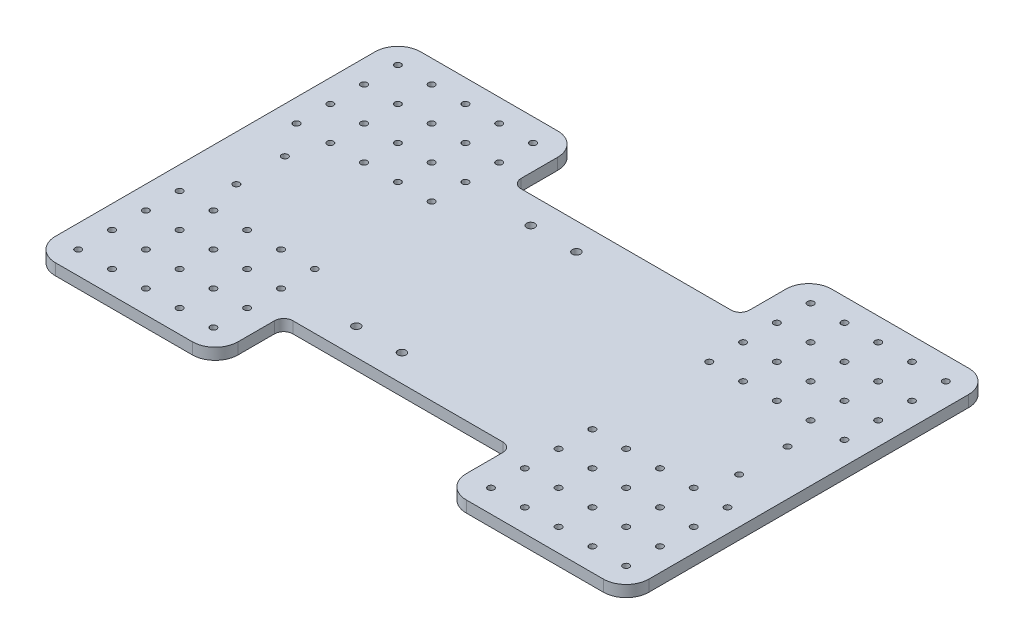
ISO-10303-21;
HEADER;
FILE_DESCRIPTION(('STEP AP214'),'2;1');
FILE_NAME('part.step','',(''),(''),'','','');
FILE_SCHEMA(('AUTOMOTIVE_DESIGN { 1 0 10303 214 1 1 1 1 }'));
ENDSEC;
DATA;
#1=APPLICATION_CONTEXT('core data for automotive mechanical design processes');
#2=APPLICATION_PROTOCOL_DEFINITION('international standard','automotive_design',2000,#1);
#3=PRODUCT_CONTEXT('',#1,'mechanical');
#4=PRODUCT('Part','Part','',(#3));
#5=PRODUCT_RELATED_PRODUCT_CATEGORY('part','',(#4));
#6=PRODUCT_DEFINITION_FORMATION('','',#4);
#7=PRODUCT_DEFINITION_CONTEXT('part definition',#1,'design');
#8=PRODUCT_DEFINITION('design','',#6,#7);
#9=PRODUCT_DEFINITION_SHAPE('','',#8);
#10=(LENGTH_UNIT() NAMED_UNIT(*) SI_UNIT(.MILLI.,.METRE.));
#11=(NAMED_UNIT(*) PLANE_ANGLE_UNIT() SI_UNIT($,.RADIAN.));
#12=(NAMED_UNIT(*) SI_UNIT($,.STERADIAN.) SOLID_ANGLE_UNIT());
#13=UNCERTAINTY_MEASURE_WITH_UNIT(LENGTH_MEASURE(1.E-05),#10,'distance_accuracy_value','');
#14=(GEOMETRIC_REPRESENTATION_CONTEXT(3) GLOBAL_UNCERTAINTY_ASSIGNED_CONTEXT((#13)) GLOBAL_UNIT_ASSIGNED_CONTEXT((#10,
#11,#12)) REPRESENTATION_CONTEXT('',''));
#15=CARTESIAN_POINT('',(0.,0.,0.));
#16=DIRECTION('',(0.,0.,1.));
#17=DIRECTION('',(1.,0.,0.));
#18=AXIS2_PLACEMENT_3D('',#15,#16,#17);
#19=CARTESIAN_POINT('',(0.,0.,0.));
#20=DIRECTION('',(0.,-1.,0.));
#21=DIRECTION('',(0.,0.,-1.));
#22=AXIS2_PLACEMENT_3D('',#19,#20,#21);
#23=PLANE('',#22);
#24=CARTESIAN_POINT('',(38.608,0.,25.654));
#25=DIRECTION('',(0.,1.,0.));
#26=DIRECTION('',(0.,0.,1.));
#27=AXIS2_PLACEMENT_3D('',#24,#25,#26);
#28=CIRCLE('',#27,0.889000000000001);
#29=CARTESIAN_POINT('',(38.608,0.,26.543));
#30=VERTEX_POINT('',#29);
#31=EDGE_CURVE('E1048',#30,#30,#28,.T.);
#32=ORIENTED_EDGE('',*,*,#31,.T.);
#33=EDGE_LOOP('',(#32));
#34=FACE_BOUND('',#33,.T.);
#35=CARTESIAN_POINT('',(38.608,0.,44.45));
#36=DIRECTION('',(0.,1.,0.));
#37=DIRECTION('',(0.,0.,1.));
#38=AXIS2_PLACEMENT_3D('',#35,#36,#37);
#39=CIRCLE('',#38,0.889000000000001);
#40=CARTESIAN_POINT('',(38.608,0.,45.339));
#41=VERTEX_POINT('',#40);
#42=EDGE_CURVE('E1036',#41,#41,#39,.T.);
#43=ORIENTED_EDGE('',*,*,#42,.T.);
#44=EDGE_LOOP('',(#43));
#45=FACE_BOUND('',#44,.T.);
#46=CARTESIAN_POINT('',(48.006,0.,25.654));
#47=DIRECTION('',(0.,1.,0.));
#48=DIRECTION('',(0.,0.,1.));
#49=AXIS2_PLACEMENT_3D('',#46,#47,#48);
#50=CIRCLE('',#49,0.889000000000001);
#51=CARTESIAN_POINT('',(48.006,0.,26.543));
#52=VERTEX_POINT('',#51);
#53=EDGE_CURVE('E1024',#52,#52,#50,.T.);
#54=ORIENTED_EDGE('',*,*,#53,.T.);
#55=EDGE_LOOP('',(#54));
#56=FACE_BOUND('',#55,.T.);
#57=CARTESIAN_POINT('',(48.006,0.,44.45));
#58=DIRECTION('',(0.,1.,0.));
#59=DIRECTION('',(0.,0.,1.));
#60=AXIS2_PLACEMENT_3D('',#57,#58,#59);
#61=CIRCLE('',#60,0.889000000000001);
#62=CARTESIAN_POINT('',(48.006,0.,45.339));
#63=VERTEX_POINT('',#62);
#64=EDGE_CURVE('E1012',#63,#63,#61,.T.);
#65=ORIENTED_EDGE('',*,*,#64,.T.);
#66=EDGE_LOOP('',(#65));
#67=FACE_BOUND('',#66,.T.);
#68=CARTESIAN_POINT('',(57.404,0.,25.654));
#69=DIRECTION('',(0.,1.,0.));
#70=DIRECTION('',(0.,0.,1.));
#71=AXIS2_PLACEMENT_3D('',#68,#69,#70);
#72=CIRCLE('',#71,0.889000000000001);
#73=CARTESIAN_POINT('',(57.404,0.,26.543));
#74=VERTEX_POINT('',#73);
#75=EDGE_CURVE('E1000',#74,#74,#72,.T.);
#76=ORIENTED_EDGE('',*,*,#75,.T.);
#77=EDGE_LOOP('',(#76));
#78=FACE_BOUND('',#77,.T.);
#79=CARTESIAN_POINT('',(57.404,0.,44.45));
#80=DIRECTION('',(0.,1.,0.));
#81=DIRECTION('',(0.,0.,1.));
#82=AXIS2_PLACEMENT_3D('',#79,#80,#81);
#83=CIRCLE('',#82,0.889000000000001);
#84=CARTESIAN_POINT('',(57.404,0.,45.339));
#85=VERTEX_POINT('',#84);
#86=EDGE_CURVE('E988',#85,#85,#83,.T.);
#87=ORIENTED_EDGE('',*,*,#86,.T.);
#88=EDGE_LOOP('',(#87));
#89=FACE_BOUND('',#88,.T.);
#90=CARTESIAN_POINT('',(66.802,0.,25.654));
#91=DIRECTION('',(0.,1.,0.));
#92=DIRECTION('',(0.,0.,1.));
#93=AXIS2_PLACEMENT_3D('',#90,#91,#92);
#94=CIRCLE('',#93,0.889000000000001);
#95=CARTESIAN_POINT('',(66.802,0.,26.543));
#96=VERTEX_POINT('',#95);
#97=EDGE_CURVE('E976',#96,#96,#94,.T.);
#98=ORIENTED_EDGE('',*,*,#97,.T.);
#99=EDGE_LOOP('',(#98));
#100=FACE_BOUND('',#99,.T.);
#101=CARTESIAN_POINT('',(66.802,0.,44.45));
#102=DIRECTION('',(0.,1.,0.));
#103=DIRECTION('',(0.,0.,1.));
#104=AXIS2_PLACEMENT_3D('',#101,#102,#103);
#105=CIRCLE('',#104,0.889000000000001);
#106=CARTESIAN_POINT('',(66.802,0.,45.339));
#107=VERTEX_POINT('',#106);
#108=EDGE_CURVE('E964',#107,#107,#105,.T.);
#109=ORIENTED_EDGE('',*,*,#108,.T.);
#110=EDGE_LOOP('',(#109));
#111=FACE_BOUND('',#110,.T.);
#112=CARTESIAN_POINT('',(76.2,0.,25.654));
#113=DIRECTION('',(0.,1.,0.));
#114=DIRECTION('',(0.,0.,1.));
#115=AXIS2_PLACEMENT_3D('',#112,#113,#114);
#116=CIRCLE('',#115,0.889000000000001);
#117=CARTESIAN_POINT('',(76.2,0.,26.543));
#118=VERTEX_POINT('',#117);
#119=EDGE_CURVE('E952',#118,#118,#116,.T.);
#120=ORIENTED_EDGE('',*,*,#119,.T.);
#121=EDGE_LOOP('',(#120));
#122=FACE_BOUND('',#121,.T.);
#123=CARTESIAN_POINT('',(76.2,0.,44.45));
#124=DIRECTION('',(0.,1.,0.));
#125=DIRECTION('',(0.,0.,1.));
#126=AXIS2_PLACEMENT_3D('',#123,#124,#125);
#127=CIRCLE('',#126,0.889000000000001);
#128=CARTESIAN_POINT('',(76.2,0.,45.339));
#129=VERTEX_POINT('',#128);
#130=EDGE_CURVE('E940',#129,#129,#127,.T.);
#131=ORIENTED_EDGE('',*,*,#130,.T.);
#132=EDGE_LOOP('',(#131));
#133=FACE_BOUND('',#132,.T.);
#134=CARTESIAN_POINT('',(38.608,0.,-25.654));
#135=DIRECTION('',(0.,1.,0.));
#136=DIRECTION('',(0.,0.,1.));
#137=AXIS2_PLACEMENT_3D('',#134,#135,#136);
#138=CIRCLE('',#137,0.889000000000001);
#139=CARTESIAN_POINT('',(38.608,0.,-24.765));
#140=VERTEX_POINT('',#139);
#141=EDGE_CURVE('E928',#140,#140,#138,.T.);
#142=ORIENTED_EDGE('',*,*,#141,.T.);
#143=EDGE_LOOP('',(#142));
#144=FACE_BOUND('',#143,.T.);
#145=CARTESIAN_POINT('',(38.608,0.,-44.45));
#146=DIRECTION('',(0.,1.,0.));
#147=DIRECTION('',(0.,0.,1.));
#148=AXIS2_PLACEMENT_3D('',#145,#146,#147);
#149=CIRCLE('',#148,0.889000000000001);
#150=CARTESIAN_POINT('',(38.608,0.,-43.561));
#151=VERTEX_POINT('',#150);
#152=EDGE_CURVE('E916',#151,#151,#149,.T.);
#153=ORIENTED_EDGE('',*,*,#152,.T.);
#154=EDGE_LOOP('',(#153));
#155=FACE_BOUND('',#154,.T.);
#156=CARTESIAN_POINT('',(48.006,0.,-25.654));
#157=DIRECTION('',(0.,1.,0.));
#158=DIRECTION('',(0.,0.,1.));
#159=AXIS2_PLACEMENT_3D('',#156,#157,#158);
#160=CIRCLE('',#159,0.889000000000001);
#161=CARTESIAN_POINT('',(48.006,0.,-24.765));
#162=VERTEX_POINT('',#161);
#163=EDGE_CURVE('E904',#162,#162,#160,.T.);
#164=ORIENTED_EDGE('',*,*,#163,.T.);
#165=EDGE_LOOP('',(#164));
#166=FACE_BOUND('',#165,.T.);
#167=CARTESIAN_POINT('',(48.006,0.,-44.45));
#168=DIRECTION('',(0.,1.,0.));
#169=DIRECTION('',(0.,0.,1.));
#170=AXIS2_PLACEMENT_3D('',#167,#168,#169);
#171=CIRCLE('',#170,0.889000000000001);
#172=CARTESIAN_POINT('',(48.006,0.,-43.561));
#173=VERTEX_POINT('',#172);
#174=EDGE_CURVE('E892',#173,#173,#171,.T.);
#175=ORIENTED_EDGE('',*,*,#174,.T.);
#176=EDGE_LOOP('',(#175));
#177=FACE_BOUND('',#176,.T.);
#178=CARTESIAN_POINT('',(57.404,0.,-25.654));
#179=DIRECTION('',(0.,1.,0.));
#180=DIRECTION('',(0.,0.,1.));
#181=AXIS2_PLACEMENT_3D('',#178,#179,#180);
#182=CIRCLE('',#181,0.889000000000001);
#183=CARTESIAN_POINT('',(57.404,0.,-24.765));
#184=VERTEX_POINT('',#183);
#185=EDGE_CURVE('E880',#184,#184,#182,.T.);
#186=ORIENTED_EDGE('',*,*,#185,.T.);
#187=EDGE_LOOP('',(#186));
#188=FACE_BOUND('',#187,.T.);
#189=CARTESIAN_POINT('',(57.404,0.,-44.45));
#190=DIRECTION('',(0.,1.,0.));
#191=DIRECTION('',(0.,0.,1.));
#192=AXIS2_PLACEMENT_3D('',#189,#190,#191);
#193=CIRCLE('',#192,0.889000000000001);
#194=CARTESIAN_POINT('',(57.404,0.,-43.561));
#195=VERTEX_POINT('',#194);
#196=EDGE_CURVE('E868',#195,#195,#193,.T.);
#197=ORIENTED_EDGE('',*,*,#196,.T.);
#198=EDGE_LOOP('',(#197));
#199=FACE_BOUND('',#198,.T.);
#200=CARTESIAN_POINT('',(66.802,0.,-25.654));
#201=DIRECTION('',(0.,1.,0.));
#202=DIRECTION('',(0.,0.,1.));
#203=AXIS2_PLACEMENT_3D('',#200,#201,#202);
#204=CIRCLE('',#203,0.889000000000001);
#205=CARTESIAN_POINT('',(66.802,0.,-24.765));
#206=VERTEX_POINT('',#205);
#207=EDGE_CURVE('E856',#206,#206,#204,.T.);
#208=ORIENTED_EDGE('',*,*,#207,.T.);
#209=EDGE_LOOP('',(#208));
#210=FACE_BOUND('',#209,.T.);
#211=CARTESIAN_POINT('',(66.802,0.,-44.45));
#212=DIRECTION('',(0.,1.,0.));
#213=DIRECTION('',(0.,0.,1.));
#214=AXIS2_PLACEMENT_3D('',#211,#212,#213);
#215=CIRCLE('',#214,0.889000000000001);
#216=CARTESIAN_POINT('',(66.802,0.,-43.561));
#217=VERTEX_POINT('',#216);
#218=EDGE_CURVE('E844',#217,#217,#215,.T.);
#219=ORIENTED_EDGE('',*,*,#218,.T.);
#220=EDGE_LOOP('',(#219));
#221=FACE_BOUND('',#220,.T.);
#222=CARTESIAN_POINT('',(76.2,0.,-25.654));
#223=DIRECTION('',(0.,1.,0.));
#224=DIRECTION('',(0.,0.,1.));
#225=AXIS2_PLACEMENT_3D('',#222,#223,#224);
#226=CIRCLE('',#225,0.889000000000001);
#227=CARTESIAN_POINT('',(76.2,0.,-24.765));
#228=VERTEX_POINT('',#227);
#229=EDGE_CURVE('E832',#228,#228,#226,.T.);
#230=ORIENTED_EDGE('',*,*,#229,.T.);
#231=EDGE_LOOP('',(#230));
#232=FACE_BOUND('',#231,.T.);
#233=CARTESIAN_POINT('',(76.2,0.,-44.45));
#234=DIRECTION('',(0.,1.,0.));
#235=DIRECTION('',(0.,0.,1.));
#236=AXIS2_PLACEMENT_3D('',#233,#234,#235);
#237=CIRCLE('',#236,0.889000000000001);
#238=CARTESIAN_POINT('',(76.2,0.,-43.561));
#239=VERTEX_POINT('',#238);
#240=EDGE_CURVE('E820',#239,#239,#237,.T.);
#241=ORIENTED_EDGE('',*,*,#240,.T.);
#242=EDGE_LOOP('',(#241));
#243=FACE_BOUND('',#242,.T.);
#244=CARTESIAN_POINT('',(69.9208067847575,0.,6.73100000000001));
#245=DIRECTION('',(0.,-1.,0.));
#246=DIRECTION('',(0.,0.,-1.));
#247=AXIS2_PLACEMENT_3D('',#244,#245,#246);
#248=CIRCLE('',#247,0.888999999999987);
#249=CARTESIAN_POINT('',(69.9208067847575,0.,5.84200000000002));
#250=VERTEX_POINT('',#249);
#251=EDGE_CURVE('E817',#250,#250,#248,.T.);
#252=ORIENTED_EDGE('',*,*,#251,.F.);
#253=EDGE_LOOP('',(#252));
#254=FACE_BOUND('',#253,.T.);
#255=CARTESIAN_POINT('',(69.9208067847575,0.,-6.73099999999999));
#256=DIRECTION('',(0.,-1.,0.));
#257=DIRECTION('',(0.,0.,-1.));
#258=AXIS2_PLACEMENT_3D('',#255,#256,#257);
#259=CIRCLE('',#258,0.888999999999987);
#260=CARTESIAN_POINT('',(69.9208067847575,0.,-7.61999999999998));
#261=VERTEX_POINT('',#260);
#262=EDGE_CURVE('E811',#261,#261,#259,.T.);
#263=ORIENTED_EDGE('',*,*,#262,.F.);
#264=EDGE_LOOP('',(#263));
#265=FACE_BOUND('',#264,.T.);
#266=CARTESIAN_POINT('',(-38.608,0.,25.654));
#267=DIRECTION('',(0.,1.,0.));
#268=DIRECTION('',(0.,0.,1.));
#269=AXIS2_PLACEMENT_3D('',#266,#267,#268);
#270=CIRCLE('',#269,0.889000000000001);
#271=CARTESIAN_POINT('',(-38.608,0.,26.543));
#272=VERTEX_POINT('',#271);
#273=EDGE_CURVE('E796',#272,#272,#270,.T.);
#274=ORIENTED_EDGE('',*,*,#273,.T.);
#275=EDGE_LOOP('',(#274));
#276=FACE_BOUND('',#275,.T.);
#277=CARTESIAN_POINT('',(-38.608,0.,44.45));
#278=DIRECTION('',(0.,1.,0.));
#279=DIRECTION('',(0.,0.,1.));
#280=AXIS2_PLACEMENT_3D('',#277,#278,#279);
#281=CIRCLE('',#280,0.889000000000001);
#282=CARTESIAN_POINT('',(-38.608,0.,45.339));
#283=VERTEX_POINT('',#282);
#284=EDGE_CURVE('E784',#283,#283,#281,.T.);
#285=ORIENTED_EDGE('',*,*,#284,.T.);
#286=EDGE_LOOP('',(#285));
#287=FACE_BOUND('',#286,.T.);
#288=CARTESIAN_POINT('',(-48.006,0.,25.654));
#289=DIRECTION('',(0.,1.,0.));
#290=DIRECTION('',(0.,0.,1.));
#291=AXIS2_PLACEMENT_3D('',#288,#289,#290);
#292=CIRCLE('',#291,0.889000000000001);
#293=CARTESIAN_POINT('',(-48.006,0.,26.543));
#294=VERTEX_POINT('',#293);
#295=EDGE_CURVE('E772',#294,#294,#292,.T.);
#296=ORIENTED_EDGE('',*,*,#295,.T.);
#297=EDGE_LOOP('',(#296));
#298=FACE_BOUND('',#297,.T.);
#299=CARTESIAN_POINT('',(-48.006,0.,44.45));
#300=DIRECTION('',(0.,1.,0.));
#301=DIRECTION('',(0.,0.,1.));
#302=AXIS2_PLACEMENT_3D('',#299,#300,#301);
#303=CIRCLE('',#302,0.889000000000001);
#304=CARTESIAN_POINT('',(-48.006,0.,45.339));
#305=VERTEX_POINT('',#304);
#306=EDGE_CURVE('E760',#305,#305,#303,.T.);
#307=ORIENTED_EDGE('',*,*,#306,.T.);
#308=EDGE_LOOP('',(#307));
#309=FACE_BOUND('',#308,.T.);
#310=CARTESIAN_POINT('',(-57.404,0.,25.654));
#311=DIRECTION('',(0.,1.,0.));
#312=DIRECTION('',(0.,0.,1.));
#313=AXIS2_PLACEMENT_3D('',#310,#311,#312);
#314=CIRCLE('',#313,0.889000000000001);
#315=CARTESIAN_POINT('',(-57.404,0.,26.543));
#316=VERTEX_POINT('',#315);
#317=EDGE_CURVE('E748',#316,#316,#314,.T.);
#318=ORIENTED_EDGE('',*,*,#317,.T.);
#319=EDGE_LOOP('',(#318));
#320=FACE_BOUND('',#319,.T.);
#321=CARTESIAN_POINT('',(-57.404,0.,44.45));
#322=DIRECTION('',(0.,1.,0.));
#323=DIRECTION('',(0.,0.,1.));
#324=AXIS2_PLACEMENT_3D('',#321,#322,#323);
#325=CIRCLE('',#324,0.889000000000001);
#326=CARTESIAN_POINT('',(-57.404,0.,45.339));
#327=VERTEX_POINT('',#326);
#328=EDGE_CURVE('E736',#327,#327,#325,.T.);
#329=ORIENTED_EDGE('',*,*,#328,.T.);
#330=EDGE_LOOP('',(#329));
#331=FACE_BOUND('',#330,.T.);
#332=CARTESIAN_POINT('',(-66.802,0.,25.654));
#333=DIRECTION('',(0.,1.,0.));
#334=DIRECTION('',(0.,0.,1.));
#335=AXIS2_PLACEMENT_3D('',#332,#333,#334);
#336=CIRCLE('',#335,0.889000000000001);
#337=CARTESIAN_POINT('',(-66.802,0.,26.543));
#338=VERTEX_POINT('',#337);
#339=EDGE_CURVE('E724',#338,#338,#336,.T.);
#340=ORIENTED_EDGE('',*,*,#339,.T.);
#341=EDGE_LOOP('',(#340));
#342=FACE_BOUND('',#341,.T.);
#343=CARTESIAN_POINT('',(-66.802,0.,44.45));
#344=DIRECTION('',(0.,1.,0.));
#345=DIRECTION('',(0.,0.,1.));
#346=AXIS2_PLACEMENT_3D('',#343,#344,#345);
#347=CIRCLE('',#346,0.889000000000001);
#348=CARTESIAN_POINT('',(-66.802,0.,45.339));
#349=VERTEX_POINT('',#348);
#350=EDGE_CURVE('E712',#349,#349,#347,.T.);
#351=ORIENTED_EDGE('',*,*,#350,.T.);
#352=EDGE_LOOP('',(#351));
#353=FACE_BOUND('',#352,.T.);
#354=CARTESIAN_POINT('',(-76.2,0.,25.654));
#355=DIRECTION('',(0.,1.,0.));
#356=DIRECTION('',(0.,0.,1.));
#357=AXIS2_PLACEMENT_3D('',#354,#355,#356);
#358=CIRCLE('',#357,0.889000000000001);
#359=CARTESIAN_POINT('',(-76.2,0.,26.543));
#360=VERTEX_POINT('',#359);
#361=EDGE_CURVE('E700',#360,#360,#358,.T.);
#362=ORIENTED_EDGE('',*,*,#361,.T.);
#363=EDGE_LOOP('',(#362));
#364=FACE_BOUND('',#363,.T.);
#365=CARTESIAN_POINT('',(-76.2,0.,44.45));
#366=DIRECTION('',(0.,1.,0.));
#367=DIRECTION('',(0.,0.,1.));
#368=AXIS2_PLACEMENT_3D('',#365,#366,#367);
#369=CIRCLE('',#368,0.889000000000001);
#370=CARTESIAN_POINT('',(-76.2,0.,45.339));
#371=VERTEX_POINT('',#370);
#372=EDGE_CURVE('E688',#371,#371,#369,.T.);
#373=ORIENTED_EDGE('',*,*,#372,.T.);
#374=EDGE_LOOP('',(#373));
#375=FACE_BOUND('',#374,.T.);
#376=CARTESIAN_POINT('',(-38.608,0.,-25.654));
#377=DIRECTION('',(0.,1.,0.));
#378=DIRECTION('',(0.,0.,1.));
#379=AXIS2_PLACEMENT_3D('',#376,#377,#378);
#380=CIRCLE('',#379,0.889000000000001);
#381=CARTESIAN_POINT('',(-38.608,0.,-24.765));
#382=VERTEX_POINT('',#381);
#383=EDGE_CURVE('E676',#382,#382,#380,.T.);
#384=ORIENTED_EDGE('',*,*,#383,.T.);
#385=EDGE_LOOP('',(#384));
#386=FACE_BOUND('',#385,.T.);
#387=CARTESIAN_POINT('',(-38.608,0.,-44.45));
#388=DIRECTION('',(0.,1.,0.));
#389=DIRECTION('',(0.,0.,1.));
#390=AXIS2_PLACEMENT_3D('',#387,#388,#389);
#391=CIRCLE('',#390,0.889000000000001);
#392=CARTESIAN_POINT('',(-38.608,0.,-43.561));
#393=VERTEX_POINT('',#392);
#394=EDGE_CURVE('E664',#393,#393,#391,.T.);
#395=ORIENTED_EDGE('',*,*,#394,.T.);
#396=EDGE_LOOP('',(#395));
#397=FACE_BOUND('',#396,.T.);
#398=CARTESIAN_POINT('',(-48.006,0.,-44.45));
#399=DIRECTION('',(0.,1.,0.));
#400=DIRECTION('',(0.,0.,1.));
#401=AXIS2_PLACEMENT_3D('',#398,#399,#400);
#402=CIRCLE('',#401,0.889000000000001);
#403=CARTESIAN_POINT('',(-48.006,0.,-43.561));
#404=VERTEX_POINT('',#403);
#405=EDGE_CURVE('E652',#404,#404,#402,.T.);
#406=ORIENTED_EDGE('',*,*,#405,.T.);
#407=EDGE_LOOP('',(#406));
#408=FACE_BOUND('',#407,.T.);
#409=CARTESIAN_POINT('',(-57.404,0.,-44.45));
#410=DIRECTION('',(0.,1.,0.));
#411=DIRECTION('',(0.,0.,1.));
#412=AXIS2_PLACEMENT_3D('',#409,#410,#411);
#413=CIRCLE('',#412,0.889000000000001);
#414=CARTESIAN_POINT('',(-57.404,0.,-43.561));
#415=VERTEX_POINT('',#414);
#416=EDGE_CURVE('E640',#415,#415,#413,.T.);
#417=ORIENTED_EDGE('',*,*,#416,.T.);
#418=EDGE_LOOP('',(#417));
#419=FACE_BOUND('',#418,.T.);
#420=CARTESIAN_POINT('',(-76.2,0.,-16.256));
#421=DIRECTION('',(0.,1.,0.));
#422=DIRECTION('',(0.,0.,1.));
#423=AXIS2_PLACEMENT_3D('',#420,#421,#422);
#424=CIRCLE('',#423,0.889000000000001);
#425=CARTESIAN_POINT('',(-76.2,0.,-15.367));
#426=VERTEX_POINT('',#425);
#427=EDGE_CURVE('E622',#426,#426,#424,.T.);
#428=ORIENTED_EDGE('',*,*,#427,.T.);
#429=EDGE_LOOP('',(#428));
#430=FACE_BOUND('',#429,.T.);
#431=CARTESIAN_POINT('',(-76.2,0.,-35.052));
#432=DIRECTION('',(0.,1.,0.));
#433=DIRECTION('',(0.,0.,1.));
#434=AXIS2_PLACEMENT_3D('',#431,#432,#433);
#435=CIRCLE('',#434,0.889000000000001);
#436=CARTESIAN_POINT('',(-76.2,0.,-34.163));
#437=VERTEX_POINT('',#436);
#438=EDGE_CURVE('E610',#437,#437,#435,.T.);
#439=ORIENTED_EDGE('',*,*,#438,.T.);
#440=EDGE_LOOP('',(#439));
#441=FACE_BOUND('',#440,.T.);
#442=CARTESIAN_POINT('',(-66.802,0.,-35.052));
#443=DIRECTION('',(0.,1.,0.));
#444=DIRECTION('',(0.,0.,1.));
#445=AXIS2_PLACEMENT_3D('',#442,#443,#444);
#446=CIRCLE('',#445,0.889000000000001);
#447=CARTESIAN_POINT('',(-66.802,0.,-34.163));
#448=VERTEX_POINT('',#447);
#449=EDGE_CURVE('E607',#448,#448,#446,.T.);
#450=ORIENTED_EDGE('',*,*,#449,.T.);
#451=EDGE_LOOP('',(#450));
#452=FACE_BOUND('',#451,.T.);
#453=CARTESIAN_POINT('',(-76.2,0.,-44.45));
#454=DIRECTION('',(0.,1.,0.));
#455=DIRECTION('',(0.,0.,1.));
#456=AXIS2_PLACEMENT_3D('',#453,#454,#455);
#457=CIRCLE('',#456,0.889000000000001);
#458=CARTESIAN_POINT('',(-76.2,0.,-43.561));
#459=VERTEX_POINT('',#458);
#460=EDGE_CURVE('E598',#459,#459,#457,.T.);
#461=ORIENTED_EDGE('',*,*,#460,.T.);
#462=EDGE_LOOP('',(#461));
#463=FACE_BOUND('',#462,.T.);
#464=CARTESIAN_POINT('',(-69.9208067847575,0.,6.73100000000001));
#465=DIRECTION('',(0.,-1.,0.));
#466=DIRECTION('',(0.,0.,-1.));
#467=AXIS2_PLACEMENT_3D('',#464,#465,#466);
#468=CIRCLE('',#467,0.888999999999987);
#469=CARTESIAN_POINT('',(-69.9208067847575,0.,5.84200000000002));
#470=VERTEX_POINT('',#469);
#471=EDGE_CURVE('E595',#470,#470,#468,.T.);
#472=ORIENTED_EDGE('',*,*,#471,.F.);
#473=EDGE_LOOP('',(#472));
#474=FACE_BOUND('',#473,.T.);
#475=CARTESIAN_POINT('',(-69.9208067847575,0.,-6.73099999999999));
#476=DIRECTION('',(0.,-1.,0.));
#477=DIRECTION('',(0.,0.,-1.));
#478=AXIS2_PLACEMENT_3D('',#475,#476,#477);
#479=CIRCLE('',#478,0.888999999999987);
#480=CARTESIAN_POINT('',(-69.9208067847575,0.,-7.61999999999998));
#481=VERTEX_POINT('',#480);
#482=EDGE_CURVE('E589',#481,#481,#479,.T.);
#483=ORIENTED_EDGE('',*,*,#482,.F.);
#484=EDGE_LOOP('',(#483));
#485=FACE_BOUND('',#484,.T.);
#486=CARTESIAN_POINT('',(-6.34999999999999,0.,-24.257));
#487=DIRECTION('',(0.,1.,0.));
#488=DIRECTION('',(0.,0.,1.));
#489=AXIS2_PLACEMENT_3D('',#486,#487,#488);
#490=CIRCLE('',#489,1.1303);
#491=CARTESIAN_POINT('',(-6.34999999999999,0.,-23.1267));
#492=VERTEX_POINT('',#491);
#493=EDGE_CURVE('E580',#492,#492,#490,.T.);
#494=ORIENTED_EDGE('',*,*,#493,.T.);
#495=EDGE_LOOP('',(#494));
#496=FACE_BOUND('',#495,.T.);
#497=CARTESIAN_POINT('',(-6.34999999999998,0.,24.257));
#498=DIRECTION('',(0.,1.,0.));
#499=DIRECTION('',(0.,0.,1.));
#500=AXIS2_PLACEMENT_3D('',#497,#498,#499);
#501=CIRCLE('',#500,1.1303);
#502=CARTESIAN_POINT('',(-6.34999999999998,0.,25.3873));
#503=VERTEX_POINT('',#502);
#504=EDGE_CURVE('E574',#503,#503,#501,.T.);
#505=ORIENTED_EDGE('',*,*,#504,.T.);
#506=EDGE_LOOP('',(#505));
#507=FACE_BOUND('',#506,.T.);
#508=CARTESIAN_POINT('',(-19.05,0.,-24.257));
#509=DIRECTION('',(0.,1.,0.));
#510=DIRECTION('',(0.,0.,1.));
#511=AXIS2_PLACEMENT_3D('',#508,#509,#510);
#512=CIRCLE('',#511,1.1303);
#513=CARTESIAN_POINT('',(-19.05,0.,-23.1267));
#514=VERTEX_POINT('',#513);
#515=EDGE_CURVE('E568',#514,#514,#512,.T.);
#516=ORIENTED_EDGE('',*,*,#515,.T.);
#517=EDGE_LOOP('',(#516));
#518=FACE_BOUND('',#517,.T.);
#519=CARTESIAN_POINT('',(-19.05,0.,24.257));
#520=DIRECTION('',(0.,1.,0.));
#521=DIRECTION('',(0.,0.,1.));
#522=AXIS2_PLACEMENT_3D('',#519,#520,#521);
#523=CIRCLE('',#522,1.1303);
#524=CARTESIAN_POINT('',(-19.05,0.,25.3873));
#525=VERTEX_POINT('',#524);
#526=EDGE_CURVE('E559',#525,#525,#523,.T.);
#527=ORIENTED_EDGE('',*,*,#526,.T.);
#528=EDGE_LOOP('',(#527));
#529=FACE_BOUND('',#528,.T.);
#530=DIRECTION('',(1.,0.,0.));
#531=VECTOR('',#530,1.);
#532=CARTESIAN_POINT('',(-82.55,0.,50.8));
#533=LINE('',#532,#531);
#534=CARTESIAN_POINT('',(38.1,0.,50.8));
#535=VERTEX_POINT('',#534);
#536=CARTESIAN_POINT('',(76.2,0.,50.8));
#537=VERTEX_POINT('',#536);
#538=EDGE_CURVE('E520',#535,#537,#533,.T.);
#539=ORIENTED_EDGE('',*,*,#538,.F.);
#540=CARTESIAN_POINT('',(38.1,0.,44.45));
#541=DIRECTION('',(0.,-1.,0.));
#542=DIRECTION('',(0.,0.,-1.));
#543=AXIS2_PLACEMENT_3D('',#540,#541,#542);
#544=CIRCLE('',#543,6.35);
#545=CARTESIAN_POINT('',(31.75,0.,44.45));
#546=VERTEX_POINT('',#545);
#547=EDGE_CURVE('E262',#535,#546,#544,.T.);
#548=ORIENTED_EDGE('',*,*,#547,.T.);
#549=DIRECTION('',(0.,0.,1.));
#550=VECTOR('',#549,1.);
#551=CARTESIAN_POINT('',(31.75,0.,31.75));
#552=LINE('',#551,#550);
#553=CARTESIAN_POINT('',(31.75,0.,34.29));
#554=VERTEX_POINT('',#553);
#555=EDGE_CURVE('E206',#554,#546,#552,.T.);
#556=ORIENTED_EDGE('',*,*,#555,.F.);
#557=CARTESIAN_POINT('',(29.21,0.,34.29));
#558=DIRECTION('',(0.,-1.,0.));
#559=DIRECTION('',(0.,0.,-1.));
#560=AXIS2_PLACEMENT_3D('',#557,#558,#559);
#561=CIRCLE('',#560,2.54);
#562=CARTESIAN_POINT('',(29.21,0.,31.75));
#563=VERTEX_POINT('',#562);
#564=EDGE_CURVE('E357',#554,#563,#561,.F.);
#565=ORIENTED_EDGE('',*,*,#564,.T.);
#566=DIRECTION('',(1.,0.,0.));
#567=VECTOR('',#566,1.);
#568=CARTESIAN_POINT('',(-31.75,0.,31.75));
#569=LINE('',#568,#567);
#570=CARTESIAN_POINT('',(-29.21,0.,31.75));
#571=VERTEX_POINT('',#570);
#572=EDGE_CURVE('E362',#571,#563,#569,.T.);
#573=ORIENTED_EDGE('',*,*,#572,.F.);
#574=CARTESIAN_POINT('',(-29.21,0.,34.29));
#575=DIRECTION('',(0.,-1.,0.));
#576=DIRECTION('',(0.,0.,-1.));
#577=AXIS2_PLACEMENT_3D('',#574,#575,#576);
#578=CIRCLE('',#577,2.54);
#579=CARTESIAN_POINT('',(-31.75,0.,34.29));
#580=VERTEX_POINT('',#579);
#581=EDGE_CURVE('E43',#571,#580,#578,.F.);
#582=ORIENTED_EDGE('',*,*,#581,.T.);
#583=DIRECTION('',(0.,0.,1.));
#584=VECTOR('',#583,1.);
#585=CARTESIAN_POINT('',(-31.75,0.,31.75));
#586=LINE('',#585,#584);
#587=CARTESIAN_POINT('',(-31.75,0.,44.45));
#588=VERTEX_POINT('',#587);
#589=EDGE_CURVE('E500',#580,#588,#586,.T.);
#590=ORIENTED_EDGE('',*,*,#589,.T.);
#591=CARTESIAN_POINT('',(-38.1,0.,44.45));
#592=DIRECTION('',(0.,-1.,0.));
#593=DIRECTION('',(0.,0.,-1.));
#594=AXIS2_PLACEMENT_3D('',#591,#592,#593);
#595=CIRCLE('',#594,6.35);
#596=CARTESIAN_POINT('',(-38.1,0.,50.8));
#597=VERTEX_POINT('',#596);
#598=EDGE_CURVE('E247',#588,#597,#595,.T.);
#599=ORIENTED_EDGE('',*,*,#598,.T.);
#600=CARTESIAN_POINT('',(-76.2,0.,50.8));
#601=VERTEX_POINT('',#600);
#602=EDGE_CURVE('E231',#601,#597,#533,.T.);
#603=ORIENTED_EDGE('',*,*,#602,.F.);
#604=CARTESIAN_POINT('',(-76.2,0.,44.45));
#605=DIRECTION('',(0.,-1.,0.));
#606=DIRECTION('',(0.,0.,-1.));
#607=AXIS2_PLACEMENT_3D('',#604,#605,#606);
#608=CIRCLE('',#607,6.35);
#609=CARTESIAN_POINT('',(-82.55,0.,44.45));
#610=VERTEX_POINT('',#609);
#611=EDGE_CURVE('E249',#601,#610,#608,.T.);
#612=ORIENTED_EDGE('',*,*,#611,.T.);
#613=DIRECTION('',(0.,0.,1.));
#614=VECTOR('',#613,1.);
#615=CARTESIAN_POINT('',(-82.55,0.,50.8));
#616=LINE('',#615,#614);
#617=CARTESIAN_POINT('',(-82.55,0.,-44.45));
#618=VERTEX_POINT('',#617);
#619=EDGE_CURVE('E518',#618,#610,#616,.T.);
#620=ORIENTED_EDGE('',*,*,#619,.F.);
#621=CARTESIAN_POINT('',(-76.2,0.,-44.45));
#622=DIRECTION('',(0.,-1.,0.));
#623=DIRECTION('',(0.,0.,-1.));
#624=AXIS2_PLACEMENT_3D('',#621,#622,#623);
#625=CIRCLE('',#624,6.35);
#626=CARTESIAN_POINT('',(-76.2,0.,-50.8));
#627=VERTEX_POINT('',#626);
#628=EDGE_CURVE('E254',#618,#627,#625,.T.);
#629=ORIENTED_EDGE('',*,*,#628,.T.);
#630=DIRECTION('',(-1.,0.,0.));
#631=VECTOR('',#630,1.);
#632=CARTESIAN_POINT('',(-82.55,0.,-50.8));
#633=LINE('',#632,#631);
#634=CARTESIAN_POINT('',(-38.1,0.,-50.8));
#635=VERTEX_POINT('',#634);
#636=EDGE_CURVE('E515',#635,#627,#633,.T.);
#637=ORIENTED_EDGE('',*,*,#636,.F.);
#638=CARTESIAN_POINT('',(-38.1,0.,-44.45));
#639=DIRECTION('',(0.,-1.,0.));
#640=DIRECTION('',(0.,0.,-1.));
#641=AXIS2_PLACEMENT_3D('',#638,#639,#640);
#642=CIRCLE('',#641,6.35);
#643=CARTESIAN_POINT('',(-31.75,0.,-44.45));
#644=VERTEX_POINT('',#643);
#645=EDGE_CURVE('E251',#635,#644,#642,.T.);
#646=ORIENTED_EDGE('',*,*,#645,.T.);
#647=DIRECTION('',(0.,0.,-1.));
#648=VECTOR('',#647,1.);
#649=CARTESIAN_POINT('',(-31.75,0.,-31.75));
#650=LINE('',#649,#648);
#651=CARTESIAN_POINT('',(-31.75,0.,-34.29));
#652=VERTEX_POINT('',#651);
#653=EDGE_CURVE('E490',#652,#644,#650,.T.);
#654=ORIENTED_EDGE('',*,*,#653,.F.);
#655=CARTESIAN_POINT('',(-29.21,0.,-34.29));
#656=DIRECTION('',(0.,-1.,0.));
#657=DIRECTION('',(0.,0.,-1.));
#658=AXIS2_PLACEMENT_3D('',#655,#656,#657);
#659=CIRCLE('',#658,2.54);
#660=CARTESIAN_POINT('',(-29.21,0.,-31.75));
#661=VERTEX_POINT('',#660);
#662=EDGE_CURVE('E352',#652,#661,#659,.F.);
#663=ORIENTED_EDGE('',*,*,#662,.T.);
#664=DIRECTION('',(1.,0.,0.));
#665=VECTOR('',#664,1.);
#666=CARTESIAN_POINT('',(-31.75,0.,-31.75));
#667=LINE('',#666,#665);
#668=CARTESIAN_POINT('',(29.21,0.,-31.75));
#669=VERTEX_POINT('',#668);
#670=EDGE_CURVE('E484',#661,#669,#667,.T.);
#671=ORIENTED_EDGE('',*,*,#670,.T.);
#672=CARTESIAN_POINT('',(29.21,0.,-34.29));
#673=DIRECTION('',(0.,-1.,0.));
#674=DIRECTION('',(0.,0.,-1.));
#675=AXIS2_PLACEMENT_3D('',#672,#673,#674);
#676=CIRCLE('',#675,2.54);
#677=CARTESIAN_POINT('',(31.75,0.,-34.29));
#678=VERTEX_POINT('',#677);
#679=EDGE_CURVE('E350',#669,#678,#676,.F.);
#680=ORIENTED_EDGE('',*,*,#679,.T.);
#681=DIRECTION('',(0.,0.,-1.));
#682=VECTOR('',#681,1.);
#683=CARTESIAN_POINT('',(31.75,0.,-31.75));
#684=LINE('',#683,#682);
#685=CARTESIAN_POINT('',(31.75,0.,-44.45));
#686=VERTEX_POINT('',#685);
#687=EDGE_CURVE('E482',#678,#686,#684,.T.);
#688=ORIENTED_EDGE('',*,*,#687,.T.);
#689=CARTESIAN_POINT('',(38.1,0.,-44.45));
#690=DIRECTION('',(0.,-1.,0.));
#691=DIRECTION('',(0.,0.,-1.));
#692=AXIS2_PLACEMENT_3D('',#689,#690,#691);
#693=CIRCLE('',#692,6.35);
#694=CARTESIAN_POINT('',(38.1,0.,-50.8));
#695=VERTEX_POINT('',#694);
#696=EDGE_CURVE('E256',#686,#695,#693,.T.);
#697=ORIENTED_EDGE('',*,*,#696,.T.);
#698=CARTESIAN_POINT('',(76.2,0.,-50.8));
#699=VERTEX_POINT('',#698);
#700=EDGE_CURVE('E516',#699,#695,#633,.T.);
#701=ORIENTED_EDGE('',*,*,#700,.F.);
#702=CARTESIAN_POINT('',(76.2,0.,-44.45));
#703=DIRECTION('',(0.,-1.,0.));
#704=DIRECTION('',(0.,0.,-1.));
#705=AXIS2_PLACEMENT_3D('',#702,#703,#704);
#706=CIRCLE('',#705,6.35);
#707=CARTESIAN_POINT('',(82.55,0.,-44.45));
#708=VERTEX_POINT('',#707);
#709=EDGE_CURVE('E258',#699,#708,#706,.T.);
#710=ORIENTED_EDGE('',*,*,#709,.T.);
#711=DIRECTION('',(0.,0.,-1.));
#712=VECTOR('',#711,1.);
#713=CARTESIAN_POINT('',(82.55,0.,50.8));
#714=LINE('',#713,#712);
#715=CARTESIAN_POINT('',(82.55,0.,44.45));
#716=VERTEX_POINT('',#715);
#717=EDGE_CURVE('E205',#716,#708,#714,.T.);
#718=ORIENTED_EDGE('',*,*,#717,.F.);
#719=CARTESIAN_POINT('',(76.2,0.,44.45));
#720=DIRECTION('',(0.,-1.,0.));
#721=DIRECTION('',(0.,0.,-1.));
#722=AXIS2_PLACEMENT_3D('',#719,#720,#721);
#723=CIRCLE('',#722,6.35);
#724=EDGE_CURVE('E260',#716,#537,#723,.T.);
#725=ORIENTED_EDGE('',*,*,#724,.T.);
#726=EDGE_LOOP('',(#539,#548,#556,#565,#573,#582,#590,#599,#603,#612,#620,#629,#637,#646,#654,
#663,#671,#680,#688,#697,#701,#710,#718,#725));
#727=FACE_BOUND('',#726,.T.);
#728=CARTESIAN_POINT('',(-57.404,0.,-35.052));
#729=DIRECTION('',(0.,1.,0.));
#730=DIRECTION('',(0.,0.,1.));
#731=AXIS2_PLACEMENT_3D('',#728,#729,#730);
#732=CIRCLE('',#731,0.889000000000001);
#733=CARTESIAN_POINT('',(-57.404,0.,-34.163));
#734=VERTEX_POINT('',#733);
#735=EDGE_CURVE('E299',#734,#734,#732,.T.);
#736=ORIENTED_EDGE('',*,*,#735,.T.);
#737=EDGE_LOOP('',(#736));
#738=FACE_BOUND('',#737,.T.);
#739=CARTESIAN_POINT('',(-48.006,0.,-35.052));
#740=DIRECTION('',(0.,1.,0.));
#741=DIRECTION('',(0.,0.,1.));
#742=AXIS2_PLACEMENT_3D('',#739,#740,#741);
#743=CIRCLE('',#742,0.889000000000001);
#744=CARTESIAN_POINT('',(-48.006,0.,-34.163));
#745=VERTEX_POINT('',#744);
#746=EDGE_CURVE('E305',#745,#745,#743,.T.);
#747=ORIENTED_EDGE('',*,*,#746,.T.);
#748=EDGE_LOOP('',(#747));
#749=FACE_BOUND('',#748,.T.);
#750=CARTESIAN_POINT('',(-66.802,0.,-25.654));
#751=DIRECTION('',(0.,1.,0.));
#752=DIRECTION('',(0.,0.,1.));
#753=AXIS2_PLACEMENT_3D('',#750,#751,#752);
#754=CIRCLE('',#753,0.889000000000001);
#755=CARTESIAN_POINT('',(-66.802,0.,-24.765));
#756=VERTEX_POINT('',#755);
#757=EDGE_CURVE('E311',#756,#756,#754,.T.);
#758=ORIENTED_EDGE('',*,*,#757,.T.);
#759=EDGE_LOOP('',(#758));
#760=FACE_BOUND('',#759,.T.);
#761=CARTESIAN_POINT('',(-57.404,0.,-25.654));
#762=DIRECTION('',(0.,1.,0.));
#763=DIRECTION('',(0.,0.,1.));
#764=AXIS2_PLACEMENT_3D('',#761,#762,#763);
#765=CIRCLE('',#764,0.889000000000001);
#766=CARTESIAN_POINT('',(-57.404,0.,-24.765));
#767=VERTEX_POINT('',#766);
#768=EDGE_CURVE('E317',#767,#767,#765,.T.);
#769=ORIENTED_EDGE('',*,*,#768,.T.);
#770=EDGE_LOOP('',(#769));
#771=FACE_BOUND('',#770,.T.);
#772=CARTESIAN_POINT('',(-48.006,0.,-25.654));
#773=DIRECTION('',(0.,1.,0.));
#774=DIRECTION('',(0.,0.,1.));
#775=AXIS2_PLACEMENT_3D('',#772,#773,#774);
#776=CIRCLE('',#775,0.889000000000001);
#777=CARTESIAN_POINT('',(-48.006,0.,-24.765));
#778=VERTEX_POINT('',#777);
#779=EDGE_CURVE('E323',#778,#778,#776,.T.);
#780=ORIENTED_EDGE('',*,*,#779,.T.);
#781=EDGE_LOOP('',(#780));
#782=FACE_BOUND('',#781,.T.);
#783=CARTESIAN_POINT('',(-76.2,0.,-25.654));
#784=DIRECTION('',(0.,1.,0.));
#785=DIRECTION('',(0.,0.,1.));
#786=AXIS2_PLACEMENT_3D('',#783,#784,#785);
#787=CIRCLE('',#786,0.889000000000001);
#788=CARTESIAN_POINT('',(-76.2,0.,-24.765));
#789=VERTEX_POINT('',#788);
#790=EDGE_CURVE('E616',#789,#789,#787,.T.);
#791=ORIENTED_EDGE('',*,*,#790,.T.);
#792=EDGE_LOOP('',(#791));
#793=FACE_BOUND('',#792,.T.);
#794=CARTESIAN_POINT('',(-66.802,0.,-44.45));
#795=DIRECTION('',(0.,1.,0.));
#796=DIRECTION('',(0.,0.,1.));
#797=AXIS2_PLACEMENT_3D('',#794,#795,#796);
#798=CIRCLE('',#797,0.889000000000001);
#799=CARTESIAN_POINT('',(-66.802,0.,-43.561));
#800=VERTEX_POINT('',#799);
#801=EDGE_CURVE('E628',#800,#800,#798,.T.);
#802=ORIENTED_EDGE('',*,*,#801,.T.);
#803=EDGE_LOOP('',(#802));
#804=FACE_BOUND('',#803,.T.);
#805=CARTESIAN_POINT('',(-66.802,0.,-16.256));
#806=DIRECTION('',(0.,1.,0.));
#807=DIRECTION('',(0.,0.,1.));
#808=AXIS2_PLACEMENT_3D('',#805,#806,#807);
#809=CIRCLE('',#808,0.889000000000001);
#810=CARTESIAN_POINT('',(-66.802,0.,-15.367));
#811=VERTEX_POINT('',#810);
#812=EDGE_CURVE('E634',#811,#811,#809,.T.);
#813=ORIENTED_EDGE('',*,*,#812,.T.);
#814=EDGE_LOOP('',(#813));
#815=FACE_BOUND('',#814,.T.);
#816=CARTESIAN_POINT('',(-57.404,0.,-16.256));
#817=DIRECTION('',(0.,1.,0.));
#818=DIRECTION('',(0.,0.,1.));
#819=AXIS2_PLACEMENT_3D('',#816,#817,#818);
#820=CIRCLE('',#819,0.889000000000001);
#821=CARTESIAN_POINT('',(-57.404,0.,-15.367));
#822=VERTEX_POINT('',#821);
#823=EDGE_CURVE('E646',#822,#822,#820,.T.);
#824=ORIENTED_EDGE('',*,*,#823,.T.);
#825=EDGE_LOOP('',(#824));
#826=FACE_BOUND('',#825,.T.);
#827=CARTESIAN_POINT('',(-48.006,0.,-16.256));
#828=DIRECTION('',(0.,1.,0.));
#829=DIRECTION('',(0.,0.,1.));
#830=AXIS2_PLACEMENT_3D('',#827,#828,#829);
#831=CIRCLE('',#830,0.889000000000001);
#832=CARTESIAN_POINT('',(-48.006,0.,-15.367));
#833=VERTEX_POINT('',#832);
#834=EDGE_CURVE('E658',#833,#833,#831,.T.);
#835=ORIENTED_EDGE('',*,*,#834,.T.);
#836=EDGE_LOOP('',(#835));
#837=FACE_BOUND('',#836,.T.);
#838=CARTESIAN_POINT('',(-38.608,0.,-35.052));
#839=DIRECTION('',(0.,1.,0.));
#840=DIRECTION('',(0.,0.,1.));
#841=AXIS2_PLACEMENT_3D('',#838,#839,#840);
#842=CIRCLE('',#841,0.889000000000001);
#843=CARTESIAN_POINT('',(-38.608,0.,-34.163));
#844=VERTEX_POINT('',#843);
#845=EDGE_CURVE('E670',#844,#844,#842,.T.);
#846=ORIENTED_EDGE('',*,*,#845,.T.);
#847=EDGE_LOOP('',(#846));
#848=FACE_BOUND('',#847,.T.);
#849=CARTESIAN_POINT('',(-38.608,0.,-16.256));
#850=DIRECTION('',(0.,1.,0.));
#851=DIRECTION('',(0.,0.,1.));
#852=AXIS2_PLACEMENT_3D('',#849,#850,#851);
#853=CIRCLE('',#852,0.889000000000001);
#854=CARTESIAN_POINT('',(-38.608,0.,-15.367));
#855=VERTEX_POINT('',#854);
#856=EDGE_CURVE('E682',#855,#855,#853,.T.);
#857=ORIENTED_EDGE('',*,*,#856,.T.);
#858=EDGE_LOOP('',(#857));
#859=FACE_BOUND('',#858,.T.);
#860=CARTESIAN_POINT('',(-76.2,0.,35.052));
#861=DIRECTION('',(0.,1.,0.));
#862=DIRECTION('',(0.,0.,1.));
#863=AXIS2_PLACEMENT_3D('',#860,#861,#862);
#864=CIRCLE('',#863,0.889000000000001);
#865=CARTESIAN_POINT('',(-76.2,0.,35.941));
#866=VERTEX_POINT('',#865);
#867=EDGE_CURVE('E694',#866,#866,#864,.T.);
#868=ORIENTED_EDGE('',*,*,#867,.T.);
#869=EDGE_LOOP('',(#868));
#870=FACE_BOUND('',#869,.T.);
#871=CARTESIAN_POINT('',(-76.2,0.,16.256));
#872=DIRECTION('',(0.,1.,0.));
#873=DIRECTION('',(0.,0.,1.));
#874=AXIS2_PLACEMENT_3D('',#871,#872,#873);
#875=CIRCLE('',#874,0.889000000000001);
#876=CARTESIAN_POINT('',(-76.2,0.,17.145));
#877=VERTEX_POINT('',#876);
#878=EDGE_CURVE('E706',#877,#877,#875,.T.);
#879=ORIENTED_EDGE('',*,*,#878,.T.);
#880=EDGE_LOOP('',(#879));
#881=FACE_BOUND('',#880,.T.);
#882=CARTESIAN_POINT('',(-66.802,0.,35.052));
#883=DIRECTION('',(0.,1.,0.));
#884=DIRECTION('',(0.,0.,1.));
#885=AXIS2_PLACEMENT_3D('',#882,#883,#884);
#886=CIRCLE('',#885,0.889000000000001);
#887=CARTESIAN_POINT('',(-66.802,0.,35.941));
#888=VERTEX_POINT('',#887);
#889=EDGE_CURVE('E718',#888,#888,#886,.T.);
#890=ORIENTED_EDGE('',*,*,#889,.T.);
#891=EDGE_LOOP('',(#890));
#892=FACE_BOUND('',#891,.T.);
#893=CARTESIAN_POINT('',(-66.802,0.,16.256));
#894=DIRECTION('',(0.,1.,0.));
#895=DIRECTION('',(0.,0.,1.));
#896=AXIS2_PLACEMENT_3D('',#893,#894,#895);
#897=CIRCLE('',#896,0.889000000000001);
#898=CARTESIAN_POINT('',(-66.802,0.,17.145));
#899=VERTEX_POINT('',#898);
#900=EDGE_CURVE('E730',#899,#899,#897,.T.);
#901=ORIENTED_EDGE('',*,*,#900,.T.);
#902=EDGE_LOOP('',(#901));
#903=FACE_BOUND('',#902,.T.);
#904=CARTESIAN_POINT('',(-57.404,0.,35.052));
#905=DIRECTION('',(0.,1.,0.));
#906=DIRECTION('',(0.,0.,1.));
#907=AXIS2_PLACEMENT_3D('',#904,#905,#906);
#908=CIRCLE('',#907,0.889000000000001);
#909=CARTESIAN_POINT('',(-57.404,0.,35.941));
#910=VERTEX_POINT('',#909);
#911=EDGE_CURVE('E742',#910,#910,#908,.T.);
#912=ORIENTED_EDGE('',*,*,#911,.T.);
#913=EDGE_LOOP('',(#912));
#914=FACE_BOUND('',#913,.T.);
#915=CARTESIAN_POINT('',(-57.404,0.,16.256));
#916=DIRECTION('',(0.,1.,0.));
#917=DIRECTION('',(0.,0.,1.));
#918=AXIS2_PLACEMENT_3D('',#915,#916,#917);
#919=CIRCLE('',#918,0.889000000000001);
#920=CARTESIAN_POINT('',(-57.404,0.,17.145));
#921=VERTEX_POINT('',#920);
#922=EDGE_CURVE('E754',#921,#921,#919,.T.);
#923=ORIENTED_EDGE('',*,*,#922,.T.);
#924=EDGE_LOOP('',(#923));
#925=FACE_BOUND('',#924,.T.);
#926=CARTESIAN_POINT('',(-48.006,0.,35.052));
#927=DIRECTION('',(0.,1.,0.));
#928=DIRECTION('',(0.,0.,1.));
#929=AXIS2_PLACEMENT_3D('',#926,#927,#928);
#930=CIRCLE('',#929,0.889000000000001);
#931=CARTESIAN_POINT('',(-48.006,0.,35.941));
#932=VERTEX_POINT('',#931);
#933=EDGE_CURVE('E766',#932,#932,#930,.T.);
#934=ORIENTED_EDGE('',*,*,#933,.T.);
#935=EDGE_LOOP('',(#934));
#936=FACE_BOUND('',#935,.T.);
#937=CARTESIAN_POINT('',(-48.006,0.,16.256));
#938=DIRECTION('',(0.,1.,0.));
#939=DIRECTION('',(0.,0.,1.));
#940=AXIS2_PLACEMENT_3D('',#937,#938,#939);
#941=CIRCLE('',#940,0.889000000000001);
#942=CARTESIAN_POINT('',(-48.006,0.,17.145));
#943=VERTEX_POINT('',#942);
#944=EDGE_CURVE('E778',#943,#943,#941,.T.);
#945=ORIENTED_EDGE('',*,*,#944,.T.);
#946=EDGE_LOOP('',(#945));
#947=FACE_BOUND('',#946,.T.);
#948=CARTESIAN_POINT('',(-38.608,0.,35.052));
#949=DIRECTION('',(0.,1.,0.));
#950=DIRECTION('',(0.,0.,1.));
#951=AXIS2_PLACEMENT_3D('',#948,#949,#950);
#952=CIRCLE('',#951,0.889000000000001);
#953=CARTESIAN_POINT('',(-38.608,0.,35.941));
#954=VERTEX_POINT('',#953);
#955=EDGE_CURVE('E790',#954,#954,#952,.T.);
#956=ORIENTED_EDGE('',*,*,#955,.T.);
#957=EDGE_LOOP('',(#956));
#958=FACE_BOUND('',#957,.T.);
#959=CARTESIAN_POINT('',(-38.608,0.,16.256));
#960=DIRECTION('',(0.,1.,0.));
#961=DIRECTION('',(0.,0.,1.));
#962=AXIS2_PLACEMENT_3D('',#959,#960,#961);
#963=CIRCLE('',#962,0.889000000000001);
#964=CARTESIAN_POINT('',(-38.608,0.,17.145));
#965=VERTEX_POINT('',#964);
#966=EDGE_CURVE('E802',#965,#965,#963,.T.);
#967=ORIENTED_EDGE('',*,*,#966,.T.);
#968=EDGE_LOOP('',(#967));
#969=FACE_BOUND('',#968,.T.);
#970=CARTESIAN_POINT('',(76.2,0.,-35.052));
#971=DIRECTION('',(0.,1.,0.));
#972=DIRECTION('',(0.,0.,1.));
#973=AXIS2_PLACEMENT_3D('',#970,#971,#972);
#974=CIRCLE('',#973,0.889000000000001);
#975=CARTESIAN_POINT('',(76.2,0.,-34.163));
#976=VERTEX_POINT('',#975);
#977=EDGE_CURVE('E826',#976,#976,#974,.T.);
#978=ORIENTED_EDGE('',*,*,#977,.T.);
#979=EDGE_LOOP('',(#978));
#980=FACE_BOUND('',#979,.T.);
#981=CARTESIAN_POINT('',(76.2,0.,-16.256));
#982=DIRECTION('',(0.,1.,0.));
#983=DIRECTION('',(0.,0.,1.));
#984=AXIS2_PLACEMENT_3D('',#981,#982,#983);
#985=CIRCLE('',#984,0.889000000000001);
#986=CARTESIAN_POINT('',(76.2,0.,-15.367));
#987=VERTEX_POINT('',#986);
#988=EDGE_CURVE('E838',#987,#987,#985,.T.);
#989=ORIENTED_EDGE('',*,*,#988,.T.);
#990=EDGE_LOOP('',(#989));
#991=FACE_BOUND('',#990,.T.);
#992=CARTESIAN_POINT('',(66.802,0.,-35.052));
#993=DIRECTION('',(0.,1.,0.));
#994=DIRECTION('',(0.,0.,1.));
#995=AXIS2_PLACEMENT_3D('',#992,#993,#994);
#996=CIRCLE('',#995,0.889000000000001);
#997=CARTESIAN_POINT('',(66.802,0.,-34.163));
#998=VERTEX_POINT('',#997);
#999=EDGE_CURVE('E850',#998,#998,#996,.T.);
#1000=ORIENTED_EDGE('',*,*,#999,.T.);
#1001=EDGE_LOOP('',(#1000));
#1002=FACE_BOUND('',#1001,.T.);
#1003=CARTESIAN_POINT('',(66.802,0.,-16.256));
#1004=DIRECTION('',(0.,1.,0.));
#1005=DIRECTION('',(0.,0.,1.));
#1006=AXIS2_PLACEMENT_3D('',#1003,#1004,#1005);
#1007=CIRCLE('',#1006,0.889000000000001);
#1008=CARTESIAN_POINT('',(66.802,0.,-15.367));
#1009=VERTEX_POINT('',#1008);
#1010=EDGE_CURVE('E862',#1009,#1009,#1007,.T.);
#1011=ORIENTED_EDGE('',*,*,#1010,.T.);
#1012=EDGE_LOOP('',(#1011));
#1013=FACE_BOUND('',#1012,.T.);
#1014=CARTESIAN_POINT('',(57.404,0.,-35.052));
#1015=DIRECTION('',(0.,1.,0.));
#1016=DIRECTION('',(0.,0.,1.));
#1017=AXIS2_PLACEMENT_3D('',#1014,#1015,#1016);
#1018=CIRCLE('',#1017,0.889000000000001);
#1019=CARTESIAN_POINT('',(57.404,0.,-34.163));
#1020=VERTEX_POINT('',#1019);
#1021=EDGE_CURVE('E874',#1020,#1020,#1018,.T.);
#1022=ORIENTED_EDGE('',*,*,#1021,.T.);
#1023=EDGE_LOOP('',(#1022));
#1024=FACE_BOUND('',#1023,.T.);
#1025=CARTESIAN_POINT('',(57.404,0.,-16.256));
#1026=DIRECTION('',(0.,1.,0.));
#1027=DIRECTION('',(0.,0.,1.));
#1028=AXIS2_PLACEMENT_3D('',#1025,#1026,#1027);
#1029=CIRCLE('',#1028,0.889000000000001);
#1030=CARTESIAN_POINT('',(57.404,0.,-15.367));
#1031=VERTEX_POINT('',#1030);
#1032=EDGE_CURVE('E886',#1031,#1031,#1029,.T.);
#1033=ORIENTED_EDGE('',*,*,#1032,.T.);
#1034=EDGE_LOOP('',(#1033));
#1035=FACE_BOUND('',#1034,.T.);
#1036=CARTESIAN_POINT('',(48.006,0.,-35.052));
#1037=DIRECTION('',(0.,1.,0.));
#1038=DIRECTION('',(0.,0.,1.));
#1039=AXIS2_PLACEMENT_3D('',#1036,#1037,#1038);
#1040=CIRCLE('',#1039,0.889000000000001);
#1041=CARTESIAN_POINT('',(48.006,0.,-34.163));
#1042=VERTEX_POINT('',#1041);
#1043=EDGE_CURVE('E898',#1042,#1042,#1040,.T.);
#1044=ORIENTED_EDGE('',*,*,#1043,.T.);
#1045=EDGE_LOOP('',(#1044));
#1046=FACE_BOUND('',#1045,.T.);
#1047=CARTESIAN_POINT('',(48.006,0.,-16.256));
#1048=DIRECTION('',(0.,1.,0.));
#1049=DIRECTION('',(0.,0.,1.));
#1050=AXIS2_PLACEMENT_3D('',#1047,#1048,#1049);
#1051=CIRCLE('',#1050,0.889000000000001);
#1052=CARTESIAN_POINT('',(48.006,0.,-15.367));
#1053=VERTEX_POINT('',#1052);
#1054=EDGE_CURVE('E910',#1053,#1053,#1051,.T.);
#1055=ORIENTED_EDGE('',*,*,#1054,.T.);
#1056=EDGE_LOOP('',(#1055));
#1057=FACE_BOUND('',#1056,.T.);
#1058=CARTESIAN_POINT('',(38.608,0.,-35.052));
#1059=DIRECTION('',(0.,1.,0.));
#1060=DIRECTION('',(0.,0.,1.));
#1061=AXIS2_PLACEMENT_3D('',#1058,#1059,#1060);
#1062=CIRCLE('',#1061,0.889000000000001);
#1063=CARTESIAN_POINT('',(38.608,0.,-34.163));
#1064=VERTEX_POINT('',#1063);
#1065=EDGE_CURVE('E922',#1064,#1064,#1062,.T.);
#1066=ORIENTED_EDGE('',*,*,#1065,.T.);
#1067=EDGE_LOOP('',(#1066));
#1068=FACE_BOUND('',#1067,.T.);
#1069=CARTESIAN_POINT('',(38.608,0.,-16.256));
#1070=DIRECTION('',(0.,1.,0.));
#1071=DIRECTION('',(0.,0.,1.));
#1072=AXIS2_PLACEMENT_3D('',#1069,#1070,#1071);
#1073=CIRCLE('',#1072,0.889000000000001);
#1074=CARTESIAN_POINT('',(38.608,0.,-15.367));
#1075=VERTEX_POINT('',#1074);
#1076=EDGE_CURVE('E934',#1075,#1075,#1073,.T.);
#1077=ORIENTED_EDGE('',*,*,#1076,.T.);
#1078=EDGE_LOOP('',(#1077));
#1079=FACE_BOUND('',#1078,.T.);
#1080=CARTESIAN_POINT('',(76.2,0.,35.052));
#1081=DIRECTION('',(0.,1.,0.));
#1082=DIRECTION('',(0.,0.,1.));
#1083=AXIS2_PLACEMENT_3D('',#1080,#1081,#1082);
#1084=CIRCLE('',#1083,0.889000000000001);
#1085=CARTESIAN_POINT('',(76.2,0.,35.941));
#1086=VERTEX_POINT('',#1085);
#1087=EDGE_CURVE('E946',#1086,#1086,#1084,.T.);
#1088=ORIENTED_EDGE('',*,*,#1087,.T.);
#1089=EDGE_LOOP('',(#1088));
#1090=FACE_BOUND('',#1089,.T.);
#1091=CARTESIAN_POINT('',(76.2,0.,16.256));
#1092=DIRECTION('',(0.,1.,0.));
#1093=DIRECTION('',(0.,0.,1.));
#1094=AXIS2_PLACEMENT_3D('',#1091,#1092,#1093);
#1095=CIRCLE('',#1094,0.889000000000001);
#1096=CARTESIAN_POINT('',(76.2,0.,17.145));
#1097=VERTEX_POINT('',#1096);
#1098=EDGE_CURVE('E958',#1097,#1097,#1095,.T.);
#1099=ORIENTED_EDGE('',*,*,#1098,.T.);
#1100=EDGE_LOOP('',(#1099));
#1101=FACE_BOUND('',#1100,.T.);
#1102=CARTESIAN_POINT('',(66.802,0.,35.052));
#1103=DIRECTION('',(0.,1.,0.));
#1104=DIRECTION('',(0.,0.,1.));
#1105=AXIS2_PLACEMENT_3D('',#1102,#1103,#1104);
#1106=CIRCLE('',#1105,0.889000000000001);
#1107=CARTESIAN_POINT('',(66.802,0.,35.941));
#1108=VERTEX_POINT('',#1107);
#1109=EDGE_CURVE('E970',#1108,#1108,#1106,.T.);
#1110=ORIENTED_EDGE('',*,*,#1109,.T.);
#1111=EDGE_LOOP('',(#1110));
#1112=FACE_BOUND('',#1111,.T.);
#1113=CARTESIAN_POINT('',(66.802,0.,16.256));
#1114=DIRECTION('',(0.,1.,0.));
#1115=DIRECTION('',(0.,0.,1.));
#1116=AXIS2_PLACEMENT_3D('',#1113,#1114,#1115);
#1117=CIRCLE('',#1116,0.889000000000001);
#1118=CARTESIAN_POINT('',(66.802,0.,17.145));
#1119=VERTEX_POINT('',#1118);
#1120=EDGE_CURVE('E982',#1119,#1119,#1117,.T.);
#1121=ORIENTED_EDGE('',*,*,#1120,.T.);
#1122=EDGE_LOOP('',(#1121));
#1123=FACE_BOUND('',#1122,.T.);
#1124=CARTESIAN_POINT('',(57.404,0.,35.052));
#1125=DIRECTION('',(0.,1.,0.));
#1126=DIRECTION('',(0.,0.,1.));
#1127=AXIS2_PLACEMENT_3D('',#1124,#1125,#1126);
#1128=CIRCLE('',#1127,0.889000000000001);
#1129=CARTESIAN_POINT('',(57.404,0.,35.941));
#1130=VERTEX_POINT('',#1129);
#1131=EDGE_CURVE('E994',#1130,#1130,#1128,.T.);
#1132=ORIENTED_EDGE('',*,*,#1131,.T.);
#1133=EDGE_LOOP('',(#1132));
#1134=FACE_BOUND('',#1133,.T.);
#1135=CARTESIAN_POINT('',(57.404,0.,16.256));
#1136=DIRECTION('',(0.,1.,0.));
#1137=DIRECTION('',(0.,0.,1.));
#1138=AXIS2_PLACEMENT_3D('',#1135,#1136,#1137);
#1139=CIRCLE('',#1138,0.889000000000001);
#1140=CARTESIAN_POINT('',(57.404,0.,17.145));
#1141=VERTEX_POINT('',#1140);
#1142=EDGE_CURVE('E1006',#1141,#1141,#1139,.T.);
#1143=ORIENTED_EDGE('',*,*,#1142,.T.);
#1144=EDGE_LOOP('',(#1143));
#1145=FACE_BOUND('',#1144,.T.);
#1146=CARTESIAN_POINT('',(48.006,0.,35.052));
#1147=DIRECTION('',(0.,1.,0.));
#1148=DIRECTION('',(0.,0.,1.));
#1149=AXIS2_PLACEMENT_3D('',#1146,#1147,#1148);
#1150=CIRCLE('',#1149,0.889000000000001);
#1151=CARTESIAN_POINT('',(48.006,0.,35.941));
#1152=VERTEX_POINT('',#1151);
#1153=EDGE_CURVE('E1018',#1152,#1152,#1150,.T.);
#1154=ORIENTED_EDGE('',*,*,#1153,.T.);
#1155=EDGE_LOOP('',(#1154));
#1156=FACE_BOUND('',#1155,.T.);
#1157=CARTESIAN_POINT('',(48.006,0.,16.256));
#1158=DIRECTION('',(0.,1.,0.));
#1159=DIRECTION('',(0.,0.,1.));
#1160=AXIS2_PLACEMENT_3D('',#1157,#1158,#1159);
#1161=CIRCLE('',#1160,0.889000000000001);
#1162=CARTESIAN_POINT('',(48.006,0.,17.145));
#1163=VERTEX_POINT('',#1162);
#1164=EDGE_CURVE('E1030',#1163,#1163,#1161,.T.);
#1165=ORIENTED_EDGE('',*,*,#1164,.T.);
#1166=EDGE_LOOP('',(#1165));
#1167=FACE_BOUND('',#1166,.T.);
#1168=CARTESIAN_POINT('',(38.608,0.,35.052));
#1169=DIRECTION('',(0.,1.,0.));
#1170=DIRECTION('',(0.,0.,1.));
#1171=AXIS2_PLACEMENT_3D('',#1168,#1169,#1170);
#1172=CIRCLE('',#1171,0.889000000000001);
#1173=CARTESIAN_POINT('',(38.608,0.,35.941));
#1174=VERTEX_POINT('',#1173);
#1175=EDGE_CURVE('E1042',#1174,#1174,#1172,.T.);
#1176=ORIENTED_EDGE('',*,*,#1175,.T.);
#1177=EDGE_LOOP('',(#1176));
#1178=FACE_BOUND('',#1177,.T.);
#1179=CARTESIAN_POINT('',(38.608,0.,16.256));
#1180=DIRECTION('',(0.,1.,0.));
#1181=DIRECTION('',(0.,0.,1.));
#1182=AXIS2_PLACEMENT_3D('',#1179,#1180,#1181);
#1183=CIRCLE('',#1182,0.889000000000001);
#1184=CARTESIAN_POINT('',(38.608,0.,17.145));
#1185=VERTEX_POINT('',#1184);
#1186=EDGE_CURVE('E1053',#1185,#1185,#1183,.T.);
#1187=ORIENTED_EDGE('',*,*,#1186,.T.);
#1188=EDGE_LOOP('',(#1187));
#1189=FACE_BOUND('',#1188,.T.);
#1190=ADVANCED_FACE('F35',(#34,#45,#56,#67,#78,#89,#100,#111,#122,#133,#144,#155,#166,#177,#188,
#199,#210,#221,#232,#243,#254,#265,#276,#287,#298,#309,#320,#331,#342,#353,#364,#375,#386,#397,
#408,#419,#430,#441,#452,#463,#474,#485,#496,#507,#518,#529,#727,#738,#749,#760,#771,#782,#793,
#804,#815,#826,#837,#848,#859,#870,#881,#892,#903,#914,#925,#936,#947,#958,#969,#980,#991,#1002,
#1013,#1024,#1035,#1046,#1057,#1068,#1079,#1090,#1101,#1112,#1123,#1134,#1145,#1156,#1167,#1178,
#1189),#23,.T.);
#1191=CARTESIAN_POINT('',(0.,3.175,0.));
#1192=DIRECTION('',(0.,-1.,0.));
#1193=DIRECTION('',(0.,0.,-1.));
#1194=AXIS2_PLACEMENT_3D('',#1191,#1192,#1193);
#1195=PLANE('',#1194);
#1196=CARTESIAN_POINT('',(38.608,3.175,25.654));
#1197=DIRECTION('',(0.,1.,0.));
#1198=DIRECTION('',(0.,0.,1.));
#1199=AXIS2_PLACEMENT_3D('',#1196,#1197,#1198);
#1200=CIRCLE('',#1199,0.888999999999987);
#1201=CARTESIAN_POINT('',(38.608,3.175,26.543));
#1202=VERTEX_POINT('',#1201);
#1203=EDGE_CURVE('E1050',#1202,#1202,#1200,.T.);
#1204=ORIENTED_EDGE('',*,*,#1203,.F.);
#1205=EDGE_LOOP('',(#1204));
#1206=FACE_BOUND('',#1205,.T.);
#1207=CARTESIAN_POINT('',(38.608,3.175,44.45));
#1208=DIRECTION('',(0.,1.,0.));
#1209=DIRECTION('',(0.,0.,1.));
#1210=AXIS2_PLACEMENT_3D('',#1207,#1208,#1209);
#1211=CIRCLE('',#1210,0.888999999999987);
#1212=CARTESIAN_POINT('',(38.608,3.175,45.339));
#1213=VERTEX_POINT('',#1212);
#1214=EDGE_CURVE('E1039',#1213,#1213,#1211,.T.);
#1215=ORIENTED_EDGE('',*,*,#1214,.F.);
#1216=EDGE_LOOP('',(#1215));
#1217=FACE_BOUND('',#1216,.T.);
#1218=CARTESIAN_POINT('',(48.006,3.175,25.654));
#1219=DIRECTION('',(0.,1.,0.));
#1220=DIRECTION('',(0.,0.,1.));
#1221=AXIS2_PLACEMENT_3D('',#1218,#1219,#1220);
#1222=CIRCLE('',#1221,0.888999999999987);
#1223=CARTESIAN_POINT('',(48.006,3.175,26.543));
#1224=VERTEX_POINT('',#1223);
#1225=EDGE_CURVE('E1027',#1224,#1224,#1222,.T.);
#1226=ORIENTED_EDGE('',*,*,#1225,.F.);
#1227=EDGE_LOOP('',(#1226));
#1228=FACE_BOUND('',#1227,.T.);
#1229=CARTESIAN_POINT('',(48.006,3.175,44.45));
#1230=DIRECTION('',(0.,1.,0.));
#1231=DIRECTION('',(0.,0.,1.));
#1232=AXIS2_PLACEMENT_3D('',#1229,#1230,#1231);
#1233=CIRCLE('',#1232,0.888999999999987);
#1234=CARTESIAN_POINT('',(48.006,3.175,45.339));
#1235=VERTEX_POINT('',#1234);
#1236=EDGE_CURVE('E1015',#1235,#1235,#1233,.T.);
#1237=ORIENTED_EDGE('',*,*,#1236,.F.);
#1238=EDGE_LOOP('',(#1237));
#1239=FACE_BOUND('',#1238,.T.);
#1240=CARTESIAN_POINT('',(57.404,3.175,25.654));
#1241=DIRECTION('',(0.,1.,0.));
#1242=DIRECTION('',(0.,0.,1.));
#1243=AXIS2_PLACEMENT_3D('',#1240,#1241,#1242);
#1244=CIRCLE('',#1243,0.888999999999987);
#1245=CARTESIAN_POINT('',(57.404,3.175,26.543));
#1246=VERTEX_POINT('',#1245);
#1247=EDGE_CURVE('E1003',#1246,#1246,#1244,.T.);
#1248=ORIENTED_EDGE('',*,*,#1247,.F.);
#1249=EDGE_LOOP('',(#1248));
#1250=FACE_BOUND('',#1249,.T.);
#1251=CARTESIAN_POINT('',(57.404,3.175,44.45));
#1252=DIRECTION('',(0.,1.,0.));
#1253=DIRECTION('',(0.,0.,1.));
#1254=AXIS2_PLACEMENT_3D('',#1251,#1252,#1253);
#1255=CIRCLE('',#1254,0.888999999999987);
#1256=CARTESIAN_POINT('',(57.404,3.175,45.339));
#1257=VERTEX_POINT('',#1256);
#1258=EDGE_CURVE('E991',#1257,#1257,#1255,.T.);
#1259=ORIENTED_EDGE('',*,*,#1258,.F.);
#1260=EDGE_LOOP('',(#1259));
#1261=FACE_BOUND('',#1260,.T.);
#1262=CARTESIAN_POINT('',(66.802,3.175,25.654));
#1263=DIRECTION('',(0.,1.,0.));
#1264=DIRECTION('',(0.,0.,1.));
#1265=AXIS2_PLACEMENT_3D('',#1262,#1263,#1264);
#1266=CIRCLE('',#1265,0.888999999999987);
#1267=CARTESIAN_POINT('',(66.802,3.175,26.543));
#1268=VERTEX_POINT('',#1267);
#1269=EDGE_CURVE('E979',#1268,#1268,#1266,.T.);
#1270=ORIENTED_EDGE('',*,*,#1269,.F.);
#1271=EDGE_LOOP('',(#1270));
#1272=FACE_BOUND('',#1271,.T.);
#1273=CARTESIAN_POINT('',(66.802,3.175,44.45));
#1274=DIRECTION('',(0.,1.,0.));
#1275=DIRECTION('',(0.,0.,1.));
#1276=AXIS2_PLACEMENT_3D('',#1273,#1274,#1275);
#1277=CIRCLE('',#1276,0.888999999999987);
#1278=CARTESIAN_POINT('',(66.802,3.175,45.339));
#1279=VERTEX_POINT('',#1278);
#1280=EDGE_CURVE('E967',#1279,#1279,#1277,.T.);
#1281=ORIENTED_EDGE('',*,*,#1280,.F.);
#1282=EDGE_LOOP('',(#1281));
#1283=FACE_BOUND('',#1282,.T.);
#1284=CARTESIAN_POINT('',(76.2,3.175,25.654));
#1285=DIRECTION('',(0.,1.,0.));
#1286=DIRECTION('',(0.,0.,1.));
#1287=AXIS2_PLACEMENT_3D('',#1284,#1285,#1286);
#1288=CIRCLE('',#1287,0.888999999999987);
#1289=CARTESIAN_POINT('',(76.2,3.175,26.543));
#1290=VERTEX_POINT('',#1289);
#1291=EDGE_CURVE('E955',#1290,#1290,#1288,.T.);
#1292=ORIENTED_EDGE('',*,*,#1291,.F.);
#1293=EDGE_LOOP('',(#1292));
#1294=FACE_BOUND('',#1293,.T.);
#1295=CARTESIAN_POINT('',(76.2,3.175,44.45));
#1296=DIRECTION('',(0.,1.,0.));
#1297=DIRECTION('',(0.,0.,1.));
#1298=AXIS2_PLACEMENT_3D('',#1295,#1296,#1297);
#1299=CIRCLE('',#1298,0.888999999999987);
#1300=CARTESIAN_POINT('',(76.2,3.175,45.339));
#1301=VERTEX_POINT('',#1300);
#1302=EDGE_CURVE('E943',#1301,#1301,#1299,.T.);
#1303=ORIENTED_EDGE('',*,*,#1302,.F.);
#1304=EDGE_LOOP('',(#1303));
#1305=FACE_BOUND('',#1304,.T.);
#1306=CARTESIAN_POINT('',(38.608,3.175,-25.654));
#1307=DIRECTION('',(0.,1.,0.));
#1308=DIRECTION('',(0.,0.,1.));
#1309=AXIS2_PLACEMENT_3D('',#1306,#1307,#1308);
#1310=CIRCLE('',#1309,0.888999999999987);
#1311=CARTESIAN_POINT('',(38.608,3.175,-24.765));
#1312=VERTEX_POINT('',#1311);
#1313=EDGE_CURVE('E931',#1312,#1312,#1310,.T.);
#1314=ORIENTED_EDGE('',*,*,#1313,.F.);
#1315=EDGE_LOOP('',(#1314));
#1316=FACE_BOUND('',#1315,.T.);
#1317=CARTESIAN_POINT('',(38.608,3.175,-44.45));
#1318=DIRECTION('',(0.,1.,0.));
#1319=DIRECTION('',(0.,0.,1.));
#1320=AXIS2_PLACEMENT_3D('',#1317,#1318,#1319);
#1321=CIRCLE('',#1320,0.888999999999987);
#1322=CARTESIAN_POINT('',(38.608,3.175,-43.561));
#1323=VERTEX_POINT('',#1322);
#1324=EDGE_CURVE('E919',#1323,#1323,#1321,.T.);
#1325=ORIENTED_EDGE('',*,*,#1324,.F.);
#1326=EDGE_LOOP('',(#1325));
#1327=FACE_BOUND('',#1326,.T.);
#1328=CARTESIAN_POINT('',(48.006,3.175,-25.654));
#1329=DIRECTION('',(0.,1.,0.));
#1330=DIRECTION('',(0.,0.,1.));
#1331=AXIS2_PLACEMENT_3D('',#1328,#1329,#1330);
#1332=CIRCLE('',#1331,0.888999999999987);
#1333=CARTESIAN_POINT('',(48.006,3.175,-24.765));
#1334=VERTEX_POINT('',#1333);
#1335=EDGE_CURVE('E907',#1334,#1334,#1332,.T.);
#1336=ORIENTED_EDGE('',*,*,#1335,.F.);
#1337=EDGE_LOOP('',(#1336));
#1338=FACE_BOUND('',#1337,.T.);
#1339=CARTESIAN_POINT('',(48.006,3.175,-44.45));
#1340=DIRECTION('',(0.,1.,0.));
#1341=DIRECTION('',(0.,0.,1.));
#1342=AXIS2_PLACEMENT_3D('',#1339,#1340,#1341);
#1343=CIRCLE('',#1342,0.888999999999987);
#1344=CARTESIAN_POINT('',(48.006,3.175,-43.561));
#1345=VERTEX_POINT('',#1344);
#1346=EDGE_CURVE('E895',#1345,#1345,#1343,.T.);
#1347=ORIENTED_EDGE('',*,*,#1346,.F.);
#1348=EDGE_LOOP('',(#1347));
#1349=FACE_BOUND('',#1348,.T.);
#1350=CARTESIAN_POINT('',(57.404,3.175,-25.654));
#1351=DIRECTION('',(0.,1.,0.));
#1352=DIRECTION('',(0.,0.,1.));
#1353=AXIS2_PLACEMENT_3D('',#1350,#1351,#1352);
#1354=CIRCLE('',#1353,0.888999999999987);
#1355=CARTESIAN_POINT('',(57.404,3.175,-24.765));
#1356=VERTEX_POINT('',#1355);
#1357=EDGE_CURVE('E883',#1356,#1356,#1354,.T.);
#1358=ORIENTED_EDGE('',*,*,#1357,.F.);
#1359=EDGE_LOOP('',(#1358));
#1360=FACE_BOUND('',#1359,.T.);
#1361=CARTESIAN_POINT('',(57.404,3.175,-44.45));
#1362=DIRECTION('',(0.,1.,0.));
#1363=DIRECTION('',(0.,0.,1.));
#1364=AXIS2_PLACEMENT_3D('',#1361,#1362,#1363);
#1365=CIRCLE('',#1364,0.888999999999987);
#1366=CARTESIAN_POINT('',(57.404,3.175,-43.561));
#1367=VERTEX_POINT('',#1366);
#1368=EDGE_CURVE('E871',#1367,#1367,#1365,.T.);
#1369=ORIENTED_EDGE('',*,*,#1368,.F.);
#1370=EDGE_LOOP('',(#1369));
#1371=FACE_BOUND('',#1370,.T.);
#1372=CARTESIAN_POINT('',(66.802,3.175,-25.654));
#1373=DIRECTION('',(0.,1.,0.));
#1374=DIRECTION('',(0.,0.,1.));
#1375=AXIS2_PLACEMENT_3D('',#1372,#1373,#1374);
#1376=CIRCLE('',#1375,0.888999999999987);
#1377=CARTESIAN_POINT('',(66.802,3.175,-24.765));
#1378=VERTEX_POINT('',#1377);
#1379=EDGE_CURVE('E859',#1378,#1378,#1376,.T.);
#1380=ORIENTED_EDGE('',*,*,#1379,.F.);
#1381=EDGE_LOOP('',(#1380));
#1382=FACE_BOUND('',#1381,.T.);
#1383=CARTESIAN_POINT('',(66.802,3.175,-44.45));
#1384=DIRECTION('',(0.,1.,0.));
#1385=DIRECTION('',(0.,0.,1.));
#1386=AXIS2_PLACEMENT_3D('',#1383,#1384,#1385);
#1387=CIRCLE('',#1386,0.888999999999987);
#1388=CARTESIAN_POINT('',(66.802,3.175,-43.561));
#1389=VERTEX_POINT('',#1388);
#1390=EDGE_CURVE('E847',#1389,#1389,#1387,.T.);
#1391=ORIENTED_EDGE('',*,*,#1390,.F.);
#1392=EDGE_LOOP('',(#1391));
#1393=FACE_BOUND('',#1392,.T.);
#1394=CARTESIAN_POINT('',(76.2,3.175,-25.654));
#1395=DIRECTION('',(0.,1.,0.));
#1396=DIRECTION('',(0.,0.,1.));
#1397=AXIS2_PLACEMENT_3D('',#1394,#1395,#1396);
#1398=CIRCLE('',#1397,0.888999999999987);
#1399=CARTESIAN_POINT('',(76.2,3.175,-24.765));
#1400=VERTEX_POINT('',#1399);
#1401=EDGE_CURVE('E835',#1400,#1400,#1398,.T.);
#1402=ORIENTED_EDGE('',*,*,#1401,.F.);
#1403=EDGE_LOOP('',(#1402));
#1404=FACE_BOUND('',#1403,.T.);
#1405=CARTESIAN_POINT('',(76.2,3.175,-44.45));
#1406=DIRECTION('',(0.,1.,0.));
#1407=DIRECTION('',(0.,0.,1.));
#1408=AXIS2_PLACEMENT_3D('',#1405,#1406,#1407);
#1409=CIRCLE('',#1408,0.888999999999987);
#1410=CARTESIAN_POINT('',(76.2,3.175,-43.561));
#1411=VERTEX_POINT('',#1410);
#1412=EDGE_CURVE('E823',#1411,#1411,#1409,.T.);
#1413=ORIENTED_EDGE('',*,*,#1412,.F.);
#1414=EDGE_LOOP('',(#1413));
#1415=FACE_BOUND('',#1414,.T.);
#1416=CARTESIAN_POINT('',(69.9208067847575,3.175,6.73100000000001));
#1417=DIRECTION('',(0.,-1.,0.));
#1418=DIRECTION('',(0.,0.,-1.));
#1419=AXIS2_PLACEMENT_3D('',#1416,#1417,#1418);
#1420=CIRCLE('',#1419,0.889000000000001);
#1421=CARTESIAN_POINT('',(69.9208067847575,3.175,5.84200000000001));
#1422=VERTEX_POINT('',#1421);
#1423=EDGE_CURVE('E814',#1422,#1422,#1420,.T.);
#1424=ORIENTED_EDGE('',*,*,#1423,.T.);
#1425=EDGE_LOOP('',(#1424));
#1426=FACE_BOUND('',#1425,.T.);
#1427=CARTESIAN_POINT('',(69.9208067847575,3.175,-6.73099999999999));
#1428=DIRECTION('',(0.,-1.,0.));
#1429=DIRECTION('',(0.,0.,-1.));
#1430=AXIS2_PLACEMENT_3D('',#1427,#1428,#1429);
#1431=CIRCLE('',#1430,0.889000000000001);
#1432=CARTESIAN_POINT('',(69.9208067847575,3.175,-7.62));
#1433=VERTEX_POINT('',#1432);
#1434=EDGE_CURVE('E808',#1433,#1433,#1431,.T.);
#1435=ORIENTED_EDGE('',*,*,#1434,.T.);
#1436=EDGE_LOOP('',(#1435));
#1437=FACE_BOUND('',#1436,.T.);
#1438=CARTESIAN_POINT('',(-38.608,3.175,25.654));
#1439=DIRECTION('',(0.,1.,0.));
#1440=DIRECTION('',(0.,0.,1.));
#1441=AXIS2_PLACEMENT_3D('',#1438,#1439,#1440);
#1442=CIRCLE('',#1441,0.888999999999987);
#1443=CARTESIAN_POINT('',(-38.608,3.175,26.543));
#1444=VERTEX_POINT('',#1443);
#1445=EDGE_CURVE('E799',#1444,#1444,#1442,.T.);
#1446=ORIENTED_EDGE('',*,*,#1445,.F.);
#1447=EDGE_LOOP('',(#1446));
#1448=FACE_BOUND('',#1447,.T.);
#1449=CARTESIAN_POINT('',(-38.608,3.175,44.45));
#1450=DIRECTION('',(0.,1.,0.));
#1451=DIRECTION('',(0.,0.,1.));
#1452=AXIS2_PLACEMENT_3D('',#1449,#1450,#1451);
#1453=CIRCLE('',#1452,0.888999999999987);
#1454=CARTESIAN_POINT('',(-38.608,3.175,45.339));
#1455=VERTEX_POINT('',#1454);
#1456=EDGE_CURVE('E787',#1455,#1455,#1453,.T.);
#1457=ORIENTED_EDGE('',*,*,#1456,.F.);
#1458=EDGE_LOOP('',(#1457));
#1459=FACE_BOUND('',#1458,.T.);
#1460=CARTESIAN_POINT('',(-48.006,3.175,25.654));
#1461=DIRECTION('',(0.,1.,0.));
#1462=DIRECTION('',(0.,0.,1.));
#1463=AXIS2_PLACEMENT_3D('',#1460,#1461,#1462);
#1464=CIRCLE('',#1463,0.888999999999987);
#1465=CARTESIAN_POINT('',(-48.006,3.175,26.543));
#1466=VERTEX_POINT('',#1465);
#1467=EDGE_CURVE('E775',#1466,#1466,#1464,.T.);
#1468=ORIENTED_EDGE('',*,*,#1467,.F.);
#1469=EDGE_LOOP('',(#1468));
#1470=FACE_BOUND('',#1469,.T.);
#1471=CARTESIAN_POINT('',(-48.006,3.175,44.45));
#1472=DIRECTION('',(0.,1.,0.));
#1473=DIRECTION('',(0.,0.,1.));
#1474=AXIS2_PLACEMENT_3D('',#1471,#1472,#1473);
#1475=CIRCLE('',#1474,0.888999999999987);
#1476=CARTESIAN_POINT('',(-48.006,3.175,45.339));
#1477=VERTEX_POINT('',#1476);
#1478=EDGE_CURVE('E763',#1477,#1477,#1475,.T.);
#1479=ORIENTED_EDGE('',*,*,#1478,.F.);
#1480=EDGE_LOOP('',(#1479));
#1481=FACE_BOUND('',#1480,.T.);
#1482=CARTESIAN_POINT('',(-57.404,3.175,25.654));
#1483=DIRECTION('',(0.,1.,0.));
#1484=DIRECTION('',(0.,0.,1.));
#1485=AXIS2_PLACEMENT_3D('',#1482,#1483,#1484);
#1486=CIRCLE('',#1485,0.888999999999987);
#1487=CARTESIAN_POINT('',(-57.404,3.175,26.543));
#1488=VERTEX_POINT('',#1487);
#1489=EDGE_CURVE('E751',#1488,#1488,#1486,.T.);
#1490=ORIENTED_EDGE('',*,*,#1489,.F.);
#1491=EDGE_LOOP('',(#1490));
#1492=FACE_BOUND('',#1491,.T.);
#1493=CARTESIAN_POINT('',(-57.404,3.175,44.45));
#1494=DIRECTION('',(0.,1.,0.));
#1495=DIRECTION('',(0.,0.,1.));
#1496=AXIS2_PLACEMENT_3D('',#1493,#1494,#1495);
#1497=CIRCLE('',#1496,0.888999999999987);
#1498=CARTESIAN_POINT('',(-57.404,3.175,45.339));
#1499=VERTEX_POINT('',#1498);
#1500=EDGE_CURVE('E739',#1499,#1499,#1497,.T.);
#1501=ORIENTED_EDGE('',*,*,#1500,.F.);
#1502=EDGE_LOOP('',(#1501));
#1503=FACE_BOUND('',#1502,.T.);
#1504=CARTESIAN_POINT('',(-66.802,3.175,25.654));
#1505=DIRECTION('',(0.,1.,0.));
#1506=DIRECTION('',(0.,0.,1.));
#1507=AXIS2_PLACEMENT_3D('',#1504,#1505,#1506);
#1508=CIRCLE('',#1507,0.888999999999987);
#1509=CARTESIAN_POINT('',(-66.802,3.175,26.543));
#1510=VERTEX_POINT('',#1509);
#1511=EDGE_CURVE('E727',#1510,#1510,#1508,.T.);
#1512=ORIENTED_EDGE('',*,*,#1511,.F.);
#1513=EDGE_LOOP('',(#1512));
#1514=FACE_BOUND('',#1513,.T.);
#1515=CARTESIAN_POINT('',(-66.802,3.175,44.45));
#1516=DIRECTION('',(0.,1.,0.));
#1517=DIRECTION('',(0.,0.,1.));
#1518=AXIS2_PLACEMENT_3D('',#1515,#1516,#1517);
#1519=CIRCLE('',#1518,0.888999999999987);
#1520=CARTESIAN_POINT('',(-66.802,3.175,45.339));
#1521=VERTEX_POINT('',#1520);
#1522=EDGE_CURVE('E715',#1521,#1521,#1519,.T.);
#1523=ORIENTED_EDGE('',*,*,#1522,.F.);
#1524=EDGE_LOOP('',(#1523));
#1525=FACE_BOUND('',#1524,.T.);
#1526=CARTESIAN_POINT('',(-76.2,3.175,25.654));
#1527=DIRECTION('',(0.,1.,0.));
#1528=DIRECTION('',(0.,0.,1.));
#1529=AXIS2_PLACEMENT_3D('',#1526,#1527,#1528);
#1530=CIRCLE('',#1529,0.888999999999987);
#1531=CARTESIAN_POINT('',(-76.2,3.175,26.543));
#1532=VERTEX_POINT('',#1531);
#1533=EDGE_CURVE('E703',#1532,#1532,#1530,.T.);
#1534=ORIENTED_EDGE('',*,*,#1533,.F.);
#1535=EDGE_LOOP('',(#1534));
#1536=FACE_BOUND('',#1535,.T.);
#1537=CARTESIAN_POINT('',(-76.2,3.175,44.45));
#1538=DIRECTION('',(0.,1.,0.));
#1539=DIRECTION('',(0.,0.,1.));
#1540=AXIS2_PLACEMENT_3D('',#1537,#1538,#1539);
#1541=CIRCLE('',#1540,0.888999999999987);
#1542=CARTESIAN_POINT('',(-76.2,3.175,45.339));
#1543=VERTEX_POINT('',#1542);
#1544=EDGE_CURVE('E691',#1543,#1543,#1541,.T.);
#1545=ORIENTED_EDGE('',*,*,#1544,.F.);
#1546=EDGE_LOOP('',(#1545));
#1547=FACE_BOUND('',#1546,.T.);
#1548=CARTESIAN_POINT('',(-38.608,3.175,-25.654));
#1549=DIRECTION('',(0.,1.,0.));
#1550=DIRECTION('',(0.,0.,1.));
#1551=AXIS2_PLACEMENT_3D('',#1548,#1549,#1550);
#1552=CIRCLE('',#1551,0.888999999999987);
#1553=CARTESIAN_POINT('',(-38.608,3.175,-24.765));
#1554=VERTEX_POINT('',#1553);
#1555=EDGE_CURVE('E679',#1554,#1554,#1552,.T.);
#1556=ORIENTED_EDGE('',*,*,#1555,.F.);
#1557=EDGE_LOOP('',(#1556));
#1558=FACE_BOUND('',#1557,.T.);
#1559=CARTESIAN_POINT('',(-38.608,3.175,-44.45));
#1560=DIRECTION('',(0.,1.,0.));
#1561=DIRECTION('',(0.,0.,1.));
#1562=AXIS2_PLACEMENT_3D('',#1559,#1560,#1561);
#1563=CIRCLE('',#1562,0.888999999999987);
#1564=CARTESIAN_POINT('',(-38.608,3.175,-43.561));
#1565=VERTEX_POINT('',#1564);
#1566=EDGE_CURVE('E667',#1565,#1565,#1563,.T.);
#1567=ORIENTED_EDGE('',*,*,#1566,.F.);
#1568=EDGE_LOOP('',(#1567));
#1569=FACE_BOUND('',#1568,.T.);
#1570=CARTESIAN_POINT('',(-48.006,3.175,-44.45));
#1571=DIRECTION('',(0.,1.,0.));
#1572=DIRECTION('',(0.,0.,1.));
#1573=AXIS2_PLACEMENT_3D('',#1570,#1571,#1572);
#1574=CIRCLE('',#1573,0.888999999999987);
#1575=CARTESIAN_POINT('',(-48.006,3.175,-43.561));
#1576=VERTEX_POINT('',#1575);
#1577=EDGE_CURVE('E655',#1576,#1576,#1574,.T.);
#1578=ORIENTED_EDGE('',*,*,#1577,.F.);
#1579=EDGE_LOOP('',(#1578));
#1580=FACE_BOUND('',#1579,.T.);
#1581=CARTESIAN_POINT('',(-57.404,3.175,-44.45));
#1582=DIRECTION('',(0.,1.,0.));
#1583=DIRECTION('',(0.,0.,1.));
#1584=AXIS2_PLACEMENT_3D('',#1581,#1582,#1583);
#1585=CIRCLE('',#1584,0.888999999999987);
#1586=CARTESIAN_POINT('',(-57.404,3.175,-43.561));
#1587=VERTEX_POINT('',#1586);
#1588=EDGE_CURVE('E643',#1587,#1587,#1585,.T.);
#1589=ORIENTED_EDGE('',*,*,#1588,.F.);
#1590=EDGE_LOOP('',(#1589));
#1591=FACE_BOUND('',#1590,.T.);
#1592=CARTESIAN_POINT('',(-66.802,3.175,-44.45));
#1593=DIRECTION('',(0.,1.,0.));
#1594=DIRECTION('',(0.,0.,1.));
#1595=AXIS2_PLACEMENT_3D('',#1592,#1593,#1594);
#1596=CIRCLE('',#1595,0.888999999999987);
#1597=CARTESIAN_POINT('',(-66.802,3.175,-43.561));
#1598=VERTEX_POINT('',#1597);
#1599=EDGE_CURVE('E631',#1598,#1598,#1596,.T.);
#1600=ORIENTED_EDGE('',*,*,#1599,.F.);
#1601=EDGE_LOOP('',(#1600));
#1602=FACE_BOUND('',#1601,.T.);
#1603=CARTESIAN_POINT('',(-76.2,3.175,-25.654));
#1604=DIRECTION('',(0.,1.,0.));
#1605=DIRECTION('',(0.,0.,1.));
#1606=AXIS2_PLACEMENT_3D('',#1603,#1604,#1605);
#1607=CIRCLE('',#1606,0.888999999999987);
#1608=CARTESIAN_POINT('',(-76.2,3.175,-24.765));
#1609=VERTEX_POINT('',#1608);
#1610=EDGE_CURVE('E619',#1609,#1609,#1607,.T.);
#1611=ORIENTED_EDGE('',*,*,#1610,.F.);
#1612=EDGE_LOOP('',(#1611));
#1613=FACE_BOUND('',#1612,.T.);
#1614=CARTESIAN_POINT('',(-48.006,3.175,-25.654));
#1615=DIRECTION('',(0.,1.,0.));
#1616=DIRECTION('',(0.,0.,1.));
#1617=AXIS2_PLACEMENT_3D('',#1614,#1615,#1616);
#1618=CIRCLE('',#1617,0.888999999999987);
#1619=CARTESIAN_POINT('',(-48.006,3.175,-24.765));
#1620=VERTEX_POINT('',#1619);
#1621=EDGE_CURVE('E326',#1620,#1620,#1618,.T.);
#1622=ORIENTED_EDGE('',*,*,#1621,.F.);
#1623=EDGE_LOOP('',(#1622));
#1624=FACE_BOUND('',#1623,.T.);
#1625=CARTESIAN_POINT('',(-57.404,3.175,-25.654));
#1626=DIRECTION('',(0.,1.,0.));
#1627=DIRECTION('',(0.,0.,1.));
#1628=AXIS2_PLACEMENT_3D('',#1625,#1626,#1627);
#1629=CIRCLE('',#1628,0.888999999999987);
#1630=CARTESIAN_POINT('',(-57.404,3.175,-24.765));
#1631=VERTEX_POINT('',#1630);
#1632=EDGE_CURVE('E320',#1631,#1631,#1629,.T.);
#1633=ORIENTED_EDGE('',*,*,#1632,.F.);
#1634=EDGE_LOOP('',(#1633));
#1635=FACE_BOUND('',#1634,.T.);
#1636=CARTESIAN_POINT('',(-66.802,3.175,-25.654));
#1637=DIRECTION('',(0.,1.,0.));
#1638=DIRECTION('',(0.,0.,1.));
#1639=AXIS2_PLACEMENT_3D('',#1636,#1637,#1638);
#1640=CIRCLE('',#1639,0.888999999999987);
#1641=CARTESIAN_POINT('',(-66.802,3.175,-24.765));
#1642=VERTEX_POINT('',#1641);
#1643=EDGE_CURVE('E314',#1642,#1642,#1640,.T.);
#1644=ORIENTED_EDGE('',*,*,#1643,.F.);
#1645=EDGE_LOOP('',(#1644));
#1646=FACE_BOUND('',#1645,.T.);
#1647=CARTESIAN_POINT('',(-48.006,3.175,-35.052));
#1648=DIRECTION('',(0.,1.,0.));
#1649=DIRECTION('',(0.,0.,1.));
#1650=AXIS2_PLACEMENT_3D('',#1647,#1648,#1649);
#1651=CIRCLE('',#1650,0.888999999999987);
#1652=CARTESIAN_POINT('',(-48.006,3.175,-34.163));
#1653=VERTEX_POINT('',#1652);
#1654=EDGE_CURVE('E308',#1653,#1653,#1651,.T.);
#1655=ORIENTED_EDGE('',*,*,#1654,.F.);
#1656=EDGE_LOOP('',(#1655));
#1657=FACE_BOUND('',#1656,.T.);
#1658=CARTESIAN_POINT('',(-57.404,3.175,-35.052));
#1659=DIRECTION('',(0.,1.,0.));
#1660=DIRECTION('',(0.,0.,1.));
#1661=AXIS2_PLACEMENT_3D('',#1658,#1659,#1660);
#1662=CIRCLE('',#1661,0.888999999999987);
#1663=CARTESIAN_POINT('',(-57.404,3.175,-34.163));
#1664=VERTEX_POINT('',#1663);
#1665=EDGE_CURVE('E302',#1664,#1664,#1662,.T.);
#1666=ORIENTED_EDGE('',*,*,#1665,.F.);
#1667=EDGE_LOOP('',(#1666));
#1668=FACE_BOUND('',#1667,.T.);
#1669=DIRECTION('',(-1.,0.,0.));
#1670=VECTOR('',#1669,1.);
#1671=CARTESIAN_POINT('',(31.75,3.175,31.75));
#1672=LINE('',#1671,#1670);
#1673=CARTESIAN_POINT('',(29.21,3.175,31.75));
#1674=VERTEX_POINT('',#1673);
#1675=CARTESIAN_POINT('',(-29.21,3.175,31.75));
#1676=VERTEX_POINT('',#1675);
#1677=EDGE_CURVE('E370',#1674,#1676,#1672,.T.);
#1678=ORIENTED_EDGE('',*,*,#1677,.F.);
#1679=CARTESIAN_POINT('',(29.21,3.175,34.29));
#1680=DIRECTION('',(0.,-1.,0.));
#1681=DIRECTION('',(0.,0.,-1.));
#1682=AXIS2_PLACEMENT_3D('',#1679,#1680,#1681);
#1683=CIRCLE('',#1682,2.54);
#1684=CARTESIAN_POINT('',(31.75,3.175,34.29));
#1685=VERTEX_POINT('',#1684);
#1686=EDGE_CURVE('E201',#1674,#1685,#1683,.T.);
#1687=ORIENTED_EDGE('',*,*,#1686,.T.);
#1688=DIRECTION('',(0.,0.,1.));
#1689=VECTOR('',#1688,1.);
#1690=CARTESIAN_POINT('',(31.75,3.175,31.75));
#1691=LINE('',#1690,#1689);
#1692=CARTESIAN_POINT('',(31.75,3.175,44.45));
#1693=VERTEX_POINT('',#1692);
#1694=EDGE_CURVE('E193',#1685,#1693,#1691,.T.);
#1695=ORIENTED_EDGE('',*,*,#1694,.T.);
#1696=CARTESIAN_POINT('',(38.1,3.175,44.45));
#1697=DIRECTION('',(0.,-1.,0.));
#1698=DIRECTION('',(0.,0.,-1.));
#1699=AXIS2_PLACEMENT_3D('',#1696,#1697,#1698);
#1700=CIRCLE('',#1699,6.35);
#1701=CARTESIAN_POINT('',(38.1,3.175,50.8));
#1702=VERTEX_POINT('',#1701);
#1703=EDGE_CURVE('E199',#1693,#1702,#1700,.F.);
#1704=ORIENTED_EDGE('',*,*,#1703,.T.);
#1705=DIRECTION('',(1.,0.,0.));
#1706=VECTOR('',#1705,1.);
#1707=CARTESIAN_POINT('',(-82.55,3.175,50.8));
#1708=LINE('',#1707,#1706);
#1709=CARTESIAN_POINT('',(76.2,3.175,50.8));
#1710=VERTEX_POINT('',#1709);
#1711=EDGE_CURVE('E228',#1702,#1710,#1708,.T.);
#1712=ORIENTED_EDGE('',*,*,#1711,.T.);
#1713=CARTESIAN_POINT('',(76.2,3.175,44.45));
#1714=DIRECTION('',(0.,-1.,0.));
#1715=DIRECTION('',(0.,0.,-1.));
#1716=AXIS2_PLACEMENT_3D('',#1713,#1714,#1715);
#1717=CIRCLE('',#1716,6.35);
#1718=CARTESIAN_POINT('',(82.55,3.175,44.45));
#1719=VERTEX_POINT('',#1718);
#1720=EDGE_CURVE('E216',#1710,#1719,#1717,.F.);
#1721=ORIENTED_EDGE('',*,*,#1720,.T.);
#1722=DIRECTION('',(0.,0.,-1.));
#1723=VECTOR('',#1722,1.);
#1724=CARTESIAN_POINT('',(82.55,3.175,50.8));
#1725=LINE('',#1724,#1723);
#1726=CARTESIAN_POINT('',(82.55,3.175,-44.45));
#1727=VERTEX_POINT('',#1726);
#1728=EDGE_CURVE('E503',#1719,#1727,#1725,.T.);
#1729=ORIENTED_EDGE('',*,*,#1728,.T.);
#1730=CARTESIAN_POINT('',(76.2,3.175,-44.45));
#1731=DIRECTION('',(0.,-1.,0.));
#1732=DIRECTION('',(0.,0.,-1.));
#1733=AXIS2_PLACEMENT_3D('',#1730,#1731,#1732);
#1734=CIRCLE('',#1733,6.35);
#1735=CARTESIAN_POINT('',(76.2,3.175,-50.8));
#1736=VERTEX_POINT('',#1735);
#1737=EDGE_CURVE('E242',#1727,#1736,#1734,.F.);
#1738=ORIENTED_EDGE('',*,*,#1737,.T.);
#1739=DIRECTION('',(-1.,0.,0.));
#1740=VECTOR('',#1739,1.);
#1741=CARTESIAN_POINT('',(-82.55,3.175,-50.8));
#1742=LINE('',#1741,#1740);
#1743=CARTESIAN_POINT('',(38.1,3.175,-50.8));
#1744=VERTEX_POINT('',#1743);
#1745=EDGE_CURVE('E507',#1736,#1744,#1742,.T.);
#1746=ORIENTED_EDGE('',*,*,#1745,.T.);
#1747=CARTESIAN_POINT('',(38.1,3.175,-44.45));
#1748=DIRECTION('',(0.,-1.,0.));
#1749=DIRECTION('',(0.,0.,-1.));
#1750=AXIS2_PLACEMENT_3D('',#1747,#1748,#1749);
#1751=CIRCLE('',#1750,6.35);
#1752=CARTESIAN_POINT('',(31.75,3.175,-44.45));
#1753=VERTEX_POINT('',#1752);
#1754=EDGE_CURVE('E239',#1744,#1753,#1751,.F.);
#1755=ORIENTED_EDGE('',*,*,#1754,.T.);
#1756=DIRECTION('',(0.,0.,-1.));
#1757=VECTOR('',#1756,1.);
#1758=CARTESIAN_POINT('',(31.75,3.175,-31.75));
#1759=LINE('',#1758,#1757);
#1760=CARTESIAN_POINT('',(31.75,3.175,-34.29));
#1761=VERTEX_POINT('',#1760);
#1762=EDGE_CURVE('E491',#1761,#1753,#1759,.T.);
#1763=ORIENTED_EDGE('',*,*,#1762,.F.);
#1764=CARTESIAN_POINT('',(29.21,3.175,-34.29));
#1765=DIRECTION('',(0.,-1.,0.));
#1766=DIRECTION('',(0.,0.,-1.));
#1767=AXIS2_PLACEMENT_3D('',#1764,#1765,#1766);
#1768=CIRCLE('',#1767,2.54);
#1769=CARTESIAN_POINT('',(29.21,3.175,-31.75));
#1770=VERTEX_POINT('',#1769);
#1771=EDGE_CURVE('E348',#1761,#1770,#1768,.T.);
#1772=ORIENTED_EDGE('',*,*,#1771,.T.);
#1773=DIRECTION('',(-1.,0.,0.));
#1774=VECTOR('',#1773,1.);
#1775=CARTESIAN_POINT('',(31.75,3.175,-31.75));
#1776=LINE('',#1775,#1774);
#1777=CARTESIAN_POINT('',(-29.21,3.175,-31.75));
#1778=VERTEX_POINT('',#1777);
#1779=EDGE_CURVE('E558',#1770,#1778,#1776,.T.);
#1780=ORIENTED_EDGE('',*,*,#1779,.T.);
#1781=CARTESIAN_POINT('',(-29.21,3.175,-34.29));
#1782=DIRECTION('',(0.,-1.,0.));
#1783=DIRECTION('',(0.,0.,-1.));
#1784=AXIS2_PLACEMENT_3D('',#1781,#1782,#1783);
#1785=CIRCLE('',#1784,2.54);
#1786=CARTESIAN_POINT('',(-31.75,3.175,-34.29));
#1787=VERTEX_POINT('',#1786);
#1788=EDGE_CURVE('E354',#1778,#1787,#1785,.T.);
#1789=ORIENTED_EDGE('',*,*,#1788,.T.);
#1790=DIRECTION('',(0.,0.,-1.));
#1791=VECTOR('',#1790,1.);
#1792=CARTESIAN_POINT('',(-31.75,3.175,-31.75));
#1793=LINE('',#1792,#1791);
#1794=CARTESIAN_POINT('',(-31.75,3.175,-44.45));
#1795=VERTEX_POINT('',#1794);
#1796=EDGE_CURVE('E493',#1787,#1795,#1793,.T.);
#1797=ORIENTED_EDGE('',*,*,#1796,.T.);
#1798=CARTESIAN_POINT('',(-38.1,3.175,-44.45));
#1799=DIRECTION('',(0.,-1.,0.));
#1800=DIRECTION('',(0.,0.,-1.));
#1801=AXIS2_PLACEMENT_3D('',#1798,#1799,#1800);
#1802=CIRCLE('',#1801,6.35);
#1803=CARTESIAN_POINT('',(-38.1,3.175,-50.8));
#1804=VERTEX_POINT('',#1803);
#1805=EDGE_CURVE('E235',#1795,#1804,#1802,.F.);
#1806=ORIENTED_EDGE('',*,*,#1805,.T.);
#1807=CARTESIAN_POINT('',(-76.2,3.175,-50.8));
#1808=VERTEX_POINT('',#1807);
#1809=EDGE_CURVE('E506',#1804,#1808,#1742,.T.);
#1810=ORIENTED_EDGE('',*,*,#1809,.T.);
#1811=CARTESIAN_POINT('',(-76.2,3.175,-44.45));
#1812=DIRECTION('',(0.,-1.,0.));
#1813=DIRECTION('',(0.,0.,-1.));
#1814=AXIS2_PLACEMENT_3D('',#1811,#1812,#1813);
#1815=CIRCLE('',#1814,6.35);
#1816=CARTESIAN_POINT('',(-82.55,3.175,-44.45));
#1817=VERTEX_POINT('',#1816);
#1818=EDGE_CURVE('E237',#1808,#1817,#1815,.F.);
#1819=ORIENTED_EDGE('',*,*,#1818,.T.);
#1820=DIRECTION('',(0.,0.,1.));
#1821=VECTOR('',#1820,1.);
#1822=CARTESIAN_POINT('',(-82.55,3.175,50.8));
#1823=LINE('',#1822,#1821);
#1824=CARTESIAN_POINT('',(-82.55,3.175,44.45));
#1825=VERTEX_POINT('',#1824);
#1826=EDGE_CURVE('E510',#1817,#1825,#1823,.T.);
#1827=ORIENTED_EDGE('',*,*,#1826,.T.);
#1828=CARTESIAN_POINT('',(-76.2,3.175,44.45));
#1829=DIRECTION('',(0.,-1.,0.));
#1830=DIRECTION('',(0.,0.,-1.));
#1831=AXIS2_PLACEMENT_3D('',#1828,#1829,#1830);
#1832=CIRCLE('',#1831,6.35);
#1833=CARTESIAN_POINT('',(-76.2,3.175,50.8));
#1834=VERTEX_POINT('',#1833);
#1835=EDGE_CURVE('E225',#1825,#1834,#1832,.F.);
#1836=ORIENTED_EDGE('',*,*,#1835,.T.);
#1837=CARTESIAN_POINT('',(-38.1,3.175,50.8));
#1838=VERTEX_POINT('',#1837);
#1839=EDGE_CURVE('E222',#1834,#1838,#1708,.T.);
#1840=ORIENTED_EDGE('',*,*,#1839,.T.);
#1841=CARTESIAN_POINT('',(-38.1,3.175,44.45));
#1842=DIRECTION('',(0.,-1.,0.));
#1843=DIRECTION('',(0.,0.,-1.));
#1844=AXIS2_PLACEMENT_3D('',#1841,#1842,#1843);
#1845=CIRCLE('',#1844,6.35);
#1846=CARTESIAN_POINT('',(-31.75,3.175,44.45));
#1847=VERTEX_POINT('',#1846);
#1848=EDGE_CURVE('E221',#1838,#1847,#1845,.F.);
#1849=ORIENTED_EDGE('',*,*,#1848,.T.);
#1850=DIRECTION('',(0.,0.,1.));
#1851=VECTOR('',#1850,1.);
#1852=CARTESIAN_POINT('',(-31.75,3.175,31.75));
#1853=LINE('',#1852,#1851);
#1854=CARTESIAN_POINT('',(-31.75,3.175,34.29));
#1855=VERTEX_POINT('',#1854);
#1856=EDGE_CURVE('E369',#1855,#1847,#1853,.T.);
#1857=ORIENTED_EDGE('',*,*,#1856,.F.);
#1858=CARTESIAN_POINT('',(-29.21,3.175,34.29));
#1859=DIRECTION('',(0.,-1.,0.));
#1860=DIRECTION('',(0.,0.,-1.));
#1861=AXIS2_PLACEMENT_3D('',#1858,#1859,#1860);
#1862=CIRCLE('',#1861,2.54);
#1863=EDGE_CURVE('E11',#1855,#1676,#1862,.T.);
#1864=ORIENTED_EDGE('',*,*,#1863,.T.);
#1865=EDGE_LOOP('',(#1678,#1687,#1695,#1704,#1712,#1721,#1729,#1738,#1746,#1755,#1763,#1772,
#1780,#1789,#1797,#1806,#1810,#1819,#1827,#1836,#1840,#1849,#1857,#1864));
#1866=FACE_BOUND('',#1865,.T.);
#1867=CARTESIAN_POINT('',(-19.05,3.175,24.257));
#1868=DIRECTION('',(0.,1.,0.));
#1869=DIRECTION('',(0.,0.,1.));
#1870=AXIS2_PLACEMENT_3D('',#1867,#1868,#1869);
#1871=CIRCLE('',#1870,1.13029999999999);
#1872=CARTESIAN_POINT('',(-19.05,3.175,25.3873));
#1873=VERTEX_POINT('',#1872);
#1874=EDGE_CURVE('E563',#1873,#1873,#1871,.T.);
#1875=ORIENTED_EDGE('',*,*,#1874,.F.);
#1876=EDGE_LOOP('',(#1875));
#1877=FACE_BOUND('',#1876,.T.);
#1878=CARTESIAN_POINT('',(-19.05,3.175,-24.257));
#1879=DIRECTION('',(0.,1.,0.));
#1880=DIRECTION('',(0.,0.,1.));
#1881=AXIS2_PLACEMENT_3D('',#1878,#1879,#1880);
#1882=CIRCLE('',#1881,1.13029999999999);
#1883=CARTESIAN_POINT('',(-19.05,3.175,-23.1267));
#1884=VERTEX_POINT('',#1883);
#1885=EDGE_CURVE('E571',#1884,#1884,#1882,.T.);
#1886=ORIENTED_EDGE('',*,*,#1885,.F.);
#1887=EDGE_LOOP('',(#1886));
#1888=FACE_BOUND('',#1887,.T.);
#1889=CARTESIAN_POINT('',(-6.34999999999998,3.175,24.257));
#1890=DIRECTION('',(0.,1.,0.));
#1891=DIRECTION('',(0.,0.,1.));
#1892=AXIS2_PLACEMENT_3D('',#1889,#1890,#1891);
#1893=CIRCLE('',#1892,1.13029999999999);
#1894=CARTESIAN_POINT('',(-6.34999999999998,3.175,25.3873));
#1895=VERTEX_POINT('',#1894);
#1896=EDGE_CURVE('E577',#1895,#1895,#1893,.T.);
#1897=ORIENTED_EDGE('',*,*,#1896,.F.);
#1898=EDGE_LOOP('',(#1897));
#1899=FACE_BOUND('',#1898,.T.);
#1900=CARTESIAN_POINT('',(-6.34999999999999,3.175,-24.257));
#1901=DIRECTION('',(0.,1.,0.));
#1902=DIRECTION('',(0.,0.,1.));
#1903=AXIS2_PLACEMENT_3D('',#1900,#1901,#1902);
#1904=CIRCLE('',#1903,1.13029999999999);
#1905=CARTESIAN_POINT('',(-6.34999999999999,3.175,-23.1267));
#1906=VERTEX_POINT('',#1905);
#1907=EDGE_CURVE('E583',#1906,#1906,#1904,.T.);
#1908=ORIENTED_EDGE('',*,*,#1907,.F.);
#1909=EDGE_LOOP('',(#1908));
#1910=FACE_BOUND('',#1909,.T.);
#1911=CARTESIAN_POINT('',(-69.9208067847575,3.175,-6.73099999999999));
#1912=DIRECTION('',(0.,-1.,0.));
#1913=DIRECTION('',(0.,0.,-1.));
#1914=AXIS2_PLACEMENT_3D('',#1911,#1912,#1913);
#1915=CIRCLE('',#1914,0.889000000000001);
#1916=CARTESIAN_POINT('',(-69.9208067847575,3.175,-7.62));
#1917=VERTEX_POINT('',#1916);
#1918=EDGE_CURVE('E586',#1917,#1917,#1915,.T.);
#1919=ORIENTED_EDGE('',*,*,#1918,.T.);
#1920=EDGE_LOOP('',(#1919));
#1921=FACE_BOUND('',#1920,.T.);
#1922=CARTESIAN_POINT('',(-69.9208067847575,3.175,6.73100000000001));
#1923=DIRECTION('',(0.,-1.,0.));
#1924=DIRECTION('',(0.,0.,-1.));
#1925=AXIS2_PLACEMENT_3D('',#1922,#1923,#1924);
#1926=CIRCLE('',#1925,0.889000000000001);
#1927=CARTESIAN_POINT('',(-69.9208067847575,3.175,5.84200000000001));
#1928=VERTEX_POINT('',#1927);
#1929=EDGE_CURVE('E592',#1928,#1928,#1926,.T.);
#1930=ORIENTED_EDGE('',*,*,#1929,.T.);
#1931=EDGE_LOOP('',(#1930));
#1932=FACE_BOUND('',#1931,.T.);
#1933=CARTESIAN_POINT('',(-76.2,3.175,-44.45));
#1934=DIRECTION('',(0.,1.,0.));
#1935=DIRECTION('',(0.,0.,1.));
#1936=AXIS2_PLACEMENT_3D('',#1933,#1934,#1935);
#1937=CIRCLE('',#1936,0.888999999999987);
#1938=CARTESIAN_POINT('',(-76.2,3.175,-43.561));
#1939=VERTEX_POINT('',#1938);
#1940=EDGE_CURVE('E601',#1939,#1939,#1937,.T.);
#1941=ORIENTED_EDGE('',*,*,#1940,.F.);
#1942=EDGE_LOOP('',(#1941));
#1943=FACE_BOUND('',#1942,.T.);
#1944=CARTESIAN_POINT('',(-66.802,3.175,-35.052));
#1945=DIRECTION('',(0.,1.,0.));
#1946=DIRECTION('',(0.,0.,1.));
#1947=AXIS2_PLACEMENT_3D('',#1944,#1945,#1946);
#1948=CIRCLE('',#1947,0.888999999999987);
#1949=CARTESIAN_POINT('',(-66.802,3.175,-34.163));
#1950=VERTEX_POINT('',#1949);
#1951=EDGE_CURVE('E604',#1950,#1950,#1948,.T.);
#1952=ORIENTED_EDGE('',*,*,#1951,.F.);
#1953=EDGE_LOOP('',(#1952));
#1954=FACE_BOUND('',#1953,.T.);
#1955=CARTESIAN_POINT('',(-76.2,3.175,-35.052));
#1956=DIRECTION('',(0.,1.,0.));
#1957=DIRECTION('',(0.,0.,1.));
#1958=AXIS2_PLACEMENT_3D('',#1955,#1956,#1957);
#1959=CIRCLE('',#1958,0.888999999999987);
#1960=CARTESIAN_POINT('',(-76.2,3.175,-34.163));
#1961=VERTEX_POINT('',#1960);
#1962=EDGE_CURVE('E613',#1961,#1961,#1959,.T.);
#1963=ORIENTED_EDGE('',*,*,#1962,.F.);
#1964=EDGE_LOOP('',(#1963));
#1965=FACE_BOUND('',#1964,.T.);
#1966=CARTESIAN_POINT('',(-76.2,3.175,-16.256));
#1967=DIRECTION('',(0.,1.,0.));
#1968=DIRECTION('',(0.,0.,1.));
#1969=AXIS2_PLACEMENT_3D('',#1966,#1967,#1968);
#1970=CIRCLE('',#1969,0.888999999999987);
#1971=CARTESIAN_POINT('',(-76.2,3.175,-15.367));
#1972=VERTEX_POINT('',#1971);
#1973=EDGE_CURVE('E625',#1972,#1972,#1970,.T.);
#1974=ORIENTED_EDGE('',*,*,#1973,.F.);
#1975=EDGE_LOOP('',(#1974));
#1976=FACE_BOUND('',#1975,.T.);
#1977=CARTESIAN_POINT('',(-66.802,3.175,-16.256));
#1978=DIRECTION('',(0.,1.,0.));
#1979=DIRECTION('',(0.,0.,1.));
#1980=AXIS2_PLACEMENT_3D('',#1977,#1978,#1979);
#1981=CIRCLE('',#1980,0.888999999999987);
#1982=CARTESIAN_POINT('',(-66.802,3.175,-15.367));
#1983=VERTEX_POINT('',#1982);
#1984=EDGE_CURVE('E637',#1983,#1983,#1981,.T.);
#1985=ORIENTED_EDGE('',*,*,#1984,.F.);
#1986=EDGE_LOOP('',(#1985));
#1987=FACE_BOUND('',#1986,.T.);
#1988=CARTESIAN_POINT('',(-57.404,3.175,-16.256));
#1989=DIRECTION('',(0.,1.,0.));
#1990=DIRECTION('',(0.,0.,1.));
#1991=AXIS2_PLACEMENT_3D('',#1988,#1989,#1990);
#1992=CIRCLE('',#1991,0.888999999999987);
#1993=CARTESIAN_POINT('',(-57.404,3.175,-15.367));
#1994=VERTEX_POINT('',#1993);
#1995=EDGE_CURVE('E649',#1994,#1994,#1992,.T.);
#1996=ORIENTED_EDGE('',*,*,#1995,.F.);
#1997=EDGE_LOOP('',(#1996));
#1998=FACE_BOUND('',#1997,.T.);
#1999=CARTESIAN_POINT('',(-48.006,3.175,-16.256));
#2000=DIRECTION('',(0.,1.,0.));
#2001=DIRECTION('',(0.,0.,1.));
#2002=AXIS2_PLACEMENT_3D('',#1999,#2000,#2001);
#2003=CIRCLE('',#2002,0.888999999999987);
#2004=CARTESIAN_POINT('',(-48.006,3.175,-15.367));
#2005=VERTEX_POINT('',#2004);
#2006=EDGE_CURVE('E661',#2005,#2005,#2003,.T.);
#2007=ORIENTED_EDGE('',*,*,#2006,.F.);
#2008=EDGE_LOOP('',(#2007));
#2009=FACE_BOUND('',#2008,.T.);
#2010=CARTESIAN_POINT('',(-38.608,3.175,-35.052));
#2011=DIRECTION('',(0.,1.,0.));
#2012=DIRECTION('',(0.,0.,1.));
#2013=AXIS2_PLACEMENT_3D('',#2010,#2011,#2012);
#2014=CIRCLE('',#2013,0.888999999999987);
#2015=CARTESIAN_POINT('',(-38.608,3.175,-34.163));
#2016=VERTEX_POINT('',#2015);
#2017=EDGE_CURVE('E673',#2016,#2016,#2014,.T.);
#2018=ORIENTED_EDGE('',*,*,#2017,.F.);
#2019=EDGE_LOOP('',(#2018));
#2020=FACE_BOUND('',#2019,.T.);
#2021=CARTESIAN_POINT('',(-38.608,3.175,-16.256));
#2022=DIRECTION('',(0.,1.,0.));
#2023=DIRECTION('',(0.,0.,1.));
#2024=AXIS2_PLACEMENT_3D('',#2021,#2022,#2023);
#2025=CIRCLE('',#2024,0.888999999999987);
#2026=CARTESIAN_POINT('',(-38.608,3.175,-15.367));
#2027=VERTEX_POINT('',#2026);
#2028=EDGE_CURVE('E685',#2027,#2027,#2025,.T.);
#2029=ORIENTED_EDGE('',*,*,#2028,.F.);
#2030=EDGE_LOOP('',(#2029));
#2031=FACE_BOUND('',#2030,.T.);
#2032=CARTESIAN_POINT('',(-76.2,3.175,35.052));
#2033=DIRECTION('',(0.,1.,0.));
#2034=DIRECTION('',(0.,0.,1.));
#2035=AXIS2_PLACEMENT_3D('',#2032,#2033,#2034);
#2036=CIRCLE('',#2035,0.888999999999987);
#2037=CARTESIAN_POINT('',(-76.2,3.175,35.941));
#2038=VERTEX_POINT('',#2037);
#2039=EDGE_CURVE('E697',#2038,#2038,#2036,.T.);
#2040=ORIENTED_EDGE('',*,*,#2039,.F.);
#2041=EDGE_LOOP('',(#2040));
#2042=FACE_BOUND('',#2041,.T.);
#2043=CARTESIAN_POINT('',(-76.2,3.175,16.256));
#2044=DIRECTION('',(0.,1.,0.));
#2045=DIRECTION('',(0.,0.,1.));
#2046=AXIS2_PLACEMENT_3D('',#2043,#2044,#2045);
#2047=CIRCLE('',#2046,0.888999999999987);
#2048=CARTESIAN_POINT('',(-76.2,3.175,17.145));
#2049=VERTEX_POINT('',#2048);
#2050=EDGE_CURVE('E709',#2049,#2049,#2047,.T.);
#2051=ORIENTED_EDGE('',*,*,#2050,.F.);
#2052=EDGE_LOOP('',(#2051));
#2053=FACE_BOUND('',#2052,.T.);
#2054=CARTESIAN_POINT('',(-66.802,3.175,35.052));
#2055=DIRECTION('',(0.,1.,0.));
#2056=DIRECTION('',(0.,0.,1.));
#2057=AXIS2_PLACEMENT_3D('',#2054,#2055,#2056);
#2058=CIRCLE('',#2057,0.888999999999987);
#2059=CARTESIAN_POINT('',(-66.802,3.175,35.941));
#2060=VERTEX_POINT('',#2059);
#2061=EDGE_CURVE('E721',#2060,#2060,#2058,.T.);
#2062=ORIENTED_EDGE('',*,*,#2061,.F.);
#2063=EDGE_LOOP('',(#2062));
#2064=FACE_BOUND('',#2063,.T.);
#2065=CARTESIAN_POINT('',(-66.802,3.175,16.256));
#2066=DIRECTION('',(0.,1.,0.));
#2067=DIRECTION('',(0.,0.,1.));
#2068=AXIS2_PLACEMENT_3D('',#2065,#2066,#2067);
#2069=CIRCLE('',#2068,0.888999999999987);
#2070=CARTESIAN_POINT('',(-66.802,3.175,17.145));
#2071=VERTEX_POINT('',#2070);
#2072=EDGE_CURVE('E733',#2071,#2071,#2069,.T.);
#2073=ORIENTED_EDGE('',*,*,#2072,.F.);
#2074=EDGE_LOOP('',(#2073));
#2075=FACE_BOUND('',#2074,.T.);
#2076=CARTESIAN_POINT('',(-57.404,3.175,35.052));
#2077=DIRECTION('',(0.,1.,0.));
#2078=DIRECTION('',(0.,0.,1.));
#2079=AXIS2_PLACEMENT_3D('',#2076,#2077,#2078);
#2080=CIRCLE('',#2079,0.888999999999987);
#2081=CARTESIAN_POINT('',(-57.404,3.175,35.941));
#2082=VERTEX_POINT('',#2081);
#2083=EDGE_CURVE('E745',#2082,#2082,#2080,.T.);
#2084=ORIENTED_EDGE('',*,*,#2083,.F.);
#2085=EDGE_LOOP('',(#2084));
#2086=FACE_BOUND('',#2085,.T.);
#2087=CARTESIAN_POINT('',(-57.404,3.175,16.256));
#2088=DIRECTION('',(0.,1.,0.));
#2089=DIRECTION('',(0.,0.,1.));
#2090=AXIS2_PLACEMENT_3D('',#2087,#2088,#2089);
#2091=CIRCLE('',#2090,0.888999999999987);
#2092=CARTESIAN_POINT('',(-57.404,3.175,17.145));
#2093=VERTEX_POINT('',#2092);
#2094=EDGE_CURVE('E757',#2093,#2093,#2091,.T.);
#2095=ORIENTED_EDGE('',*,*,#2094,.F.);
#2096=EDGE_LOOP('',(#2095));
#2097=FACE_BOUND('',#2096,.T.);
#2098=CARTESIAN_POINT('',(-48.006,3.175,35.052));
#2099=DIRECTION('',(0.,1.,0.));
#2100=DIRECTION('',(0.,0.,1.));
#2101=AXIS2_PLACEMENT_3D('',#2098,#2099,#2100);
#2102=CIRCLE('',#2101,0.888999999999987);
#2103=CARTESIAN_POINT('',(-48.006,3.175,35.941));
#2104=VERTEX_POINT('',#2103);
#2105=EDGE_CURVE('E769',#2104,#2104,#2102,.T.);
#2106=ORIENTED_EDGE('',*,*,#2105,.F.);
#2107=EDGE_LOOP('',(#2106));
#2108=FACE_BOUND('',#2107,.T.);
#2109=CARTESIAN_POINT('',(-48.006,3.175,16.256));
#2110=DIRECTION('',(0.,1.,0.));
#2111=DIRECTION('',(0.,0.,1.));
#2112=AXIS2_PLACEMENT_3D('',#2109,#2110,#2111);
#2113=CIRCLE('',#2112,0.888999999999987);
#2114=CARTESIAN_POINT('',(-48.006,3.175,17.145));
#2115=VERTEX_POINT('',#2114);
#2116=EDGE_CURVE('E781',#2115,#2115,#2113,.T.);
#2117=ORIENTED_EDGE('',*,*,#2116,.F.);
#2118=EDGE_LOOP('',(#2117));
#2119=FACE_BOUND('',#2118,.T.);
#2120=CARTESIAN_POINT('',(-38.608,3.175,35.052));
#2121=DIRECTION('',(0.,1.,0.));
#2122=DIRECTION('',(0.,0.,1.));
#2123=AXIS2_PLACEMENT_3D('',#2120,#2121,#2122);
#2124=CIRCLE('',#2123,0.888999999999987);
#2125=CARTESIAN_POINT('',(-38.608,3.175,35.941));
#2126=VERTEX_POINT('',#2125);
#2127=EDGE_CURVE('E793',#2126,#2126,#2124,.T.);
#2128=ORIENTED_EDGE('',*,*,#2127,.F.);
#2129=EDGE_LOOP('',(#2128));
#2130=FACE_BOUND('',#2129,.T.);
#2131=CARTESIAN_POINT('',(-38.608,3.175,16.256));
#2132=DIRECTION('',(0.,1.,0.));
#2133=DIRECTION('',(0.,0.,1.));
#2134=AXIS2_PLACEMENT_3D('',#2131,#2132,#2133);
#2135=CIRCLE('',#2134,0.888999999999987);
#2136=CARTESIAN_POINT('',(-38.608,3.175,17.145));
#2137=VERTEX_POINT('',#2136);
#2138=EDGE_CURVE('E805',#2137,#2137,#2135,.T.);
#2139=ORIENTED_EDGE('',*,*,#2138,.F.);
#2140=EDGE_LOOP('',(#2139));
#2141=FACE_BOUND('',#2140,.T.);
#2142=CARTESIAN_POINT('',(76.2,3.175,-35.052));
#2143=DIRECTION('',(0.,1.,0.));
#2144=DIRECTION('',(0.,0.,1.));
#2145=AXIS2_PLACEMENT_3D('',#2142,#2143,#2144);
#2146=CIRCLE('',#2145,0.888999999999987);
#2147=CARTESIAN_POINT('',(76.2,3.175,-34.163));
#2148=VERTEX_POINT('',#2147);
#2149=EDGE_CURVE('E829',#2148,#2148,#2146,.T.);
#2150=ORIENTED_EDGE('',*,*,#2149,.F.);
#2151=EDGE_LOOP('',(#2150));
#2152=FACE_BOUND('',#2151,.T.);
#2153=CARTESIAN_POINT('',(76.2,3.175,-16.256));
#2154=DIRECTION('',(0.,1.,0.));
#2155=DIRECTION('',(0.,0.,1.));
#2156=AXIS2_PLACEMENT_3D('',#2153,#2154,#2155);
#2157=CIRCLE('',#2156,0.888999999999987);
#2158=CARTESIAN_POINT('',(76.2,3.175,-15.367));
#2159=VERTEX_POINT('',#2158);
#2160=EDGE_CURVE('E841',#2159,#2159,#2157,.T.);
#2161=ORIENTED_EDGE('',*,*,#2160,.F.);
#2162=EDGE_LOOP('',(#2161));
#2163=FACE_BOUND('',#2162,.T.);
#2164=CARTESIAN_POINT('',(66.802,3.175,-35.052));
#2165=DIRECTION('',(0.,1.,0.));
#2166=DIRECTION('',(0.,0.,1.));
#2167=AXIS2_PLACEMENT_3D('',#2164,#2165,#2166);
#2168=CIRCLE('',#2167,0.888999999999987);
#2169=CARTESIAN_POINT('',(66.802,3.175,-34.163));
#2170=VERTEX_POINT('',#2169);
#2171=EDGE_CURVE('E853',#2170,#2170,#2168,.T.);
#2172=ORIENTED_EDGE('',*,*,#2171,.F.);
#2173=EDGE_LOOP('',(#2172));
#2174=FACE_BOUND('',#2173,.T.);
#2175=CARTESIAN_POINT('',(66.802,3.175,-16.256));
#2176=DIRECTION('',(0.,1.,0.));
#2177=DIRECTION('',(0.,0.,1.));
#2178=AXIS2_PLACEMENT_3D('',#2175,#2176,#2177);
#2179=CIRCLE('',#2178,0.888999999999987);
#2180=CARTESIAN_POINT('',(66.802,3.175,-15.367));
#2181=VERTEX_POINT('',#2180);
#2182=EDGE_CURVE('E865',#2181,#2181,#2179,.T.);
#2183=ORIENTED_EDGE('',*,*,#2182,.F.);
#2184=EDGE_LOOP('',(#2183));
#2185=FACE_BOUND('',#2184,.T.);
#2186=CARTESIAN_POINT('',(57.404,3.175,-35.052));
#2187=DIRECTION('',(0.,1.,0.));
#2188=DIRECTION('',(0.,0.,1.));
#2189=AXIS2_PLACEMENT_3D('',#2186,#2187,#2188);
#2190=CIRCLE('',#2189,0.888999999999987);
#2191=CARTESIAN_POINT('',(57.404,3.175,-34.163));
#2192=VERTEX_POINT('',#2191);
#2193=EDGE_CURVE('E877',#2192,#2192,#2190,.T.);
#2194=ORIENTED_EDGE('',*,*,#2193,.F.);
#2195=EDGE_LOOP('',(#2194));
#2196=FACE_BOUND('',#2195,.T.);
#2197=CARTESIAN_POINT('',(57.404,3.175,-16.256));
#2198=DIRECTION('',(0.,1.,0.));
#2199=DIRECTION('',(0.,0.,1.));
#2200=AXIS2_PLACEMENT_3D('',#2197,#2198,#2199);
#2201=CIRCLE('',#2200,0.888999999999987);
#2202=CARTESIAN_POINT('',(57.404,3.175,-15.367));
#2203=VERTEX_POINT('',#2202);
#2204=EDGE_CURVE('E889',#2203,#2203,#2201,.T.);
#2205=ORIENTED_EDGE('',*,*,#2204,.F.);
#2206=EDGE_LOOP('',(#2205));
#2207=FACE_BOUND('',#2206,.T.);
#2208=CARTESIAN_POINT('',(48.006,3.175,-35.052));
#2209=DIRECTION('',(0.,1.,0.));
#2210=DIRECTION('',(0.,0.,1.));
#2211=AXIS2_PLACEMENT_3D('',#2208,#2209,#2210);
#2212=CIRCLE('',#2211,0.888999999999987);
#2213=CARTESIAN_POINT('',(48.006,3.175,-34.163));
#2214=VERTEX_POINT('',#2213);
#2215=EDGE_CURVE('E901',#2214,#2214,#2212,.T.);
#2216=ORIENTED_EDGE('',*,*,#2215,.F.);
#2217=EDGE_LOOP('',(#2216));
#2218=FACE_BOUND('',#2217,.T.);
#2219=CARTESIAN_POINT('',(48.006,3.175,-16.256));
#2220=DIRECTION('',(0.,1.,0.));
#2221=DIRECTION('',(0.,0.,1.));
#2222=AXIS2_PLACEMENT_3D('',#2219,#2220,#2221);
#2223=CIRCLE('',#2222,0.888999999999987);
#2224=CARTESIAN_POINT('',(48.006,3.175,-15.367));
#2225=VERTEX_POINT('',#2224);
#2226=EDGE_CURVE('E913',#2225,#2225,#2223,.T.);
#2227=ORIENTED_EDGE('',*,*,#2226,.F.);
#2228=EDGE_LOOP('',(#2227));
#2229=FACE_BOUND('',#2228,.T.);
#2230=CARTESIAN_POINT('',(38.608,3.175,-35.052));
#2231=DIRECTION('',(0.,1.,0.));
#2232=DIRECTION('',(0.,0.,1.));
#2233=AXIS2_PLACEMENT_3D('',#2230,#2231,#2232);
#2234=CIRCLE('',#2233,0.888999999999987);
#2235=CARTESIAN_POINT('',(38.608,3.175,-34.163));
#2236=VERTEX_POINT('',#2235);
#2237=EDGE_CURVE('E925',#2236,#2236,#2234,.T.);
#2238=ORIENTED_EDGE('',*,*,#2237,.F.);
#2239=EDGE_LOOP('',(#2238));
#2240=FACE_BOUND('',#2239,.T.);
#2241=CARTESIAN_POINT('',(38.608,3.175,-16.256));
#2242=DIRECTION('',(0.,1.,0.));
#2243=DIRECTION('',(0.,0.,1.));
#2244=AXIS2_PLACEMENT_3D('',#2241,#2242,#2243);
#2245=CIRCLE('',#2244,0.888999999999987);
#2246=CARTESIAN_POINT('',(38.608,3.175,-15.367));
#2247=VERTEX_POINT('',#2246);
#2248=EDGE_CURVE('E937',#2247,#2247,#2245,.T.);
#2249=ORIENTED_EDGE('',*,*,#2248,.F.);
#2250=EDGE_LOOP('',(#2249));
#2251=FACE_BOUND('',#2250,.T.);
#2252=CARTESIAN_POINT('',(76.2,3.175,35.052));
#2253=DIRECTION('',(0.,1.,0.));
#2254=DIRECTION('',(0.,0.,1.));
#2255=AXIS2_PLACEMENT_3D('',#2252,#2253,#2254);
#2256=CIRCLE('',#2255,0.888999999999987);
#2257=CARTESIAN_POINT('',(76.2,3.175,35.941));
#2258=VERTEX_POINT('',#2257);
#2259=EDGE_CURVE('E949',#2258,#2258,#2256,.T.);
#2260=ORIENTED_EDGE('',*,*,#2259,.F.);
#2261=EDGE_LOOP('',(#2260));
#2262=FACE_BOUND('',#2261,.T.);
#2263=CARTESIAN_POINT('',(76.2,3.175,16.256));
#2264=DIRECTION('',(0.,1.,0.));
#2265=DIRECTION('',(0.,0.,1.));
#2266=AXIS2_PLACEMENT_3D('',#2263,#2264,#2265);
#2267=CIRCLE('',#2266,0.888999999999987);
#2268=CARTESIAN_POINT('',(76.2,3.175,17.145));
#2269=VERTEX_POINT('',#2268);
#2270=EDGE_CURVE('E961',#2269,#2269,#2267,.T.);
#2271=ORIENTED_EDGE('',*,*,#2270,.F.);
#2272=EDGE_LOOP('',(#2271));
#2273=FACE_BOUND('',#2272,.T.);
#2274=CARTESIAN_POINT('',(66.802,3.175,35.052));
#2275=DIRECTION('',(0.,1.,0.));
#2276=DIRECTION('',(0.,0.,1.));
#2277=AXIS2_PLACEMENT_3D('',#2274,#2275,#2276);
#2278=CIRCLE('',#2277,0.888999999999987);
#2279=CARTESIAN_POINT('',(66.802,3.175,35.941));
#2280=VERTEX_POINT('',#2279);
#2281=EDGE_CURVE('E973',#2280,#2280,#2278,.T.);
#2282=ORIENTED_EDGE('',*,*,#2281,.F.);
#2283=EDGE_LOOP('',(#2282));
#2284=FACE_BOUND('',#2283,.T.);
#2285=CARTESIAN_POINT('',(66.802,3.175,16.256));
#2286=DIRECTION('',(0.,1.,0.));
#2287=DIRECTION('',(0.,0.,1.));
#2288=AXIS2_PLACEMENT_3D('',#2285,#2286,#2287);
#2289=CIRCLE('',#2288,0.888999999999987);
#2290=CARTESIAN_POINT('',(66.802,3.175,17.145));
#2291=VERTEX_POINT('',#2290);
#2292=EDGE_CURVE('E985',#2291,#2291,#2289,.T.);
#2293=ORIENTED_EDGE('',*,*,#2292,.F.);
#2294=EDGE_LOOP('',(#2293));
#2295=FACE_BOUND('',#2294,.T.);
#2296=CARTESIAN_POINT('',(57.404,3.175,35.052));
#2297=DIRECTION('',(0.,1.,0.));
#2298=DIRECTION('',(0.,0.,1.));
#2299=AXIS2_PLACEMENT_3D('',#2296,#2297,#2298);
#2300=CIRCLE('',#2299,0.888999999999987);
#2301=CARTESIAN_POINT('',(57.404,3.175,35.941));
#2302=VERTEX_POINT('',#2301);
#2303=EDGE_CURVE('E997',#2302,#2302,#2300,.T.);
#2304=ORIENTED_EDGE('',*,*,#2303,.F.);
#2305=EDGE_LOOP('',(#2304));
#2306=FACE_BOUND('',#2305,.T.);
#2307=CARTESIAN_POINT('',(57.404,3.175,16.256));
#2308=DIRECTION('',(0.,1.,0.));
#2309=DIRECTION('',(0.,0.,1.));
#2310=AXIS2_PLACEMENT_3D('',#2307,#2308,#2309);
#2311=CIRCLE('',#2310,0.888999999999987);
#2312=CARTESIAN_POINT('',(57.404,3.175,17.145));
#2313=VERTEX_POINT('',#2312);
#2314=EDGE_CURVE('E1009',#2313,#2313,#2311,.T.);
#2315=ORIENTED_EDGE('',*,*,#2314,.F.);
#2316=EDGE_LOOP('',(#2315));
#2317=FACE_BOUND('',#2316,.T.);
#2318=CARTESIAN_POINT('',(48.006,3.175,35.052));
#2319=DIRECTION('',(0.,1.,0.));
#2320=DIRECTION('',(0.,0.,1.));
#2321=AXIS2_PLACEMENT_3D('',#2318,#2319,#2320);
#2322=CIRCLE('',#2321,0.888999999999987);
#2323=CARTESIAN_POINT('',(48.006,3.175,35.941));
#2324=VERTEX_POINT('',#2323);
#2325=EDGE_CURVE('E1021',#2324,#2324,#2322,.T.);
#2326=ORIENTED_EDGE('',*,*,#2325,.F.);
#2327=EDGE_LOOP('',(#2326));
#2328=FACE_BOUND('',#2327,.T.);
#2329=CARTESIAN_POINT('',(48.006,3.175,16.256));
#2330=DIRECTION('',(0.,1.,0.));
#2331=DIRECTION('',(0.,0.,1.));
#2332=AXIS2_PLACEMENT_3D('',#2329,#2330,#2331);
#2333=CIRCLE('',#2332,0.888999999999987);
#2334=CARTESIAN_POINT('',(48.006,3.175,17.145));
#2335=VERTEX_POINT('',#2334);
#2336=EDGE_CURVE('E1033',#2335,#2335,#2333,.T.);
#2337=ORIENTED_EDGE('',*,*,#2336,.F.);
#2338=EDGE_LOOP('',(#2337));
#2339=FACE_BOUND('',#2338,.T.);
#2340=CARTESIAN_POINT('',(38.608,3.175,35.052));
#2341=DIRECTION('',(0.,1.,0.));
#2342=DIRECTION('',(0.,0.,1.));
#2343=AXIS2_PLACEMENT_3D('',#2340,#2341,#2342);
#2344=CIRCLE('',#2343,0.888999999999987);
#2345=CARTESIAN_POINT('',(38.608,3.175,35.941));
#2346=VERTEX_POINT('',#2345);
#2347=EDGE_CURVE('E1045',#2346,#2346,#2344,.T.);
#2348=ORIENTED_EDGE('',*,*,#2347,.F.);
#2349=EDGE_LOOP('',(#2348));
#2350=FACE_BOUND('',#2349,.T.);
#2351=CARTESIAN_POINT('',(38.608,3.175,16.256));
#2352=DIRECTION('',(0.,1.,0.));
#2353=DIRECTION('',(0.,0.,1.));
#2354=AXIS2_PLACEMENT_3D('',#2351,#2352,#2353);
#2355=CIRCLE('',#2354,0.888999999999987);
#2356=CARTESIAN_POINT('',(38.608,3.175,17.145));
#2357=VERTEX_POINT('',#2356);
#2358=EDGE_CURVE('E1056',#2357,#2357,#2355,.T.);
#2359=ORIENTED_EDGE('',*,*,#2358,.F.);
#2360=EDGE_LOOP('',(#2359));
#2361=FACE_BOUND('',#2360,.T.);
#2362=ADVANCED_FACE('F196',(#1206,#1217,#1228,#1239,#1250,#1261,#1272,#1283,#1294,#1305,#1316,
#1327,#1338,#1349,#1360,#1371,#1382,#1393,#1404,#1415,#1426,#1437,#1448,#1459,#1470,#1481,#1492,
#1503,#1514,#1525,#1536,#1547,#1558,#1569,#1580,#1591,#1602,#1613,#1624,#1635,#1646,#1657,#1668,
#1866,#1877,#1888,#1899,#1910,#1921,#1932,#1943,#1954,#1965,#1976,#1987,#1998,#2009,#2020,#2031,
#2042,#2053,#2064,#2075,#2086,#2097,#2108,#2119,#2130,#2141,#2152,#2163,#2174,#2185,#2196,#2207,
#2218,#2229,#2240,#2251,#2262,#2273,#2284,#2295,#2306,#2317,#2328,#2339,#2350,#2361),#1195,.F.);
#2363=CARTESIAN_POINT('',(-82.55,3.175,-50.8));
#2364=DIRECTION('',(0.,0.,1.));
#2365=DIRECTION('',(1.,0.,0.));
#2366=AXIS2_PLACEMENT_3D('',#2363,#2364,#2365);
#2367=PLANE('',#2366);
#2368=ORIENTED_EDGE('',*,*,#636,.T.);
#2369=DIRECTION('',(0.,-1.,0.));
#2370=VECTOR('',#2369,1.);
#2371=CARTESIAN_POINT('',(-76.2,3.175,-50.8));
#2372=LINE('',#2371,#2370);
#2373=EDGE_CURVE('E286',#627,#1808,#2372,.F.);
#2374=ORIENTED_EDGE('',*,*,#2373,.T.);
#2375=ORIENTED_EDGE('',*,*,#1809,.F.);
#2376=DIRECTION('',(0.,-1.,0.));
#2377=VECTOR('',#2376,1.);
#2378=CARTESIAN_POINT('',(-38.1,0.,-50.8));
#2379=LINE('',#2378,#2377);
#2380=EDGE_CURVE('E283',#1804,#635,#2379,.T.);
#2381=ORIENTED_EDGE('',*,*,#2380,.T.);
#2382=EDGE_LOOP('',(#2368,#2374,#2375,#2381));
#2383=FACE_BOUND('',#2382,.T.);
#2384=ADVANCED_FACE('F390',(#2383),#2367,.F.);
#2385=ORIENTED_EDGE('',*,*,#1745,.F.);
#2386=DIRECTION('',(0.,-1.,0.));
#2387=VECTOR('',#2386,1.);
#2388=CARTESIAN_POINT('',(76.2,3.175,-50.8));
#2389=LINE('',#2388,#2387);
#2390=EDGE_CURVE('E272',#1736,#699,#2389,.T.);
#2391=ORIENTED_EDGE('',*,*,#2390,.T.);
#2392=ORIENTED_EDGE('',*,*,#700,.T.);
#2393=DIRECTION('',(0.,1.,0.));
#2394=VECTOR('',#2393,1.);
#2395=CARTESIAN_POINT('',(38.1,3.175,-50.8));
#2396=LINE('',#2395,#2394);
#2397=EDGE_CURVE('E269',#695,#1744,#2396,.T.);
#2398=ORIENTED_EDGE('',*,*,#2397,.T.);
#2399=EDGE_LOOP('',(#2385,#2391,#2392,#2398));
#2400=FACE_BOUND('',#2399,.T.);
#2401=ADVANCED_FACE('F409',(#2400),#2367,.F.);
#2402=CARTESIAN_POINT('',(-82.55,3.175,50.8));
#2403=DIRECTION('',(0.,0.,-1.));
#2404=DIRECTION('',(-1.,0.,0.));
#2405=AXIS2_PLACEMENT_3D('',#2402,#2403,#2404);
#2406=PLANE('',#2405);
#2407=ORIENTED_EDGE('',*,*,#1711,.F.);
#2408=DIRECTION('',(0.,1.,0.));
#2409=VECTOR('',#2408,1.);
#2410=CARTESIAN_POINT('',(38.1,3.175,50.8));
#2411=LINE('',#2410,#2409);
#2412=EDGE_CURVE('E214',#1702,#535,#2411,.F.);
#2413=ORIENTED_EDGE('',*,*,#2412,.T.);
#2414=ORIENTED_EDGE('',*,*,#538,.T.);
#2415=DIRECTION('',(0.,-1.,0.));
#2416=VECTOR('',#2415,1.);
#2417=CARTESIAN_POINT('',(76.2,3.175,50.8));
#2418=LINE('',#2417,#2416);
#2419=EDGE_CURVE('E215',#537,#1710,#2418,.F.);
#2420=ORIENTED_EDGE('',*,*,#2419,.T.);
#2421=EDGE_LOOP('',(#2407,#2413,#2414,#2420));
#2422=FACE_BOUND('',#2421,.T.);
#2423=ADVANCED_FACE('F402',(#2422),#2406,.F.);
#2424=CARTESIAN_POINT('',(82.55,3.175,50.8));
#2425=DIRECTION('',(-1.,0.,0.));
#2426=DIRECTION('',(0.,0.,1.));
#2427=AXIS2_PLACEMENT_3D('',#2424,#2425,#2426);
#2428=PLANE('',#2427);
#2429=ORIENTED_EDGE('',*,*,#1728,.F.);
#2430=DIRECTION('',(0.,-1.,0.));
#2431=VECTOR('',#2430,1.);
#2432=CARTESIAN_POINT('',(82.55,3.175,44.45));
#2433=LINE('',#2432,#2431);
#2434=EDGE_CURVE('E266',#1719,#716,#2433,.T.);
#2435=ORIENTED_EDGE('',*,*,#2434,.T.);
#2436=ORIENTED_EDGE('',*,*,#717,.T.);
#2437=DIRECTION('',(0.,-1.,0.));
#2438=VECTOR('',#2437,1.);
#2439=CARTESIAN_POINT('',(82.55,3.175,-44.45));
#2440=LINE('',#2439,#2438);
#2441=EDGE_CURVE('E264',#708,#1727,#2440,.F.);
#2442=ORIENTED_EDGE('',*,*,#2441,.T.);
#2443=EDGE_LOOP('',(#2429,#2435,#2436,#2442));
#2444=FACE_BOUND('',#2443,.T.);
#2445=ADVANCED_FACE('F405',(#2444),#2428,.F.);
#2446=CARTESIAN_POINT('',(-82.55,3.175,50.8));
#2447=DIRECTION('',(1.,0.,0.));
#2448=DIRECTION('',(0.,0.,-1.));
#2449=AXIS2_PLACEMENT_3D('',#2446,#2447,#2448);
#2450=PLANE('',#2449);
#2451=ORIENTED_EDGE('',*,*,#1826,.F.);
#2452=DIRECTION('',(0.,-1.,0.));
#2453=VECTOR('',#2452,1.);
#2454=CARTESIAN_POINT('',(-82.55,3.175,-44.45));
#2455=LINE('',#2454,#2453);
#2456=EDGE_CURVE('E280',#1817,#618,#2455,.T.);
#2457=ORIENTED_EDGE('',*,*,#2456,.T.);
#2458=ORIENTED_EDGE('',*,*,#619,.T.);
#2459=DIRECTION('',(0.,-1.,0.));
#2460=VECTOR('',#2459,1.);
#2461=CARTESIAN_POINT('',(-82.55,3.175,44.45));
#2462=LINE('',#2461,#2460);
#2463=EDGE_CURVE('E278',#610,#1825,#2462,.F.);
#2464=ORIENTED_EDGE('',*,*,#2463,.T.);
#2465=EDGE_LOOP('',(#2451,#2457,#2458,#2464));
#2466=FACE_BOUND('',#2465,.T.);
#2467=ADVANCED_FACE('F400',(#2466),#2450,.F.);
#2468=ORIENTED_EDGE('',*,*,#1839,.F.);
#2469=DIRECTION('',(0.,-1.,0.));
#2470=VECTOR('',#2469,1.);
#2471=CARTESIAN_POINT('',(-76.2,3.175,50.8));
#2472=LINE('',#2471,#2470);
#2473=EDGE_CURVE('E293',#1834,#601,#2472,.T.);
#2474=ORIENTED_EDGE('',*,*,#2473,.T.);
#2475=ORIENTED_EDGE('',*,*,#602,.T.);
#2476=DIRECTION('',(0.,-1.,0.));
#2477=VECTOR('',#2476,1.);
#2478=CARTESIAN_POINT('',(-38.1,3.175,50.8));
#2479=LINE('',#2478,#2477);
#2480=EDGE_CURVE('E291',#597,#1838,#2479,.F.);
#2481=ORIENTED_EDGE('',*,*,#2480,.T.);
#2482=EDGE_LOOP('',(#2468,#2474,#2475,#2481));
#2483=FACE_BOUND('',#2482,.T.);
#2484=ADVANCED_FACE('F397',(#2483),#2406,.F.);
#2485=CARTESIAN_POINT('',(31.75,0.,31.75));
#2486=DIRECTION('',(1.,0.,0.));
#2487=DIRECTION('',(0.,0.,-1.));
#2488=AXIS2_PLACEMENT_3D('',#2485,#2486,#2487);
#2489=PLANE('',#2488);
#2490=ORIENTED_EDGE('',*,*,#1694,.F.);
#2491=DIRECTION('',(0.,1.,0.));
#2492=VECTOR('',#2491,1.);
#2493=CARTESIAN_POINT('',(31.75,0.,34.29));
#2494=LINE('',#2493,#2492);
#2495=EDGE_CURVE('E345',#1685,#554,#2494,.F.);
#2496=ORIENTED_EDGE('',*,*,#2495,.T.);
#2497=ORIENTED_EDGE('',*,*,#555,.T.);
#2498=DIRECTION('',(0.,1.,0.));
#2499=VECTOR('',#2498,1.);
#2500=CARTESIAN_POINT('',(31.75,0.,44.45));
#2501=LINE('',#2500,#2499);
#2502=EDGE_CURVE('E213',#546,#1693,#2501,.T.);
#2503=ORIENTED_EDGE('',*,*,#2502,.T.);
#2504=EDGE_LOOP('',(#2490,#2496,#2497,#2503));
#2505=FACE_BOUND('',#2504,.T.);
#2506=ADVANCED_FACE('F218',(#2505),#2489,.F.);
#2507=CARTESIAN_POINT('',(-31.75,3.175,31.75));
#2508=DIRECTION('',(-1.,0.,0.));
#2509=DIRECTION('',(0.,0.,1.));
#2510=AXIS2_PLACEMENT_3D('',#2507,#2508,#2509);
#2511=PLANE('',#2510);
#2512=ORIENTED_EDGE('',*,*,#589,.F.);
#2513=DIRECTION('',(0.,-1.,0.));
#2514=VECTOR('',#2513,1.);
#2515=CARTESIAN_POINT('',(-31.75,3.175,34.29));
#2516=LINE('',#2515,#2514);
#2517=EDGE_CURVE('E56',#580,#1855,#2516,.F.);
#2518=ORIENTED_EDGE('',*,*,#2517,.T.);
#2519=ORIENTED_EDGE('',*,*,#1856,.T.);
#2520=DIRECTION('',(0.,-1.,0.));
#2521=VECTOR('',#2520,1.);
#2522=CARTESIAN_POINT('',(-31.75,3.175,44.45));
#2523=LINE('',#2522,#2521);
#2524=EDGE_CURVE('E296',#1847,#588,#2523,.T.);
#2525=ORIENTED_EDGE('',*,*,#2524,.T.);
#2526=EDGE_LOOP('',(#2512,#2518,#2519,#2525));
#2527=FACE_BOUND('',#2526,.T.);
#2528=ADVANCED_FACE('F1395',(#2527),#2511,.F.);
#2529=CARTESIAN_POINT('',(0.,0.,31.75));
#2530=DIRECTION('',(0.,0.,1.));
#2531=DIRECTION('',(1.,0.,0.));
#2532=AXIS2_PLACEMENT_3D('',#2529,#2530,#2531);
#2533=PLANE('',#2532);
#2534=ORIENTED_EDGE('',*,*,#572,.T.);
#2535=DIRECTION('',(0.,1.,0.));
#2536=VECTOR('',#2535,1.);
#2537=CARTESIAN_POINT('',(29.21,0.,31.75));
#2538=LINE('',#2537,#2536);
#2539=EDGE_CURVE('E342',#563,#1674,#2538,.T.);
#2540=ORIENTED_EDGE('',*,*,#2539,.T.);
#2541=ORIENTED_EDGE('',*,*,#1677,.T.);
#2542=DIRECTION('',(0.,-1.,0.));
#2543=VECTOR('',#2542,1.);
#2544=CARTESIAN_POINT('',(-29.21,0.,31.75));
#2545=LINE('',#2544,#2543);
#2546=EDGE_CURVE('E339',#1676,#571,#2545,.T.);
#2547=ORIENTED_EDGE('',*,*,#2546,.T.);
#2548=EDGE_LOOP('',(#2534,#2540,#2541,#2547));
#2549=FACE_BOUND('',#2548,.T.);
#2550=ADVANCED_FACE('F366',(#2549),#2533,.T.);
#2551=CARTESIAN_POINT('',(-31.75,3.175,-31.75));
#2552=DIRECTION('',(1.,0.,0.));
#2553=DIRECTION('',(0.,0.,-1.));
#2554=AXIS2_PLACEMENT_3D('',#2551,#2552,#2553);
#2555=PLANE('',#2554);
#2556=ORIENTED_EDGE('',*,*,#1796,.F.);
#2557=DIRECTION('',(0.,-1.,0.));
#2558=VECTOR('',#2557,1.);
#2559=CARTESIAN_POINT('',(-31.75,0.,-34.29));
#2560=LINE('',#2559,#2558);
#2561=EDGE_CURVE('E336',#1787,#652,#2560,.T.);
#2562=ORIENTED_EDGE('',*,*,#2561,.T.);
#2563=ORIENTED_EDGE('',*,*,#653,.T.);
#2564=DIRECTION('',(0.,-1.,0.));
#2565=VECTOR('',#2564,1.);
#2566=CARTESIAN_POINT('',(-31.75,3.175,-44.45));
#2567=LINE('',#2566,#2565);
#2568=EDGE_CURVE('E288',#644,#1795,#2567,.F.);
#2569=ORIENTED_EDGE('',*,*,#2568,.T.);
#2570=EDGE_LOOP('',(#2556,#2562,#2563,#2569));
#2571=FACE_BOUND('',#2570,.T.);
#2572=ADVANCED_FACE('F550',(#2571),#2555,.T.);
#2573=CARTESIAN_POINT('',(31.75,0.,-31.75));
#2574=DIRECTION('',(-1.,0.,0.));
#2575=DIRECTION('',(0.,0.,1.));
#2576=AXIS2_PLACEMENT_3D('',#2573,#2574,#2575);
#2577=PLANE('',#2576);
#2578=ORIENTED_EDGE('',*,*,#687,.F.);
#2579=DIRECTION('',(0.,1.,0.));
#2580=VECTOR('',#2579,1.);
#2581=CARTESIAN_POINT('',(31.75,3.175,-34.29));
#2582=LINE('',#2581,#2580);
#2583=EDGE_CURVE('E329',#678,#1761,#2582,.T.);
#2584=ORIENTED_EDGE('',*,*,#2583,.T.);
#2585=ORIENTED_EDGE('',*,*,#1762,.T.);
#2586=DIRECTION('',(0.,1.,0.));
#2587=VECTOR('',#2586,1.);
#2588=CARTESIAN_POINT('',(31.75,0.,-44.45));
#2589=LINE('',#2588,#2587);
#2590=EDGE_CURVE('E275',#1753,#686,#2589,.F.);
#2591=ORIENTED_EDGE('',*,*,#2590,.T.);
#2592=EDGE_LOOP('',(#2578,#2584,#2585,#2591));
#2593=FACE_BOUND('',#2592,.T.);
#2594=ADVANCED_FACE('F486',(#2593),#2577,.T.);
#2595=CARTESIAN_POINT('',(0.,0.,-31.75));
#2596=DIRECTION('',(0.,0.,-1.));
#2597=DIRECTION('',(1.,0.,0.));
#2598=AXIS2_PLACEMENT_3D('',#2595,#2596,#2597);
#2599=PLANE('',#2598);
#2600=ORIENTED_EDGE('',*,*,#1779,.F.);
#2601=DIRECTION('',(0.,1.,0.));
#2602=VECTOR('',#2601,1.);
#2603=CARTESIAN_POINT('',(29.21,0.,-31.75));
#2604=LINE('',#2603,#2602);
#2605=EDGE_CURVE('E334',#1770,#669,#2604,.F.);
#2606=ORIENTED_EDGE('',*,*,#2605,.T.);
#2607=ORIENTED_EDGE('',*,*,#670,.F.);
#2608=DIRECTION('',(0.,-1.,0.));
#2609=VECTOR('',#2608,1.);
#2610=CARTESIAN_POINT('',(-29.21,3.175,-31.75));
#2611=LINE('',#2610,#2609);
#2612=EDGE_CURVE('E332',#661,#1778,#2611,.F.);
#2613=ORIENTED_EDGE('',*,*,#2612,.T.);
#2614=EDGE_LOOP('',(#2600,#2606,#2607,#2613));
#2615=FACE_BOUND('',#2614,.T.);
#2616=ADVANCED_FACE('F557',(#2615),#2599,.T.);
#2617=CARTESIAN_POINT('',(-19.05,3.175,24.257));
#2618=DIRECTION('',(0.,1.,0.));
#2619=DIRECTION('',(0.,0.,1.));
#2620=AXIS2_PLACEMENT_3D('',#2617,#2618,#2619);
#2621=CYLINDRICAL_SURFACE('',#2620,1.13029999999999);
#2622=ORIENTED_EDGE('',*,*,#526,.F.);
#2623=EDGE_LOOP('',(#2622));
#2624=FACE_BOUND('',#2623,.T.);
#2625=ORIENTED_EDGE('',*,*,#1874,.T.);
#2626=EDGE_LOOP('',(#2625));
#2627=FACE_BOUND('',#2626,.T.);
#2628=ADVANCED_FACE('F1382',(#2624,#2627),#2621,.F.);
#2629=CARTESIAN_POINT('',(-19.05,3.175,-24.257));
#2630=DIRECTION('',(0.,1.,0.));
#2631=DIRECTION('',(0.,0.,1.));
#2632=AXIS2_PLACEMENT_3D('',#2629,#2630,#2631);
#2633=CYLINDRICAL_SURFACE('',#2632,1.13029999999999);
#2634=ORIENTED_EDGE('',*,*,#515,.F.);
#2635=EDGE_LOOP('',(#2634));
#2636=FACE_BOUND('',#2635,.T.);
#2637=ORIENTED_EDGE('',*,*,#1885,.T.);
#2638=EDGE_LOOP('',(#2637));
#2639=FACE_BOUND('',#2638,.T.);
#2640=ADVANCED_FACE('F1378',(#2636,#2639),#2633,.F.);
#2641=CARTESIAN_POINT('',(-6.34999999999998,3.175,24.257));
#2642=DIRECTION('',(0.,1.,0.));
#2643=DIRECTION('',(0.,0.,1.));
#2644=AXIS2_PLACEMENT_3D('',#2641,#2642,#2643);
#2645=CYLINDRICAL_SURFACE('',#2644,1.13029999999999);
#2646=ORIENTED_EDGE('',*,*,#504,.F.);
#2647=EDGE_LOOP('',(#2646));
#2648=FACE_BOUND('',#2647,.T.);
#2649=ORIENTED_EDGE('',*,*,#1896,.T.);
#2650=EDGE_LOOP('',(#2649));
#2651=FACE_BOUND('',#2650,.T.);
#2652=ADVANCED_FACE('F1374',(#2648,#2651),#2645,.F.);
#2653=CARTESIAN_POINT('',(-6.34999999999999,3.175,-24.257));
#2654=DIRECTION('',(0.,1.,0.));
#2655=DIRECTION('',(0.,0.,1.));
#2656=AXIS2_PLACEMENT_3D('',#2653,#2654,#2655);
#2657=CYLINDRICAL_SURFACE('',#2656,1.13029999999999);
#2658=ORIENTED_EDGE('',*,*,#493,.F.);
#2659=EDGE_LOOP('',(#2658));
#2660=FACE_BOUND('',#2659,.T.);
#2661=ORIENTED_EDGE('',*,*,#1907,.T.);
#2662=EDGE_LOOP('',(#2661));
#2663=FACE_BOUND('',#2662,.T.);
#2664=ADVANCED_FACE('F1370',(#2660,#2663),#2657,.F.);
#2665=CARTESIAN_POINT('',(-69.9208067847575,0.,-6.73099999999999));
#2666=DIRECTION('',(0.,-1.,0.));
#2667=DIRECTION('',(0.,0.,-1.));
#2668=AXIS2_PLACEMENT_3D('',#2665,#2666,#2667);
#2669=CYLINDRICAL_SURFACE('',#2668,0.888999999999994);
#2670=ORIENTED_EDGE('',*,*,#1918,.F.);
#2671=EDGE_LOOP('',(#2670));
#2672=FACE_BOUND('',#2671,.T.);
#2673=ORIENTED_EDGE('',*,*,#482,.T.);
#2674=EDGE_LOOP('',(#2673));
#2675=FACE_BOUND('',#2674,.T.);
#2676=ADVANCED_FACE('F1366',(#2672,#2675),#2669,.F.);
#2677=CARTESIAN_POINT('',(-69.9208067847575,0.,6.73100000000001));
#2678=DIRECTION('',(0.,-1.,0.));
#2679=DIRECTION('',(0.,0.,-1.));
#2680=AXIS2_PLACEMENT_3D('',#2677,#2678,#2679);
#2681=CYLINDRICAL_SURFACE('',#2680,0.888999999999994);
#2682=ORIENTED_EDGE('',*,*,#1929,.F.);
#2683=EDGE_LOOP('',(#2682));
#2684=FACE_BOUND('',#2683,.T.);
#2685=ORIENTED_EDGE('',*,*,#471,.T.);
#2686=EDGE_LOOP('',(#2685));
#2687=FACE_BOUND('',#2686,.T.);
#2688=ADVANCED_FACE('F417',(#2684,#2687),#2681,.F.);
#2689=CARTESIAN_POINT('',(38.1,0.,44.45));
#2690=DIRECTION('',(0.,1.,0.));
#2691=DIRECTION('',(0.,0.,1.));
#2692=AXIS2_PLACEMENT_3D('',#2689,#2690,#2691);
#2693=CYLINDRICAL_SURFACE('',#2692,6.35);
#2694=ORIENTED_EDGE('',*,*,#547,.F.);
#2695=ORIENTED_EDGE('',*,*,#2412,.F.);
#2696=ORIENTED_EDGE('',*,*,#1703,.F.);
#2697=ORIENTED_EDGE('',*,*,#2502,.F.);
#2698=EDGE_LOOP('',(#2694,#2695,#2696,#2697));
#2699=FACE_BOUND('',#2698,.T.);
#2700=ADVANCED_FACE('F212',(#2699),#2693,.T.);
#2701=CARTESIAN_POINT('',(76.2,3.175,44.45));
#2702=DIRECTION('',(0.,-1.,0.));
#2703=DIRECTION('',(0.,0.,-1.));
#2704=AXIS2_PLACEMENT_3D('',#2701,#2702,#2703);
#2705=CYLINDRICAL_SURFACE('',#2704,6.35);
#2706=ORIENTED_EDGE('',*,*,#1720,.F.);
#2707=ORIENTED_EDGE('',*,*,#2419,.F.);
#2708=ORIENTED_EDGE('',*,*,#724,.F.);
#2709=ORIENTED_EDGE('',*,*,#2434,.F.);
#2710=EDGE_LOOP('',(#2706,#2707,#2708,#2709));
#2711=FACE_BOUND('',#2710,.T.);
#2712=ADVANCED_FACE('F416',(#2711),#2705,.T.);
#2713=CARTESIAN_POINT('',(76.2,3.175,-44.45));
#2714=DIRECTION('',(0.,-1.,0.));
#2715=DIRECTION('',(0.,0.,-1.));
#2716=AXIS2_PLACEMENT_3D('',#2713,#2714,#2715);
#2717=CYLINDRICAL_SURFACE('',#2716,6.35);
#2718=ORIENTED_EDGE('',*,*,#1737,.F.);
#2719=ORIENTED_EDGE('',*,*,#2441,.F.);
#2720=ORIENTED_EDGE('',*,*,#709,.F.);
#2721=ORIENTED_EDGE('',*,*,#2390,.F.);
#2722=EDGE_LOOP('',(#2718,#2719,#2720,#2721));
#2723=FACE_BOUND('',#2722,.T.);
#2724=ADVANCED_FACE('F420',(#2723),#2717,.T.);
#2725=CARTESIAN_POINT('',(38.1,3.175,-44.45));
#2726=DIRECTION('',(0.,-1.,0.));
#2727=DIRECTION('',(0.,0.,-1.));
#2728=AXIS2_PLACEMENT_3D('',#2725,#2726,#2727);
#2729=CYLINDRICAL_SURFACE('',#2728,6.35);
#2730=ORIENTED_EDGE('',*,*,#696,.F.);
#2731=ORIENTED_EDGE('',*,*,#2590,.F.);
#2732=ORIENTED_EDGE('',*,*,#1754,.F.);
#2733=ORIENTED_EDGE('',*,*,#2397,.F.);
#2734=EDGE_LOOP('',(#2730,#2731,#2732,#2733));
#2735=FACE_BOUND('',#2734,.T.);
#2736=ADVANCED_FACE('F424',(#2735),#2729,.T.);
#2737=CARTESIAN_POINT('',(-76.2,3.175,-44.45));
#2738=DIRECTION('',(0.,-1.,0.));
#2739=DIRECTION('',(0.,0.,-1.));
#2740=AXIS2_PLACEMENT_3D('',#2737,#2738,#2739);
#2741=CYLINDRICAL_SURFACE('',#2740,6.35);
#2742=ORIENTED_EDGE('',*,*,#1818,.F.);
#2743=ORIENTED_EDGE('',*,*,#2373,.F.);
#2744=ORIENTED_EDGE('',*,*,#628,.F.);
#2745=ORIENTED_EDGE('',*,*,#2456,.F.);
#2746=EDGE_LOOP('',(#2742,#2743,#2744,#2745));
#2747=FACE_BOUND('',#2746,.T.);
#2748=ADVANCED_FACE('F428',(#2747),#2741,.T.);
#2749=CARTESIAN_POINT('',(-38.1,3.175,-44.45));
#2750=DIRECTION('',(0.,1.,0.));
#2751=DIRECTION('',(0.,0.,1.));
#2752=AXIS2_PLACEMENT_3D('',#2749,#2750,#2751);
#2753=CYLINDRICAL_SURFACE('',#2752,6.35);
#2754=ORIENTED_EDGE('',*,*,#1805,.F.);
#2755=ORIENTED_EDGE('',*,*,#2568,.F.);
#2756=ORIENTED_EDGE('',*,*,#645,.F.);
#2757=ORIENTED_EDGE('',*,*,#2380,.F.);
#2758=EDGE_LOOP('',(#2754,#2755,#2756,#2757));
#2759=FACE_BOUND('',#2758,.T.);
#2760=ADVANCED_FACE('F432',(#2759),#2753,.T.);
#2761=CARTESIAN_POINT('',(-76.2,3.175,44.45));
#2762=DIRECTION('',(0.,-1.,0.));
#2763=DIRECTION('',(0.,0.,-1.));
#2764=AXIS2_PLACEMENT_3D('',#2761,#2762,#2763);
#2765=CYLINDRICAL_SURFACE('',#2764,6.35);
#2766=ORIENTED_EDGE('',*,*,#1835,.F.);
#2767=ORIENTED_EDGE('',*,*,#2463,.F.);
#2768=ORIENTED_EDGE('',*,*,#611,.F.);
#2769=ORIENTED_EDGE('',*,*,#2473,.F.);
#2770=EDGE_LOOP('',(#2766,#2767,#2768,#2769));
#2771=FACE_BOUND('',#2770,.T.);
#2772=ADVANCED_FACE('F436',(#2771),#2765,.T.);
#2773=CARTESIAN_POINT('',(-38.1,3.175,44.45));
#2774=DIRECTION('',(0.,-1.,0.));
#2775=DIRECTION('',(0.,0.,-1.));
#2776=AXIS2_PLACEMENT_3D('',#2773,#2774,#2775);
#2777=CYLINDRICAL_SURFACE('',#2776,6.35);
#2778=ORIENTED_EDGE('',*,*,#1848,.F.);
#2779=ORIENTED_EDGE('',*,*,#2480,.F.);
#2780=ORIENTED_EDGE('',*,*,#598,.F.);
#2781=ORIENTED_EDGE('',*,*,#2524,.F.);
#2782=EDGE_LOOP('',(#2778,#2779,#2780,#2781));
#2783=FACE_BOUND('',#2782,.T.);
#2784=ADVANCED_FACE('F440',(#2783),#2777,.T.);
#2785=CARTESIAN_POINT('',(-76.2,3.175,-44.45));
#2786=DIRECTION('',(0.,1.,0.));
#2787=DIRECTION('',(0.,0.,1.));
#2788=AXIS2_PLACEMENT_3D('',#2785,#2786,#2787);
#2789=CYLINDRICAL_SURFACE('',#2788,0.888999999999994);
#2790=ORIENTED_EDGE('',*,*,#460,.F.);
#2791=EDGE_LOOP('',(#2790));
#2792=FACE_BOUND('',#2791,.T.);
#2793=ORIENTED_EDGE('',*,*,#1940,.T.);
#2794=EDGE_LOOP('',(#2793));
#2795=FACE_BOUND('',#2794,.T.);
#2796=ADVANCED_FACE('F444',(#2792,#2795),#2789,.F.);
#2797=CARTESIAN_POINT('',(-66.802,3.175,-35.052));
#2798=DIRECTION('',(0.,1.,0.));
#2799=DIRECTION('',(0.,0.,1.));
#2800=AXIS2_PLACEMENT_3D('',#2797,#2798,#2799);
#2801=CYLINDRICAL_SURFACE('',#2800,0.888999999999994);
#2802=ORIENTED_EDGE('',*,*,#449,.F.);
#2803=EDGE_LOOP('',(#2802));
#2804=FACE_BOUND('',#2803,.T.);
#2805=ORIENTED_EDGE('',*,*,#1951,.T.);
#2806=EDGE_LOOP('',(#2805));
#2807=FACE_BOUND('',#2806,.T.);
#2808=ADVANCED_FACE('F450',(#2804,#2807),#2801,.F.);
#2809=CARTESIAN_POINT('',(-57.404,3.175,-35.052));
#2810=DIRECTION('',(0.,1.,0.));
#2811=DIRECTION('',(0.,0.,1.));
#2812=AXIS2_PLACEMENT_3D('',#2809,#2810,#2811);
#2813=CYLINDRICAL_SURFACE('',#2812,0.888999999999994);
#2814=ORIENTED_EDGE('',*,*,#735,.F.);
#2815=EDGE_LOOP('',(#2814));
#2816=FACE_BOUND('',#2815,.T.);
#2817=ORIENTED_EDGE('',*,*,#1665,.T.);
#2818=EDGE_LOOP('',(#2817));
#2819=FACE_BOUND('',#2818,.T.);
#2820=ADVANCED_FACE('F446',(#2816,#2819),#2813,.F.);
#2821=CARTESIAN_POINT('',(-48.006,3.175,-35.052));
#2822=DIRECTION('',(0.,1.,0.));
#2823=DIRECTION('',(0.,0.,1.));
#2824=AXIS2_PLACEMENT_3D('',#2821,#2822,#2823);
#2825=CYLINDRICAL_SURFACE('',#2824,0.888999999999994);
#2826=ORIENTED_EDGE('',*,*,#746,.F.);
#2827=EDGE_LOOP('',(#2826));
#2828=FACE_BOUND('',#2827,.T.);
#2829=ORIENTED_EDGE('',*,*,#1654,.T.);
#2830=EDGE_LOOP('',(#2829));
#2831=FACE_BOUND('',#2830,.T.);
#2832=ADVANCED_FACE('F449',(#2828,#2831),#2825,.F.);
#2833=CARTESIAN_POINT('',(-66.802,3.175,-25.654));
#2834=DIRECTION('',(0.,1.,0.));
#2835=DIRECTION('',(0.,0.,1.));
#2836=AXIS2_PLACEMENT_3D('',#2833,#2834,#2835);
#2837=CYLINDRICAL_SURFACE('',#2836,0.888999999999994);
#2838=ORIENTED_EDGE('',*,*,#757,.F.);
#2839=EDGE_LOOP('',(#2838));
#2840=FACE_BOUND('',#2839,.T.);
#2841=ORIENTED_EDGE('',*,*,#1643,.T.);
#2842=EDGE_LOOP('',(#2841));
#2843=FACE_BOUND('',#2842,.T.);
#2844=ADVANCED_FACE('F454',(#2840,#2843),#2837,.F.);
#2845=CARTESIAN_POINT('',(-57.404,3.175,-25.654));
#2846=DIRECTION('',(0.,1.,0.));
#2847=DIRECTION('',(0.,0.,1.));
#2848=AXIS2_PLACEMENT_3D('',#2845,#2846,#2847);
#2849=CYLINDRICAL_SURFACE('',#2848,0.888999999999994);
#2850=ORIENTED_EDGE('',*,*,#768,.F.);
#2851=EDGE_LOOP('',(#2850));
#2852=FACE_BOUND('',#2851,.T.);
#2853=ORIENTED_EDGE('',*,*,#1632,.T.);
#2854=EDGE_LOOP('',(#2853));
#2855=FACE_BOUND('',#2854,.T.);
#2856=ADVANCED_FACE('F458',(#2852,#2855),#2849,.F.);
#2857=CARTESIAN_POINT('',(-48.006,3.175,-25.654));
#2858=DIRECTION('',(0.,1.,0.));
#2859=DIRECTION('',(0.,0.,1.));
#2860=AXIS2_PLACEMENT_3D('',#2857,#2858,#2859);
#2861=CYLINDRICAL_SURFACE('',#2860,0.888999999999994);
#2862=ORIENTED_EDGE('',*,*,#779,.F.);
#2863=EDGE_LOOP('',(#2862));
#2864=FACE_BOUND('',#2863,.T.);
#2865=ORIENTED_EDGE('',*,*,#1621,.T.);
#2866=EDGE_LOOP('',(#2865));
#2867=FACE_BOUND('',#2866,.T.);
#2868=ADVANCED_FACE('F462',(#2864,#2867),#2861,.F.);
#2869=CARTESIAN_POINT('',(-76.2,3.175,-35.052));
#2870=DIRECTION('',(0.,1.,0.));
#2871=DIRECTION('',(0.,0.,1.));
#2872=AXIS2_PLACEMENT_3D('',#2869,#2870,#2871);
#2873=CYLINDRICAL_SURFACE('',#2872,0.888999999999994);
#2874=ORIENTED_EDGE('',*,*,#438,.F.);
#2875=EDGE_LOOP('',(#2874));
#2876=FACE_BOUND('',#2875,.T.);
#2877=ORIENTED_EDGE('',*,*,#1962,.T.);
#2878=EDGE_LOOP('',(#2877));
#2879=FACE_BOUND('',#2878,.T.);
#2880=ADVANCED_FACE('F466',(#2876,#2879),#2873,.F.);
#2881=CARTESIAN_POINT('',(-76.2,3.175,-25.654));
#2882=DIRECTION('',(0.,1.,0.));
#2883=DIRECTION('',(0.,0.,1.));
#2884=AXIS2_PLACEMENT_3D('',#2881,#2882,#2883);
#2885=CYLINDRICAL_SURFACE('',#2884,0.888999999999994);
#2886=ORIENTED_EDGE('',*,*,#790,.F.);
#2887=EDGE_LOOP('',(#2886));
#2888=FACE_BOUND('',#2887,.T.);
#2889=ORIENTED_EDGE('',*,*,#1610,.T.);
#2890=EDGE_LOOP('',(#2889));
#2891=FACE_BOUND('',#2890,.T.);
#2892=ADVANCED_FACE('F1350',(#2888,#2891),#2885,.F.);
#2893=CARTESIAN_POINT('',(-76.2,3.175,-16.256));
#2894=DIRECTION('',(0.,1.,0.));
#2895=DIRECTION('',(0.,0.,1.));
#2896=AXIS2_PLACEMENT_3D('',#2893,#2894,#2895);
#2897=CYLINDRICAL_SURFACE('',#2896,0.888999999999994);
#2898=ORIENTED_EDGE('',*,*,#427,.F.);
#2899=EDGE_LOOP('',(#2898));
#2900=FACE_BOUND('',#2899,.T.);
#2901=ORIENTED_EDGE('',*,*,#1973,.T.);
#2902=EDGE_LOOP('',(#2901));
#2903=FACE_BOUND('',#2902,.T.);
#2904=ADVANCED_FACE('F1346',(#2900,#2903),#2897,.F.);
#2905=CARTESIAN_POINT('',(-66.802,3.175,-44.45));
#2906=DIRECTION('',(0.,1.,0.));
#2907=DIRECTION('',(0.,0.,1.));
#2908=AXIS2_PLACEMENT_3D('',#2905,#2906,#2907);
#2909=CYLINDRICAL_SURFACE('',#2908,0.888999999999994);
#2910=ORIENTED_EDGE('',*,*,#801,.F.);
#2911=EDGE_LOOP('',(#2910));
#2912=FACE_BOUND('',#2911,.T.);
#2913=ORIENTED_EDGE('',*,*,#1599,.T.);
#2914=EDGE_LOOP('',(#2913));
#2915=FACE_BOUND('',#2914,.T.);
#2916=ADVANCED_FACE('F1342',(#2912,#2915),#2909,.F.);
#2917=CARTESIAN_POINT('',(-66.802,3.175,-16.256));
#2918=DIRECTION('',(0.,1.,0.));
#2919=DIRECTION('',(0.,0.,1.));
#2920=AXIS2_PLACEMENT_3D('',#2917,#2918,#2919);
#2921=CYLINDRICAL_SURFACE('',#2920,0.888999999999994);
#2922=ORIENTED_EDGE('',*,*,#812,.F.);
#2923=EDGE_LOOP('',(#2922));
#2924=FACE_BOUND('',#2923,.T.);
#2925=ORIENTED_EDGE('',*,*,#1984,.T.);
#2926=EDGE_LOOP('',(#2925));
#2927=FACE_BOUND('',#2926,.T.);
#2928=ADVANCED_FACE('F1338',(#2924,#2927),#2921,.F.);
#2929=CARTESIAN_POINT('',(-57.404,3.175,-44.45));
#2930=DIRECTION('',(0.,1.,0.));
#2931=DIRECTION('',(0.,0.,1.));
#2932=AXIS2_PLACEMENT_3D('',#2929,#2930,#2931);
#2933=CYLINDRICAL_SURFACE('',#2932,0.888999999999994);
#2934=ORIENTED_EDGE('',*,*,#416,.F.);
#2935=EDGE_LOOP('',(#2934));
#2936=FACE_BOUND('',#2935,.T.);
#2937=ORIENTED_EDGE('',*,*,#1588,.T.);
#2938=EDGE_LOOP('',(#2937));
#2939=FACE_BOUND('',#2938,.T.);
#2940=ADVANCED_FACE('F1334',(#2936,#2939),#2933,.F.);
#2941=CARTESIAN_POINT('',(-57.404,3.175,-16.256));
#2942=DIRECTION('',(0.,1.,0.));
#2943=DIRECTION('',(0.,0.,1.));
#2944=AXIS2_PLACEMENT_3D('',#2941,#2942,#2943);
#2945=CYLINDRICAL_SURFACE('',#2944,0.888999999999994);
#2946=ORIENTED_EDGE('',*,*,#823,.F.);
#2947=EDGE_LOOP('',(#2946));
#2948=FACE_BOUND('',#2947,.T.);
#2949=ORIENTED_EDGE('',*,*,#1995,.T.);
#2950=EDGE_LOOP('',(#2949));
#2951=FACE_BOUND('',#2950,.T.);
#2952=ADVANCED_FACE('F1330',(#2948,#2951),#2945,.F.);
#2953=CARTESIAN_POINT('',(-48.006,3.175,-44.45));
#2954=DIRECTION('',(0.,1.,0.));
#2955=DIRECTION('',(0.,0.,1.));
#2956=AXIS2_PLACEMENT_3D('',#2953,#2954,#2955);
#2957=CYLINDRICAL_SURFACE('',#2956,0.888999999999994);
#2958=ORIENTED_EDGE('',*,*,#405,.F.);
#2959=EDGE_LOOP('',(#2958));
#2960=FACE_BOUND('',#2959,.T.);
#2961=ORIENTED_EDGE('',*,*,#1577,.T.);
#2962=EDGE_LOOP('',(#2961));
#2963=FACE_BOUND('',#2962,.T.);
#2964=ADVANCED_FACE('F1326',(#2960,#2963),#2957,.F.);
#2965=CARTESIAN_POINT('',(-48.006,3.175,-16.256));
#2966=DIRECTION('',(0.,1.,0.));
#2967=DIRECTION('',(0.,0.,1.));
#2968=AXIS2_PLACEMENT_3D('',#2965,#2966,#2967);
#2969=CYLINDRICAL_SURFACE('',#2968,0.888999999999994);
#2970=ORIENTED_EDGE('',*,*,#834,.F.);
#2971=EDGE_LOOP('',(#2970));
#2972=FACE_BOUND('',#2971,.T.);
#2973=ORIENTED_EDGE('',*,*,#2006,.T.);
#2974=EDGE_LOOP('',(#2973));
#2975=FACE_BOUND('',#2974,.T.);
#2976=ADVANCED_FACE('F1322',(#2972,#2975),#2969,.F.);
#2977=CARTESIAN_POINT('',(-38.608,3.175,-44.45));
#2978=DIRECTION('',(0.,1.,0.));
#2979=DIRECTION('',(0.,0.,1.));
#2980=AXIS2_PLACEMENT_3D('',#2977,#2978,#2979);
#2981=CYLINDRICAL_SURFACE('',#2980,0.888999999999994);
#2982=ORIENTED_EDGE('',*,*,#394,.F.);
#2983=EDGE_LOOP('',(#2982));
#2984=FACE_BOUND('',#2983,.T.);
#2985=ORIENTED_EDGE('',*,*,#1566,.T.);
#2986=EDGE_LOOP('',(#2985));
#2987=FACE_BOUND('',#2986,.T.);
#2988=ADVANCED_FACE('F1318',(#2984,#2987),#2981,.F.);
#2989=CARTESIAN_POINT('',(-38.608,3.175,-35.052));
#2990=DIRECTION('',(0.,1.,0.));
#2991=DIRECTION('',(0.,0.,1.));
#2992=AXIS2_PLACEMENT_3D('',#2989,#2990,#2991);
#2993=CYLINDRICAL_SURFACE('',#2992,0.888999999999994);
#2994=ORIENTED_EDGE('',*,*,#845,.F.);
#2995=EDGE_LOOP('',(#2994));
#2996=FACE_BOUND('',#2995,.T.);
#2997=ORIENTED_EDGE('',*,*,#2017,.T.);
#2998=EDGE_LOOP('',(#2997));
#2999=FACE_BOUND('',#2998,.T.);
#3000=ADVANCED_FACE('F1314',(#2996,#2999),#2993,.F.);
#3001=CARTESIAN_POINT('',(-38.608,3.175,-25.654));
#3002=DIRECTION('',(0.,1.,0.));
#3003=DIRECTION('',(0.,0.,1.));
#3004=AXIS2_PLACEMENT_3D('',#3001,#3002,#3003);
#3005=CYLINDRICAL_SURFACE('',#3004,0.888999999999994);
#3006=ORIENTED_EDGE('',*,*,#383,.F.);
#3007=EDGE_LOOP('',(#3006));
#3008=FACE_BOUND('',#3007,.T.);
#3009=ORIENTED_EDGE('',*,*,#1555,.T.);
#3010=EDGE_LOOP('',(#3009));
#3011=FACE_BOUND('',#3010,.T.);
#3012=ADVANCED_FACE('F1310',(#3008,#3011),#3005,.F.);
#3013=CARTESIAN_POINT('',(-38.608,3.175,-16.256));
#3014=DIRECTION('',(0.,1.,0.));
#3015=DIRECTION('',(0.,0.,1.));
#3016=AXIS2_PLACEMENT_3D('',#3013,#3014,#3015);
#3017=CYLINDRICAL_SURFACE('',#3016,0.888999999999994);
#3018=ORIENTED_EDGE('',*,*,#856,.F.);
#3019=EDGE_LOOP('',(#3018));
#3020=FACE_BOUND('',#3019,.T.);
#3021=ORIENTED_EDGE('',*,*,#2028,.T.);
#3022=EDGE_LOOP('',(#3021));
#3023=FACE_BOUND('',#3022,.T.);
#3024=ADVANCED_FACE('F1306',(#3020,#3023),#3017,.F.);
#3025=CARTESIAN_POINT('',(-76.2,3.175,44.45));
#3026=DIRECTION('',(0.,1.,0.));
#3027=DIRECTION('',(0.,0.,1.));
#3028=AXIS2_PLACEMENT_3D('',#3025,#3026,#3027);
#3029=CYLINDRICAL_SURFACE('',#3028,0.888999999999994);
#3030=ORIENTED_EDGE('',*,*,#372,.F.);
#3031=EDGE_LOOP('',(#3030));
#3032=FACE_BOUND('',#3031,.T.);
#3033=ORIENTED_EDGE('',*,*,#1544,.T.);
#3034=EDGE_LOOP('',(#3033));
#3035=FACE_BOUND('',#3034,.T.);
#3036=ADVANCED_FACE('F1302',(#3032,#3035),#3029,.F.);
#3037=CARTESIAN_POINT('',(-76.2,3.175,35.052));
#3038=DIRECTION('',(0.,1.,0.));
#3039=DIRECTION('',(0.,0.,1.));
#3040=AXIS2_PLACEMENT_3D('',#3037,#3038,#3039);
#3041=CYLINDRICAL_SURFACE('',#3040,0.888999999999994);
#3042=ORIENTED_EDGE('',*,*,#867,.F.);
#3043=EDGE_LOOP('',(#3042));
#3044=FACE_BOUND('',#3043,.T.);
#3045=ORIENTED_EDGE('',*,*,#2039,.T.);
#3046=EDGE_LOOP('',(#3045));
#3047=FACE_BOUND('',#3046,.T.);
#3048=ADVANCED_FACE('F1298',(#3044,#3047),#3041,.F.);
#3049=CARTESIAN_POINT('',(-76.2,3.175,25.654));
#3050=DIRECTION('',(0.,1.,0.));
#3051=DIRECTION('',(0.,0.,1.));
#3052=AXIS2_PLACEMENT_3D('',#3049,#3050,#3051);
#3053=CYLINDRICAL_SURFACE('',#3052,0.888999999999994);
#3054=ORIENTED_EDGE('',*,*,#361,.F.);
#3055=EDGE_LOOP('',(#3054));
#3056=FACE_BOUND('',#3055,.T.);
#3057=ORIENTED_EDGE('',*,*,#1533,.T.);
#3058=EDGE_LOOP('',(#3057));
#3059=FACE_BOUND('',#3058,.T.);
#3060=ADVANCED_FACE('F1294',(#3056,#3059),#3053,.F.);
#3061=CARTESIAN_POINT('',(-76.2,3.175,16.256));
#3062=DIRECTION('',(0.,1.,0.));
#3063=DIRECTION('',(0.,0.,1.));
#3064=AXIS2_PLACEMENT_3D('',#3061,#3062,#3063);
#3065=CYLINDRICAL_SURFACE('',#3064,0.888999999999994);
#3066=ORIENTED_EDGE('',*,*,#878,.F.);
#3067=EDGE_LOOP('',(#3066));
#3068=FACE_BOUND('',#3067,.T.);
#3069=ORIENTED_EDGE('',*,*,#2050,.T.);
#3070=EDGE_LOOP('',(#3069));
#3071=FACE_BOUND('',#3070,.T.);
#3072=ADVANCED_FACE('F1290',(#3068,#3071),#3065,.F.);
#3073=CARTESIAN_POINT('',(-66.802,3.175,44.45));
#3074=DIRECTION('',(0.,1.,0.));
#3075=DIRECTION('',(0.,0.,1.));
#3076=AXIS2_PLACEMENT_3D('',#3073,#3074,#3075);
#3077=CYLINDRICAL_SURFACE('',#3076,0.888999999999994);
#3078=ORIENTED_EDGE('',*,*,#350,.F.);
#3079=EDGE_LOOP('',(#3078));
#3080=FACE_BOUND('',#3079,.T.);
#3081=ORIENTED_EDGE('',*,*,#1522,.T.);
#3082=EDGE_LOOP('',(#3081));
#3083=FACE_BOUND('',#3082,.T.);
#3084=ADVANCED_FACE('F1286',(#3080,#3083),#3077,.F.);
#3085=CARTESIAN_POINT('',(-66.802,3.175,35.052));
#3086=DIRECTION('',(0.,1.,0.));
#3087=DIRECTION('',(0.,0.,1.));
#3088=AXIS2_PLACEMENT_3D('',#3085,#3086,#3087);
#3089=CYLINDRICAL_SURFACE('',#3088,0.888999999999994);
#3090=ORIENTED_EDGE('',*,*,#889,.F.);
#3091=EDGE_LOOP('',(#3090));
#3092=FACE_BOUND('',#3091,.T.);
#3093=ORIENTED_EDGE('',*,*,#2061,.T.);
#3094=EDGE_LOOP('',(#3093));
#3095=FACE_BOUND('',#3094,.T.);
#3096=ADVANCED_FACE('F1282',(#3092,#3095),#3089,.F.);
#3097=CARTESIAN_POINT('',(-66.802,3.175,25.654));
#3098=DIRECTION('',(0.,1.,0.));
#3099=DIRECTION('',(0.,0.,1.));
#3100=AXIS2_PLACEMENT_3D('',#3097,#3098,#3099);
#3101=CYLINDRICAL_SURFACE('',#3100,0.888999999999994);
#3102=ORIENTED_EDGE('',*,*,#339,.F.);
#3103=EDGE_LOOP('',(#3102));
#3104=FACE_BOUND('',#3103,.T.);
#3105=ORIENTED_EDGE('',*,*,#1511,.T.);
#3106=EDGE_LOOP('',(#3105));
#3107=FACE_BOUND('',#3106,.T.);
#3108=ADVANCED_FACE('F1278',(#3104,#3107),#3101,.F.);
#3109=CARTESIAN_POINT('',(-66.802,3.175,16.256));
#3110=DIRECTION('',(0.,1.,0.));
#3111=DIRECTION('',(0.,0.,1.));
#3112=AXIS2_PLACEMENT_3D('',#3109,#3110,#3111);
#3113=CYLINDRICAL_SURFACE('',#3112,0.888999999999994);
#3114=ORIENTED_EDGE('',*,*,#900,.F.);
#3115=EDGE_LOOP('',(#3114));
#3116=FACE_BOUND('',#3115,.T.);
#3117=ORIENTED_EDGE('',*,*,#2072,.T.);
#3118=EDGE_LOOP('',(#3117));
#3119=FACE_BOUND('',#3118,.T.);
#3120=ADVANCED_FACE('F1274',(#3116,#3119),#3113,.F.);
#3121=CARTESIAN_POINT('',(-57.404,3.175,44.45));
#3122=DIRECTION('',(0.,1.,0.));
#3123=DIRECTION('',(0.,0.,1.));
#3124=AXIS2_PLACEMENT_3D('',#3121,#3122,#3123);
#3125=CYLINDRICAL_SURFACE('',#3124,0.888999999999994);
#3126=ORIENTED_EDGE('',*,*,#328,.F.);
#3127=EDGE_LOOP('',(#3126));
#3128=FACE_BOUND('',#3127,.T.);
#3129=ORIENTED_EDGE('',*,*,#1500,.T.);
#3130=EDGE_LOOP('',(#3129));
#3131=FACE_BOUND('',#3130,.T.);
#3132=ADVANCED_FACE('F1270',(#3128,#3131),#3125,.F.);
#3133=CARTESIAN_POINT('',(-57.404,3.175,35.052));
#3134=DIRECTION('',(0.,1.,0.));
#3135=DIRECTION('',(0.,0.,1.));
#3136=AXIS2_PLACEMENT_3D('',#3133,#3134,#3135);
#3137=CYLINDRICAL_SURFACE('',#3136,0.888999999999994);
#3138=ORIENTED_EDGE('',*,*,#911,.F.);
#3139=EDGE_LOOP('',(#3138));
#3140=FACE_BOUND('',#3139,.T.);
#3141=ORIENTED_EDGE('',*,*,#2083,.T.);
#3142=EDGE_LOOP('',(#3141));
#3143=FACE_BOUND('',#3142,.T.);
#3144=ADVANCED_FACE('F1266',(#3140,#3143),#3137,.F.);
#3145=CARTESIAN_POINT('',(-57.404,3.175,25.654));
#3146=DIRECTION('',(0.,1.,0.));
#3147=DIRECTION('',(0.,0.,1.));
#3148=AXIS2_PLACEMENT_3D('',#3145,#3146,#3147);
#3149=CYLINDRICAL_SURFACE('',#3148,0.888999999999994);
#3150=ORIENTED_EDGE('',*,*,#317,.F.);
#3151=EDGE_LOOP('',(#3150));
#3152=FACE_BOUND('',#3151,.T.);
#3153=ORIENTED_EDGE('',*,*,#1489,.T.);
#3154=EDGE_LOOP('',(#3153));
#3155=FACE_BOUND('',#3154,.T.);
#3156=ADVANCED_FACE('F1262',(#3152,#3155),#3149,.F.);
#3157=CARTESIAN_POINT('',(-57.404,3.175,16.256));
#3158=DIRECTION('',(0.,1.,0.));
#3159=DIRECTION('',(0.,0.,1.));
#3160=AXIS2_PLACEMENT_3D('',#3157,#3158,#3159);
#3161=CYLINDRICAL_SURFACE('',#3160,0.888999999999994);
#3162=ORIENTED_EDGE('',*,*,#922,.F.);
#3163=EDGE_LOOP('',(#3162));
#3164=FACE_BOUND('',#3163,.T.);
#3165=ORIENTED_EDGE('',*,*,#2094,.T.);
#3166=EDGE_LOOP('',(#3165));
#3167=FACE_BOUND('',#3166,.T.);
#3168=ADVANCED_FACE('F1258',(#3164,#3167),#3161,.F.);
#3169=CARTESIAN_POINT('',(-48.006,3.175,44.45));
#3170=DIRECTION('',(0.,1.,0.));
#3171=DIRECTION('',(0.,0.,1.));
#3172=AXIS2_PLACEMENT_3D('',#3169,#3170,#3171);
#3173=CYLINDRICAL_SURFACE('',#3172,0.888999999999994);
#3174=ORIENTED_EDGE('',*,*,#306,.F.);
#3175=EDGE_LOOP('',(#3174));
#3176=FACE_BOUND('',#3175,.T.);
#3177=ORIENTED_EDGE('',*,*,#1478,.T.);
#3178=EDGE_LOOP('',(#3177));
#3179=FACE_BOUND('',#3178,.T.);
#3180=ADVANCED_FACE('F1254',(#3176,#3179),#3173,.F.);
#3181=CARTESIAN_POINT('',(-48.006,3.175,35.052));
#3182=DIRECTION('',(0.,1.,0.));
#3183=DIRECTION('',(0.,0.,1.));
#3184=AXIS2_PLACEMENT_3D('',#3181,#3182,#3183);
#3185=CYLINDRICAL_SURFACE('',#3184,0.888999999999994);
#3186=ORIENTED_EDGE('',*,*,#933,.F.);
#3187=EDGE_LOOP('',(#3186));
#3188=FACE_BOUND('',#3187,.T.);
#3189=ORIENTED_EDGE('',*,*,#2105,.T.);
#3190=EDGE_LOOP('',(#3189));
#3191=FACE_BOUND('',#3190,.T.);
#3192=ADVANCED_FACE('F1250',(#3188,#3191),#3185,.F.);
#3193=CARTESIAN_POINT('',(-48.006,3.175,25.654));
#3194=DIRECTION('',(0.,1.,0.));
#3195=DIRECTION('',(0.,0.,1.));
#3196=AXIS2_PLACEMENT_3D('',#3193,#3194,#3195);
#3197=CYLINDRICAL_SURFACE('',#3196,0.888999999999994);
#3198=ORIENTED_EDGE('',*,*,#295,.F.);
#3199=EDGE_LOOP('',(#3198));
#3200=FACE_BOUND('',#3199,.T.);
#3201=ORIENTED_EDGE('',*,*,#1467,.T.);
#3202=EDGE_LOOP('',(#3201));
#3203=FACE_BOUND('',#3202,.T.);
#3204=ADVANCED_FACE('F1246',(#3200,#3203),#3197,.F.);
#3205=CARTESIAN_POINT('',(-48.006,3.175,16.256));
#3206=DIRECTION('',(0.,1.,0.));
#3207=DIRECTION('',(0.,0.,1.));
#3208=AXIS2_PLACEMENT_3D('',#3205,#3206,#3207);
#3209=CYLINDRICAL_SURFACE('',#3208,0.888999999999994);
#3210=ORIENTED_EDGE('',*,*,#944,.F.);
#3211=EDGE_LOOP('',(#3210));
#3212=FACE_BOUND('',#3211,.T.);
#3213=ORIENTED_EDGE('',*,*,#2116,.T.);
#3214=EDGE_LOOP('',(#3213));
#3215=FACE_BOUND('',#3214,.T.);
#3216=ADVANCED_FACE('F1242',(#3212,#3215),#3209,.F.);
#3217=CARTESIAN_POINT('',(-38.608,3.175,44.45));
#3218=DIRECTION('',(0.,1.,0.));
#3219=DIRECTION('',(0.,0.,1.));
#3220=AXIS2_PLACEMENT_3D('',#3217,#3218,#3219);
#3221=CYLINDRICAL_SURFACE('',#3220,0.888999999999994);
#3222=ORIENTED_EDGE('',*,*,#284,.F.);
#3223=EDGE_LOOP('',(#3222));
#3224=FACE_BOUND('',#3223,.T.);
#3225=ORIENTED_EDGE('',*,*,#1456,.T.);
#3226=EDGE_LOOP('',(#3225));
#3227=FACE_BOUND('',#3226,.T.);
#3228=ADVANCED_FACE('F1238',(#3224,#3227),#3221,.F.);
#3229=CARTESIAN_POINT('',(-38.608,3.175,35.052));
#3230=DIRECTION('',(0.,1.,0.));
#3231=DIRECTION('',(0.,0.,1.));
#3232=AXIS2_PLACEMENT_3D('',#3229,#3230,#3231);
#3233=CYLINDRICAL_SURFACE('',#3232,0.888999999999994);
#3234=ORIENTED_EDGE('',*,*,#955,.F.);
#3235=EDGE_LOOP('',(#3234));
#3236=FACE_BOUND('',#3235,.T.);
#3237=ORIENTED_EDGE('',*,*,#2127,.T.);
#3238=EDGE_LOOP('',(#3237));
#3239=FACE_BOUND('',#3238,.T.);
#3240=ADVANCED_FACE('F1234',(#3236,#3239),#3233,.F.);
#3241=CARTESIAN_POINT('',(-38.608,3.175,25.654));
#3242=DIRECTION('',(0.,1.,0.));
#3243=DIRECTION('',(0.,0.,1.));
#3244=AXIS2_PLACEMENT_3D('',#3241,#3242,#3243);
#3245=CYLINDRICAL_SURFACE('',#3244,0.888999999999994);
#3246=ORIENTED_EDGE('',*,*,#273,.F.);
#3247=EDGE_LOOP('',(#3246));
#3248=FACE_BOUND('',#3247,.T.);
#3249=ORIENTED_EDGE('',*,*,#1445,.T.);
#3250=EDGE_LOOP('',(#3249));
#3251=FACE_BOUND('',#3250,.T.);
#3252=ADVANCED_FACE('F474',(#3248,#3251),#3245,.F.);
#3253=CARTESIAN_POINT('',(-38.608,3.175,16.256));
#3254=DIRECTION('',(0.,1.,0.));
#3255=DIRECTION('',(0.,0.,1.));
#3256=AXIS2_PLACEMENT_3D('',#3253,#3254,#3255);
#3257=CYLINDRICAL_SURFACE('',#3256,0.888999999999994);
#3258=ORIENTED_EDGE('',*,*,#966,.F.);
#3259=EDGE_LOOP('',(#3258));
#3260=FACE_BOUND('',#3259,.T.);
#3261=ORIENTED_EDGE('',*,*,#2138,.T.);
#3262=EDGE_LOOP('',(#3261));
#3263=FACE_BOUND('',#3262,.T.);
#3264=ADVANCED_FACE('F469',(#3260,#3263),#3257,.F.);
#3265=CARTESIAN_POINT('',(29.21,0.,-34.29));
#3266=DIRECTION('',(0.,-1.,0.));
#3267=DIRECTION('',(0.,0.,-1.));
#3268=AXIS2_PLACEMENT_3D('',#3265,#3266,#3267);
#3269=CYLINDRICAL_SURFACE('',#3268,2.54);
#3270=ORIENTED_EDGE('',*,*,#679,.F.);
#3271=ORIENTED_EDGE('',*,*,#2605,.F.);
#3272=ORIENTED_EDGE('',*,*,#1771,.F.);
#3273=ORIENTED_EDGE('',*,*,#2583,.F.);
#3274=EDGE_LOOP('',(#3270,#3271,#3272,#3273));
#3275=FACE_BOUND('',#3274,.T.);
#3276=ADVANCED_FACE('F381',(#3275),#3269,.F.);
#3277=CARTESIAN_POINT('',(-29.21,3.175,-34.29));
#3278=DIRECTION('',(0.,1.,0.));
#3279=DIRECTION('',(0.,0.,1.));
#3280=AXIS2_PLACEMENT_3D('',#3277,#3278,#3279);
#3281=CYLINDRICAL_SURFACE('',#3280,2.54);
#3282=ORIENTED_EDGE('',*,*,#1788,.F.);
#3283=ORIENTED_EDGE('',*,*,#2612,.F.);
#3284=ORIENTED_EDGE('',*,*,#662,.F.);
#3285=ORIENTED_EDGE('',*,*,#2561,.F.);
#3286=EDGE_LOOP('',(#3282,#3283,#3284,#3285));
#3287=FACE_BOUND('',#3286,.T.);
#3288=ADVANCED_FACE('F374',(#3287),#3281,.F.);
#3289=CARTESIAN_POINT('',(29.21,0.,34.29));
#3290=DIRECTION('',(0.,1.,0.));
#3291=DIRECTION('',(0.,0.,1.));
#3292=AXIS2_PLACEMENT_3D('',#3289,#3290,#3291);
#3293=CYLINDRICAL_SURFACE('',#3292,2.54);
#3294=ORIENTED_EDGE('',*,*,#564,.F.);
#3295=ORIENTED_EDGE('',*,*,#2495,.F.);
#3296=ORIENTED_EDGE('',*,*,#1686,.F.);
#3297=ORIENTED_EDGE('',*,*,#2539,.F.);
#3298=EDGE_LOOP('',(#3294,#3295,#3296,#3297));
#3299=FACE_BOUND('',#3298,.T.);
#3300=ADVANCED_FACE('F372',(#3299),#3293,.F.);
#3301=CARTESIAN_POINT('',(-29.21,0.,34.29));
#3302=DIRECTION('',(0.,-1.,0.));
#3303=DIRECTION('',(0.,0.,-1.));
#3304=AXIS2_PLACEMENT_3D('',#3301,#3302,#3303);
#3305=CYLINDRICAL_SURFACE('',#3304,2.54);
#3306=ORIENTED_EDGE('',*,*,#1863,.F.);
#3307=ORIENTED_EDGE('',*,*,#2517,.F.);
#3308=ORIENTED_EDGE('',*,*,#581,.F.);
#3309=ORIENTED_EDGE('',*,*,#2546,.F.);
#3310=EDGE_LOOP('',(#3306,#3307,#3308,#3309));
#3311=FACE_BOUND('',#3310,.T.);
#3312=ADVANCED_FACE('F37',(#3311),#3305,.F.);
#3313=CARTESIAN_POINT('',(69.9208067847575,0.,-6.73099999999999));
#3314=DIRECTION('',(0.,-1.,0.));
#3315=DIRECTION('',(0.,0.,-1.));
#3316=AXIS2_PLACEMENT_3D('',#3313,#3314,#3315);
#3317=CYLINDRICAL_SURFACE('',#3316,0.888999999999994);
#3318=ORIENTED_EDGE('',*,*,#1434,.F.);
#3319=EDGE_LOOP('',(#3318));
#3320=FACE_BOUND('',#3319,.T.);
#3321=ORIENTED_EDGE('',*,*,#262,.T.);
#3322=EDGE_LOOP('',(#3321));
#3323=FACE_BOUND('',#3322,.T.);
#3324=ADVANCED_FACE('F379',(#3320,#3323),#3317,.F.);
#3325=CARTESIAN_POINT('',(69.9208067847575,0.,6.73100000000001));
#3326=DIRECTION('',(0.,-1.,0.));
#3327=DIRECTION('',(0.,0.,-1.));
#3328=AXIS2_PLACEMENT_3D('',#3325,#3326,#3327);
#3329=CYLINDRICAL_SURFACE('',#3328,0.888999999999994);
#3330=ORIENTED_EDGE('',*,*,#1423,.F.);
#3331=EDGE_LOOP('',(#3330));
#3332=FACE_BOUND('',#3331,.T.);
#3333=ORIENTED_EDGE('',*,*,#251,.T.);
#3334=EDGE_LOOP('',(#3333));
#3335=FACE_BOUND('',#3334,.T.);
#3336=ADVANCED_FACE('F1224',(#3332,#3335),#3329,.F.);
#3337=CARTESIAN_POINT('',(76.2,3.175,-44.45));
#3338=DIRECTION('',(0.,1.,0.));
#3339=DIRECTION('',(0.,0.,1.));
#3340=AXIS2_PLACEMENT_3D('',#3337,#3338,#3339);
#3341=CYLINDRICAL_SURFACE('',#3340,0.888999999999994);
#3342=ORIENTED_EDGE('',*,*,#240,.F.);
#3343=EDGE_LOOP('',(#3342));
#3344=FACE_BOUND('',#3343,.T.);
#3345=ORIENTED_EDGE('',*,*,#1412,.T.);
#3346=EDGE_LOOP('',(#3345));
#3347=FACE_BOUND('',#3346,.T.);
#3348=ADVANCED_FACE('F1220',(#3344,#3347),#3341,.F.);
#3349=CARTESIAN_POINT('',(76.2,3.175,-35.052));
#3350=DIRECTION('',(0.,1.,0.));
#3351=DIRECTION('',(0.,0.,1.));
#3352=AXIS2_PLACEMENT_3D('',#3349,#3350,#3351);
#3353=CYLINDRICAL_SURFACE('',#3352,0.888999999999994);
#3354=ORIENTED_EDGE('',*,*,#977,.F.);
#3355=EDGE_LOOP('',(#3354));
#3356=FACE_BOUND('',#3355,.T.);
#3357=ORIENTED_EDGE('',*,*,#2149,.T.);
#3358=EDGE_LOOP('',(#3357));
#3359=FACE_BOUND('',#3358,.T.);
#3360=ADVANCED_FACE('F1216',(#3356,#3359),#3353,.F.);
#3361=CARTESIAN_POINT('',(76.2,3.175,-25.654));
#3362=DIRECTION('',(0.,1.,0.));
#3363=DIRECTION('',(0.,0.,1.));
#3364=AXIS2_PLACEMENT_3D('',#3361,#3362,#3363);
#3365=CYLINDRICAL_SURFACE('',#3364,0.888999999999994);
#3366=ORIENTED_EDGE('',*,*,#229,.F.);
#3367=EDGE_LOOP('',(#3366));
#3368=FACE_BOUND('',#3367,.T.);
#3369=ORIENTED_EDGE('',*,*,#1401,.T.);
#3370=EDGE_LOOP('',(#3369));
#3371=FACE_BOUND('',#3370,.T.);
#3372=ADVANCED_FACE('F1212',(#3368,#3371),#3365,.F.);
#3373=CARTESIAN_POINT('',(76.2,3.175,-16.256));
#3374=DIRECTION('',(0.,1.,0.));
#3375=DIRECTION('',(0.,0.,1.));
#3376=AXIS2_PLACEMENT_3D('',#3373,#3374,#3375);
#3377=CYLINDRICAL_SURFACE('',#3376,0.888999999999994);
#3378=ORIENTED_EDGE('',*,*,#988,.F.);
#3379=EDGE_LOOP('',(#3378));
#3380=FACE_BOUND('',#3379,.T.);
#3381=ORIENTED_EDGE('',*,*,#2160,.T.);
#3382=EDGE_LOOP('',(#3381));
#3383=FACE_BOUND('',#3382,.T.);
#3384=ADVANCED_FACE('F1208',(#3380,#3383),#3377,.F.);
#3385=CARTESIAN_POINT('',(66.802,3.175,-44.45));
#3386=DIRECTION('',(0.,1.,0.));
#3387=DIRECTION('',(0.,0.,1.));
#3388=AXIS2_PLACEMENT_3D('',#3385,#3386,#3387);
#3389=CYLINDRICAL_SURFACE('',#3388,0.888999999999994);
#3390=ORIENTED_EDGE('',*,*,#218,.F.);
#3391=EDGE_LOOP('',(#3390));
#3392=FACE_BOUND('',#3391,.T.);
#3393=ORIENTED_EDGE('',*,*,#1390,.T.);
#3394=EDGE_LOOP('',(#3393));
#3395=FACE_BOUND('',#3394,.T.);
#3396=ADVANCED_FACE('F1204',(#3392,#3395),#3389,.F.);
#3397=CARTESIAN_POINT('',(66.802,3.175,-35.052));
#3398=DIRECTION('',(0.,1.,0.));
#3399=DIRECTION('',(0.,0.,1.));
#3400=AXIS2_PLACEMENT_3D('',#3397,#3398,#3399);
#3401=CYLINDRICAL_SURFACE('',#3400,0.888999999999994);
#3402=ORIENTED_EDGE('',*,*,#999,.F.);
#3403=EDGE_LOOP('',(#3402));
#3404=FACE_BOUND('',#3403,.T.);
#3405=ORIENTED_EDGE('',*,*,#2171,.T.);
#3406=EDGE_LOOP('',(#3405));
#3407=FACE_BOUND('',#3406,.T.);
#3408=ADVANCED_FACE('F1200',(#3404,#3407),#3401,.F.);
#3409=CARTESIAN_POINT('',(66.802,3.175,-25.654));
#3410=DIRECTION('',(0.,1.,0.));
#3411=DIRECTION('',(0.,0.,1.));
#3412=AXIS2_PLACEMENT_3D('',#3409,#3410,#3411);
#3413=CYLINDRICAL_SURFACE('',#3412,0.888999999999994);
#3414=ORIENTED_EDGE('',*,*,#207,.F.);
#3415=EDGE_LOOP('',(#3414));
#3416=FACE_BOUND('',#3415,.T.);
#3417=ORIENTED_EDGE('',*,*,#1379,.T.);
#3418=EDGE_LOOP('',(#3417));
#3419=FACE_BOUND('',#3418,.T.);
#3420=ADVANCED_FACE('F1196',(#3416,#3419),#3413,.F.);
#3421=CARTESIAN_POINT('',(66.802,3.175,-16.256));
#3422=DIRECTION('',(0.,1.,0.));
#3423=DIRECTION('',(0.,0.,1.));
#3424=AXIS2_PLACEMENT_3D('',#3421,#3422,#3423);
#3425=CYLINDRICAL_SURFACE('',#3424,0.888999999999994);
#3426=ORIENTED_EDGE('',*,*,#1010,.F.);
#3427=EDGE_LOOP('',(#3426));
#3428=FACE_BOUND('',#3427,.T.);
#3429=ORIENTED_EDGE('',*,*,#2182,.T.);
#3430=EDGE_LOOP('',(#3429));
#3431=FACE_BOUND('',#3430,.T.);
#3432=ADVANCED_FACE('F1192',(#3428,#3431),#3425,.F.);
#3433=CARTESIAN_POINT('',(57.404,3.175,-44.45));
#3434=DIRECTION('',(0.,1.,0.));
#3435=DIRECTION('',(0.,0.,1.));
#3436=AXIS2_PLACEMENT_3D('',#3433,#3434,#3435);
#3437=CYLINDRICAL_SURFACE('',#3436,0.888999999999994);
#3438=ORIENTED_EDGE('',*,*,#196,.F.);
#3439=EDGE_LOOP('',(#3438));
#3440=FACE_BOUND('',#3439,.T.);
#3441=ORIENTED_EDGE('',*,*,#1368,.T.);
#3442=EDGE_LOOP('',(#3441));
#3443=FACE_BOUND('',#3442,.T.);
#3444=ADVANCED_FACE('F1188',(#3440,#3443),#3437,.F.);
#3445=CARTESIAN_POINT('',(57.404,3.175,-35.052));
#3446=DIRECTION('',(0.,1.,0.));
#3447=DIRECTION('',(0.,0.,1.));
#3448=AXIS2_PLACEMENT_3D('',#3445,#3446,#3447);
#3449=CYLINDRICAL_SURFACE('',#3448,0.888999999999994);
#3450=ORIENTED_EDGE('',*,*,#1021,.F.);
#3451=EDGE_LOOP('',(#3450));
#3452=FACE_BOUND('',#3451,.T.);
#3453=ORIENTED_EDGE('',*,*,#2193,.T.);
#3454=EDGE_LOOP('',(#3453));
#3455=FACE_BOUND('',#3454,.T.);
#3456=ADVANCED_FACE('F1184',(#3452,#3455),#3449,.F.);
#3457=CARTESIAN_POINT('',(57.404,3.175,-25.654));
#3458=DIRECTION('',(0.,1.,0.));
#3459=DIRECTION('',(0.,0.,1.));
#3460=AXIS2_PLACEMENT_3D('',#3457,#3458,#3459);
#3461=CYLINDRICAL_SURFACE('',#3460,0.888999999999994);
#3462=ORIENTED_EDGE('',*,*,#185,.F.);
#3463=EDGE_LOOP('',(#3462));
#3464=FACE_BOUND('',#3463,.T.);
#3465=ORIENTED_EDGE('',*,*,#1357,.T.);
#3466=EDGE_LOOP('',(#3465));
#3467=FACE_BOUND('',#3466,.T.);
#3468=ADVANCED_FACE('F1180',(#3464,#3467),#3461,.F.);
#3469=CARTESIAN_POINT('',(57.404,3.175,-16.256));
#3470=DIRECTION('',(0.,1.,0.));
#3471=DIRECTION('',(0.,0.,1.));
#3472=AXIS2_PLACEMENT_3D('',#3469,#3470,#3471);
#3473=CYLINDRICAL_SURFACE('',#3472,0.888999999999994);
#3474=ORIENTED_EDGE('',*,*,#1032,.F.);
#3475=EDGE_LOOP('',(#3474));
#3476=FACE_BOUND('',#3475,.T.);
#3477=ORIENTED_EDGE('',*,*,#2204,.T.);
#3478=EDGE_LOOP('',(#3477));
#3479=FACE_BOUND('',#3478,.T.);
#3480=ADVANCED_FACE('F1176',(#3476,#3479),#3473,.F.);
#3481=CARTESIAN_POINT('',(48.006,3.175,-44.45));
#3482=DIRECTION('',(0.,1.,0.));
#3483=DIRECTION('',(0.,0.,1.));
#3484=AXIS2_PLACEMENT_3D('',#3481,#3482,#3483);
#3485=CYLINDRICAL_SURFACE('',#3484,0.888999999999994);
#3486=ORIENTED_EDGE('',*,*,#174,.F.);
#3487=EDGE_LOOP('',(#3486));
#3488=FACE_BOUND('',#3487,.T.);
#3489=ORIENTED_EDGE('',*,*,#1346,.T.);
#3490=EDGE_LOOP('',(#3489));
#3491=FACE_BOUND('',#3490,.T.);
#3492=ADVANCED_FACE('F1172',(#3488,#3491),#3485,.F.);
#3493=CARTESIAN_POINT('',(48.006,3.175,-35.052));
#3494=DIRECTION('',(0.,1.,0.));
#3495=DIRECTION('',(0.,0.,1.));
#3496=AXIS2_PLACEMENT_3D('',#3493,#3494,#3495);
#3497=CYLINDRICAL_SURFACE('',#3496,0.888999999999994);
#3498=ORIENTED_EDGE('',*,*,#1043,.F.);
#3499=EDGE_LOOP('',(#3498));
#3500=FACE_BOUND('',#3499,.T.);
#3501=ORIENTED_EDGE('',*,*,#2215,.T.);
#3502=EDGE_LOOP('',(#3501));
#3503=FACE_BOUND('',#3502,.T.);
#3504=ADVANCED_FACE('F1168',(#3500,#3503),#3497,.F.);
#3505=CARTESIAN_POINT('',(48.006,3.175,-25.654));
#3506=DIRECTION('',(0.,1.,0.));
#3507=DIRECTION('',(0.,0.,1.));
#3508=AXIS2_PLACEMENT_3D('',#3505,#3506,#3507);
#3509=CYLINDRICAL_SURFACE('',#3508,0.888999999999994);
#3510=ORIENTED_EDGE('',*,*,#163,.F.);
#3511=EDGE_LOOP('',(#3510));
#3512=FACE_BOUND('',#3511,.T.);
#3513=ORIENTED_EDGE('',*,*,#1335,.T.);
#3514=EDGE_LOOP('',(#3513));
#3515=FACE_BOUND('',#3514,.T.);
#3516=ADVANCED_FACE('F1164',(#3512,#3515),#3509,.F.);
#3517=CARTESIAN_POINT('',(48.006,3.175,-16.256));
#3518=DIRECTION('',(0.,1.,0.));
#3519=DIRECTION('',(0.,0.,1.));
#3520=AXIS2_PLACEMENT_3D('',#3517,#3518,#3519);
#3521=CYLINDRICAL_SURFACE('',#3520,0.888999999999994);
#3522=ORIENTED_EDGE('',*,*,#1054,.F.);
#3523=EDGE_LOOP('',(#3522));
#3524=FACE_BOUND('',#3523,.T.);
#3525=ORIENTED_EDGE('',*,*,#2226,.T.);
#3526=EDGE_LOOP('',(#3525));
#3527=FACE_BOUND('',#3526,.T.);
#3528=ADVANCED_FACE('F1160',(#3524,#3527),#3521,.F.);
#3529=CARTESIAN_POINT('',(38.608,3.175,-44.45));
#3530=DIRECTION('',(0.,1.,0.));
#3531=DIRECTION('',(0.,0.,1.));
#3532=AXIS2_PLACEMENT_3D('',#3529,#3530,#3531);
#3533=CYLINDRICAL_SURFACE('',#3532,0.888999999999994);
#3534=ORIENTED_EDGE('',*,*,#152,.F.);
#3535=EDGE_LOOP('',(#3534));
#3536=FACE_BOUND('',#3535,.T.);
#3537=ORIENTED_EDGE('',*,*,#1324,.T.);
#3538=EDGE_LOOP('',(#3537));
#3539=FACE_BOUND('',#3538,.T.);
#3540=ADVANCED_FACE('F1156',(#3536,#3539),#3533,.F.);
#3541=CARTESIAN_POINT('',(38.608,3.175,-35.052));
#3542=DIRECTION('',(0.,1.,0.));
#3543=DIRECTION('',(0.,0.,1.));
#3544=AXIS2_PLACEMENT_3D('',#3541,#3542,#3543);
#3545=CYLINDRICAL_SURFACE('',#3544,0.888999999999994);
#3546=ORIENTED_EDGE('',*,*,#1065,.F.);
#3547=EDGE_LOOP('',(#3546));
#3548=FACE_BOUND('',#3547,.T.);
#3549=ORIENTED_EDGE('',*,*,#2237,.T.);
#3550=EDGE_LOOP('',(#3549));
#3551=FACE_BOUND('',#3550,.T.);
#3552=ADVANCED_FACE('F1152',(#3548,#3551),#3545,.F.);
#3553=CARTESIAN_POINT('',(38.608,3.175,-25.654));
#3554=DIRECTION('',(0.,1.,0.));
#3555=DIRECTION('',(0.,0.,1.));
#3556=AXIS2_PLACEMENT_3D('',#3553,#3554,#3555);
#3557=CYLINDRICAL_SURFACE('',#3556,0.888999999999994);
#3558=ORIENTED_EDGE('',*,*,#141,.F.);
#3559=EDGE_LOOP('',(#3558));
#3560=FACE_BOUND('',#3559,.T.);
#3561=ORIENTED_EDGE('',*,*,#1313,.T.);
#3562=EDGE_LOOP('',(#3561));
#3563=FACE_BOUND('',#3562,.T.);
#3564=ADVANCED_FACE('F1148',(#3560,#3563),#3557,.F.);
#3565=CARTESIAN_POINT('',(38.608,3.175,-16.256));
#3566=DIRECTION('',(0.,1.,0.));
#3567=DIRECTION('',(0.,0.,1.));
#3568=AXIS2_PLACEMENT_3D('',#3565,#3566,#3567);
#3569=CYLINDRICAL_SURFACE('',#3568,0.888999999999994);
#3570=ORIENTED_EDGE('',*,*,#1076,.F.);
#3571=EDGE_LOOP('',(#3570));
#3572=FACE_BOUND('',#3571,.T.);
#3573=ORIENTED_EDGE('',*,*,#2248,.T.);
#3574=EDGE_LOOP('',(#3573));
#3575=FACE_BOUND('',#3574,.T.);
#3576=ADVANCED_FACE('F1144',(#3572,#3575),#3569,.F.);
#3577=CARTESIAN_POINT('',(76.2,3.175,44.45));
#3578=DIRECTION('',(0.,1.,0.));
#3579=DIRECTION('',(0.,0.,1.));
#3580=AXIS2_PLACEMENT_3D('',#3577,#3578,#3579);
#3581=CYLINDRICAL_SURFACE('',#3580,0.888999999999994);
#3582=ORIENTED_EDGE('',*,*,#130,.F.);
#3583=EDGE_LOOP('',(#3582));
#3584=FACE_BOUND('',#3583,.T.);
#3585=ORIENTED_EDGE('',*,*,#1302,.T.);
#3586=EDGE_LOOP('',(#3585));
#3587=FACE_BOUND('',#3586,.T.);
#3588=ADVANCED_FACE('F1140',(#3584,#3587),#3581,.F.);
#3589=CARTESIAN_POINT('',(76.2,3.175,35.052));
#3590=DIRECTION('',(0.,1.,0.));
#3591=DIRECTION('',(0.,0.,1.));
#3592=AXIS2_PLACEMENT_3D('',#3589,#3590,#3591);
#3593=CYLINDRICAL_SURFACE('',#3592,0.888999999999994);
#3594=ORIENTED_EDGE('',*,*,#1087,.F.);
#3595=EDGE_LOOP('',(#3594));
#3596=FACE_BOUND('',#3595,.T.);
#3597=ORIENTED_EDGE('',*,*,#2259,.T.);
#3598=EDGE_LOOP('',(#3597));
#3599=FACE_BOUND('',#3598,.T.);
#3600=ADVANCED_FACE('F1136',(#3596,#3599),#3593,.F.);
#3601=CARTESIAN_POINT('',(76.2,3.175,25.654));
#3602=DIRECTION('',(0.,1.,0.));
#3603=DIRECTION('',(0.,0.,1.));
#3604=AXIS2_PLACEMENT_3D('',#3601,#3602,#3603);
#3605=CYLINDRICAL_SURFACE('',#3604,0.888999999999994);
#3606=ORIENTED_EDGE('',*,*,#119,.F.);
#3607=EDGE_LOOP('',(#3606));
#3608=FACE_BOUND('',#3607,.T.);
#3609=ORIENTED_EDGE('',*,*,#1291,.T.);
#3610=EDGE_LOOP('',(#3609));
#3611=FACE_BOUND('',#3610,.T.);
#3612=ADVANCED_FACE('F1132',(#3608,#3611),#3605,.F.);
#3613=CARTESIAN_POINT('',(76.2,3.175,16.256));
#3614=DIRECTION('',(0.,1.,0.));
#3615=DIRECTION('',(0.,0.,1.));
#3616=AXIS2_PLACEMENT_3D('',#3613,#3614,#3615);
#3617=CYLINDRICAL_SURFACE('',#3616,0.888999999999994);
#3618=ORIENTED_EDGE('',*,*,#1098,.F.);
#3619=EDGE_LOOP('',(#3618));
#3620=FACE_BOUND('',#3619,.T.);
#3621=ORIENTED_EDGE('',*,*,#2270,.T.);
#3622=EDGE_LOOP('',(#3621));
#3623=FACE_BOUND('',#3622,.T.);
#3624=ADVANCED_FACE('F1128',(#3620,#3623),#3617,.F.);
#3625=CARTESIAN_POINT('',(66.802,3.175,44.45));
#3626=DIRECTION('',(0.,1.,0.));
#3627=DIRECTION('',(0.,0.,1.));
#3628=AXIS2_PLACEMENT_3D('',#3625,#3626,#3627);
#3629=CYLINDRICAL_SURFACE('',#3628,0.888999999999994);
#3630=ORIENTED_EDGE('',*,*,#108,.F.);
#3631=EDGE_LOOP('',(#3630));
#3632=FACE_BOUND('',#3631,.T.);
#3633=ORIENTED_EDGE('',*,*,#1280,.T.);
#3634=EDGE_LOOP('',(#3633));
#3635=FACE_BOUND('',#3634,.T.);
#3636=ADVANCED_FACE('F1124',(#3632,#3635),#3629,.F.);
#3637=CARTESIAN_POINT('',(66.802,3.175,35.052));
#3638=DIRECTION('',(0.,1.,0.));
#3639=DIRECTION('',(0.,0.,1.));
#3640=AXIS2_PLACEMENT_3D('',#3637,#3638,#3639);
#3641=CYLINDRICAL_SURFACE('',#3640,0.888999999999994);
#3642=ORIENTED_EDGE('',*,*,#1109,.F.);
#3643=EDGE_LOOP('',(#3642));
#3644=FACE_BOUND('',#3643,.T.);
#3645=ORIENTED_EDGE('',*,*,#2281,.T.);
#3646=EDGE_LOOP('',(#3645));
#3647=FACE_BOUND('',#3646,.T.);
#3648=ADVANCED_FACE('F1120',(#3644,#3647),#3641,.F.);
#3649=CARTESIAN_POINT('',(66.802,3.175,25.654));
#3650=DIRECTION('',(0.,1.,0.));
#3651=DIRECTION('',(0.,0.,1.));
#3652=AXIS2_PLACEMENT_3D('',#3649,#3650,#3651);
#3653=CYLINDRICAL_SURFACE('',#3652,0.888999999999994);
#3654=ORIENTED_EDGE('',*,*,#97,.F.);
#3655=EDGE_LOOP('',(#3654));
#3656=FACE_BOUND('',#3655,.T.);
#3657=ORIENTED_EDGE('',*,*,#1269,.T.);
#3658=EDGE_LOOP('',(#3657));
#3659=FACE_BOUND('',#3658,.T.);
#3660=ADVANCED_FACE('F1116',(#3656,#3659),#3653,.F.);
#3661=CARTESIAN_POINT('',(66.802,3.175,16.256));
#3662=DIRECTION('',(0.,1.,0.));
#3663=DIRECTION('',(0.,0.,1.));
#3664=AXIS2_PLACEMENT_3D('',#3661,#3662,#3663);
#3665=CYLINDRICAL_SURFACE('',#3664,0.888999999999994);
#3666=ORIENTED_EDGE('',*,*,#1120,.F.);
#3667=EDGE_LOOP('',(#3666));
#3668=FACE_BOUND('',#3667,.T.);
#3669=ORIENTED_EDGE('',*,*,#2292,.T.);
#3670=EDGE_LOOP('',(#3669));
#3671=FACE_BOUND('',#3670,.T.);
#3672=ADVANCED_FACE('F1112',(#3668,#3671),#3665,.F.);
#3673=CARTESIAN_POINT('',(57.404,3.175,44.45));
#3674=DIRECTION('',(0.,1.,0.));
#3675=DIRECTION('',(0.,0.,1.));
#3676=AXIS2_PLACEMENT_3D('',#3673,#3674,#3675);
#3677=CYLINDRICAL_SURFACE('',#3676,0.888999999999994);
#3678=ORIENTED_EDGE('',*,*,#86,.F.);
#3679=EDGE_LOOP('',(#3678));
#3680=FACE_BOUND('',#3679,.T.);
#3681=ORIENTED_EDGE('',*,*,#1258,.T.);
#3682=EDGE_LOOP('',(#3681));
#3683=FACE_BOUND('',#3682,.T.);
#3684=ADVANCED_FACE('F1108',(#3680,#3683),#3677,.F.);
#3685=CARTESIAN_POINT('',(57.404,3.175,35.052));
#3686=DIRECTION('',(0.,1.,0.));
#3687=DIRECTION('',(0.,0.,1.));
#3688=AXIS2_PLACEMENT_3D('',#3685,#3686,#3687);
#3689=CYLINDRICAL_SURFACE('',#3688,0.888999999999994);
#3690=ORIENTED_EDGE('',*,*,#1131,.F.);
#3691=EDGE_LOOP('',(#3690));
#3692=FACE_BOUND('',#3691,.T.);
#3693=ORIENTED_EDGE('',*,*,#2303,.T.);
#3694=EDGE_LOOP('',(#3693));
#3695=FACE_BOUND('',#3694,.T.);
#3696=ADVANCED_FACE('F1104',(#3692,#3695),#3689,.F.);
#3697=CARTESIAN_POINT('',(57.404,3.175,25.654));
#3698=DIRECTION('',(0.,1.,0.));
#3699=DIRECTION('',(0.,0.,1.));
#3700=AXIS2_PLACEMENT_3D('',#3697,#3698,#3699);
#3701=CYLINDRICAL_SURFACE('',#3700,0.888999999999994);
#3702=ORIENTED_EDGE('',*,*,#75,.F.);
#3703=EDGE_LOOP('',(#3702));
#3704=FACE_BOUND('',#3703,.T.);
#3705=ORIENTED_EDGE('',*,*,#1247,.T.);
#3706=EDGE_LOOP('',(#3705));
#3707=FACE_BOUND('',#3706,.T.);
#3708=ADVANCED_FACE('F1100',(#3704,#3707),#3701,.F.);
#3709=CARTESIAN_POINT('',(57.404,3.175,16.256));
#3710=DIRECTION('',(0.,1.,0.));
#3711=DIRECTION('',(0.,0.,1.));
#3712=AXIS2_PLACEMENT_3D('',#3709,#3710,#3711);
#3713=CYLINDRICAL_SURFACE('',#3712,0.888999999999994);
#3714=ORIENTED_EDGE('',*,*,#1142,.F.);
#3715=EDGE_LOOP('',(#3714));
#3716=FACE_BOUND('',#3715,.T.);
#3717=ORIENTED_EDGE('',*,*,#2314,.T.);
#3718=EDGE_LOOP('',(#3717));
#3719=FACE_BOUND('',#3718,.T.);
#3720=ADVANCED_FACE('F1096',(#3716,#3719),#3713,.F.);
#3721=CARTESIAN_POINT('',(48.006,3.175,44.45));
#3722=DIRECTION('',(0.,1.,0.));
#3723=DIRECTION('',(0.,0.,1.));
#3724=AXIS2_PLACEMENT_3D('',#3721,#3722,#3723);
#3725=CYLINDRICAL_SURFACE('',#3724,0.888999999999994);
#3726=ORIENTED_EDGE('',*,*,#64,.F.);
#3727=EDGE_LOOP('',(#3726));
#3728=FACE_BOUND('',#3727,.T.);
#3729=ORIENTED_EDGE('',*,*,#1236,.T.);
#3730=EDGE_LOOP('',(#3729));
#3731=FACE_BOUND('',#3730,.T.);
#3732=ADVANCED_FACE('F1092',(#3728,#3731),#3725,.F.);
#3733=CARTESIAN_POINT('',(48.006,3.175,35.052));
#3734=DIRECTION('',(0.,1.,0.));
#3735=DIRECTION('',(0.,0.,1.));
#3736=AXIS2_PLACEMENT_3D('',#3733,#3734,#3735);
#3737=CYLINDRICAL_SURFACE('',#3736,0.888999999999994);
#3738=ORIENTED_EDGE('',*,*,#1153,.F.);
#3739=EDGE_LOOP('',(#3738));
#3740=FACE_BOUND('',#3739,.T.);
#3741=ORIENTED_EDGE('',*,*,#2325,.T.);
#3742=EDGE_LOOP('',(#3741));
#3743=FACE_BOUND('',#3742,.T.);
#3744=ADVANCED_FACE('F1088',(#3740,#3743),#3737,.F.);
#3745=CARTESIAN_POINT('',(48.006,3.175,25.654));
#3746=DIRECTION('',(0.,1.,0.));
#3747=DIRECTION('',(0.,0.,1.));
#3748=AXIS2_PLACEMENT_3D('',#3745,#3746,#3747);
#3749=CYLINDRICAL_SURFACE('',#3748,0.888999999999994);
#3750=ORIENTED_EDGE('',*,*,#53,.F.);
#3751=EDGE_LOOP('',(#3750));
#3752=FACE_BOUND('',#3751,.T.);
#3753=ORIENTED_EDGE('',*,*,#1225,.T.);
#3754=EDGE_LOOP('',(#3753));
#3755=FACE_BOUND('',#3754,.T.);
#3756=ADVANCED_FACE('F1084',(#3752,#3755),#3749,.F.);
#3757=CARTESIAN_POINT('',(48.006,3.175,16.256));
#3758=DIRECTION('',(0.,1.,0.));
#3759=DIRECTION('',(0.,0.,1.));
#3760=AXIS2_PLACEMENT_3D('',#3757,#3758,#3759);
#3761=CYLINDRICAL_SURFACE('',#3760,0.888999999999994);
#3762=ORIENTED_EDGE('',*,*,#1164,.F.);
#3763=EDGE_LOOP('',(#3762));
#3764=FACE_BOUND('',#3763,.T.);
#3765=ORIENTED_EDGE('',*,*,#2336,.T.);
#3766=EDGE_LOOP('',(#3765));
#3767=FACE_BOUND('',#3766,.T.);
#3768=ADVANCED_FACE('F1080',(#3764,#3767),#3761,.F.);
#3769=CARTESIAN_POINT('',(38.608,3.175,44.45));
#3770=DIRECTION('',(0.,1.,0.));
#3771=DIRECTION('',(0.,0.,1.));
#3772=AXIS2_PLACEMENT_3D('',#3769,#3770,#3771);
#3773=CYLINDRICAL_SURFACE('',#3772,0.888999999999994);
#3774=ORIENTED_EDGE('',*,*,#42,.F.);
#3775=EDGE_LOOP('',(#3774));
#3776=FACE_BOUND('',#3775,.T.);
#3777=ORIENTED_EDGE('',*,*,#1214,.T.);
#3778=EDGE_LOOP('',(#3777));
#3779=FACE_BOUND('',#3778,.T.);
#3780=ADVANCED_FACE('F1076',(#3776,#3779),#3773,.F.);
#3781=CARTESIAN_POINT('',(38.608,3.175,35.052));
#3782=DIRECTION('',(0.,1.,0.));
#3783=DIRECTION('',(0.,0.,1.));
#3784=AXIS2_PLACEMENT_3D('',#3781,#3782,#3783);
#3785=CYLINDRICAL_SURFACE('',#3784,0.888999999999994);
#3786=ORIENTED_EDGE('',*,*,#1175,.F.);
#3787=EDGE_LOOP('',(#3786));
#3788=FACE_BOUND('',#3787,.T.);
#3789=ORIENTED_EDGE('',*,*,#2347,.T.);
#3790=EDGE_LOOP('',(#3789));
#3791=FACE_BOUND('',#3790,.T.);
#3792=ADVANCED_FACE('F1069',(#3788,#3791),#3785,.F.);
#3793=CARTESIAN_POINT('',(38.608,3.175,25.654));
#3794=DIRECTION('',(0.,1.,0.));
#3795=DIRECTION('',(0.,0.,1.));
#3796=AXIS2_PLACEMENT_3D('',#3793,#3794,#3795);
#3797=CYLINDRICAL_SURFACE('',#3796,0.888999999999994);
#3798=ORIENTED_EDGE('',*,*,#31,.F.);
#3799=EDGE_LOOP('',(#3798));
#3800=FACE_BOUND('',#3799,.T.);
#3801=ORIENTED_EDGE('',*,*,#1203,.T.);
#3802=EDGE_LOOP('',(#3801));
#3803=FACE_BOUND('',#3802,.T.);
#3804=ADVANCED_FACE('F1063',(#3800,#3803),#3797,.F.);
#3805=CARTESIAN_POINT('',(38.608,3.175,16.256));
#3806=DIRECTION('',(0.,1.,0.));
#3807=DIRECTION('',(0.,0.,1.));
#3808=AXIS2_PLACEMENT_3D('',#3805,#3806,#3807);
#3809=CYLINDRICAL_SURFACE('',#3808,0.888999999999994);
#3810=ORIENTED_EDGE('',*,*,#1186,.F.);
#3811=EDGE_LOOP('',(#3810));
#3812=FACE_BOUND('',#3811,.T.);
#3813=ORIENTED_EDGE('',*,*,#2358,.T.);
#3814=EDGE_LOOP('',(#3813));
#3815=FACE_BOUND('',#3814,.T.);
#3816=ADVANCED_FACE('F1060',(#3812,#3815),#3809,.F.);
#3817=CLOSED_SHELL('',(#1190,#2362,#2384,#2401,#2423,#2445,#2467,#2484,#2506,#2528,#2550,#2572,
#2594,#2616,#2628,#2640,#2652,#2664,#2676,#2688,#2700,#2712,#2724,#2736,#2748,#2760,#2772,#2784,
#2796,#2808,#2820,#2832,#2844,#2856,#2868,#2880,#2892,#2904,#2916,#2928,#2940,#2952,#2964,#2976,
#2988,#3000,#3012,#3024,#3036,#3048,#3060,#3072,#3084,#3096,#3108,#3120,#3132,#3144,#3156,#3168,
#3180,#3192,#3204,#3216,#3228,#3240,#3252,#3264,#3276,#3288,#3300,#3312,#3324,#3336,#3348,#3360,
#3372,#3384,#3396,#3408,#3420,#3432,#3444,#3456,#3468,#3480,#3492,#3504,#3516,#3528,#3540,#3552,
#3564,#3576,#3588,#3600,#3612,#3624,#3636,#3648,#3660,#3672,#3684,#3696,#3708,#3720,#3732,#3744,
#3756,#3768,#3780,#3792,#3804,#3816));
#3818=MANIFOLD_SOLID_BREP('B2',#3817);
#3819=ADVANCED_BREP_SHAPE_REPRESENTATION('',(#18,#3818),#14);
#3820=SHAPE_DEFINITION_REPRESENTATION(#9,#3819);
ENDSEC;
END-ISO-10303-21;
